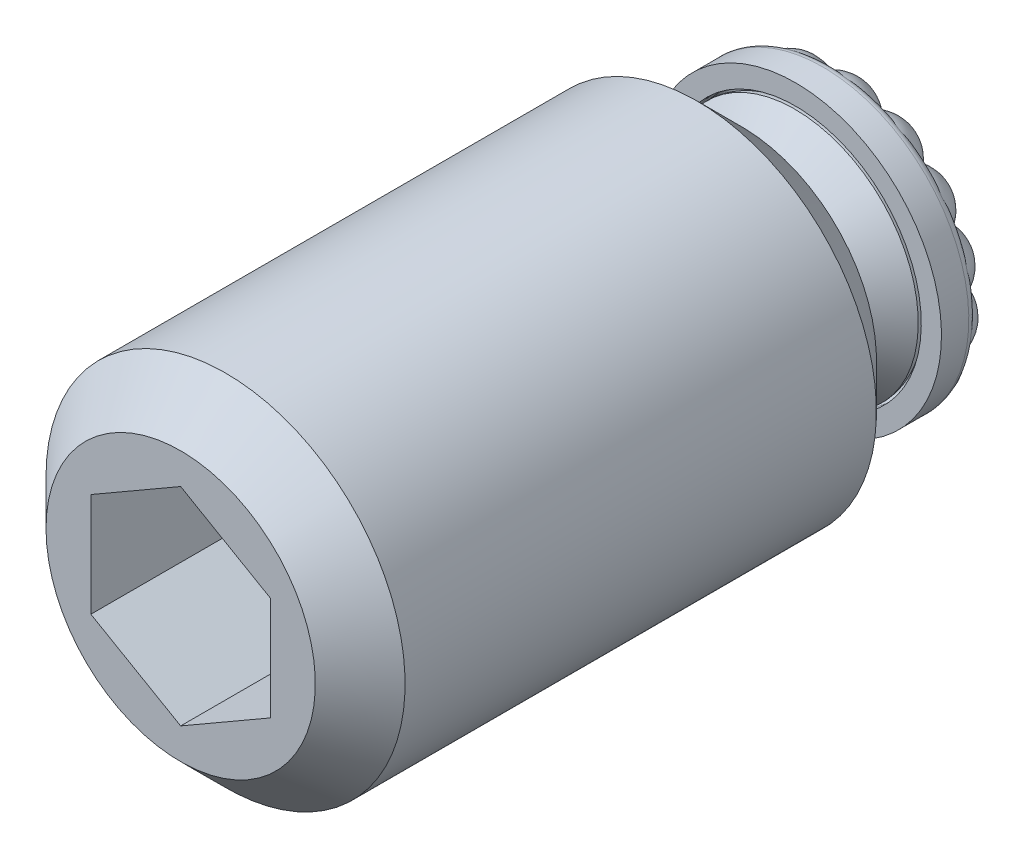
ISO-10303-21;
HEADER;
FILE_DESCRIPTION(('STEP AP214'),'2;1');
FILE_NAME('part.step','',(''),(''),'','','');
FILE_SCHEMA(('AUTOMOTIVE_DESIGN { 1 0 10303 214 1 1 1 1 }'));
ENDSEC;
DATA;
#1=APPLICATION_CONTEXT('core data for automotive mechanical design processes');
#2=APPLICATION_PROTOCOL_DEFINITION('international standard','automotive_design',2000,#1);
#3=PRODUCT_CONTEXT('',#1,'mechanical');
#4=PRODUCT('Part','Part','',(#3));
#5=PRODUCT_RELATED_PRODUCT_CATEGORY('part','',(#4));
#6=PRODUCT_DEFINITION_FORMATION('','',#4);
#7=PRODUCT_DEFINITION_CONTEXT('part definition',#1,'design');
#8=PRODUCT_DEFINITION('design','',#6,#7);
#9=PRODUCT_DEFINITION_SHAPE('','',#8);
#10=(LENGTH_UNIT() NAMED_UNIT(*) SI_UNIT(.MILLI.,.METRE.));
#11=(NAMED_UNIT(*) PLANE_ANGLE_UNIT() SI_UNIT($,.RADIAN.));
#12=(NAMED_UNIT(*) SI_UNIT($,.STERADIAN.) SOLID_ANGLE_UNIT());
#13=UNCERTAINTY_MEASURE_WITH_UNIT(LENGTH_MEASURE(1.E-05),#10,'distance_accuracy_value','');
#14=(GEOMETRIC_REPRESENTATION_CONTEXT(3) GLOBAL_UNCERTAINTY_ASSIGNED_CONTEXT((#13)) GLOBAL_UNIT_ASSIGNED_CONTEXT((#10,
#11,#12)) REPRESENTATION_CONTEXT('',''));
#15=CARTESIAN_POINT('',(0.,0.,0.));
#16=DIRECTION('',(0.,0.,1.));
#17=DIRECTION('',(1.,0.,0.));
#18=AXIS2_PLACEMENT_3D('',#15,#16,#17);
#19=CARTESIAN_POINT('',(0.,0.,5.));
#20=DIRECTION('',(0.,0.,-1.));
#21=DIRECTION('',(-1.,0.,0.));
#22=AXIS2_PLACEMENT_3D('',#19,#20,#21);
#23=PLANE('',#22);
#24=CARTESIAN_POINT('',(0.,0.,5.));
#25=DIRECTION('',(0.,0.,-1.));
#26=DIRECTION('',(-1.,0.,0.));
#27=AXIS2_PLACEMENT_3D('',#24,#25,#26);
#28=CIRCLE('',#27,6.);
#29=CARTESIAN_POINT('',(-6.,0.,5.));
#30=VERTEX_POINT('',#29);
#31=EDGE_CURVE('E85',#30,#30,#28,.T.);
#32=ORIENTED_EDGE('',*,*,#31,.T.);
#33=EDGE_LOOP('',(#32));
#34=FACE_BOUND('',#33,.T.);
#35=CARTESIAN_POINT('',(0.,0.,5.));
#36=DIRECTION('',(0.,0.,-1.));
#37=DIRECTION('',(-1.,0.,0.));
#38=AXIS2_PLACEMENT_3D('',#35,#36,#37);
#39=CIRCLE('',#38,4.);
#40=CARTESIAN_POINT('',(-4.,0.,5.));
#41=VERTEX_POINT('',#40);
#42=EDGE_CURVE('E9',#41,#41,#39,.T.);
#43=ORIENTED_EDGE('',*,*,#42,.F.);
#44=EDGE_LOOP('',(#43));
#45=FACE_BOUND('',#44,.T.);
#46=ADVANCED_FACE('F14',(#34,#45),#23,.T.);
#47=CARTESIAN_POINT('',(0.,0.,30.));
#48=DIRECTION('',(0.,0.,-1.));
#49=DIRECTION('',(-1.,0.,0.));
#50=AXIS2_PLACEMENT_3D('',#47,#48,#49);
#51=CYLINDRICAL_SURFACE('',#50,8.);
#52=CARTESIAN_POINT('',(0.,0.,7.));
#53=DIRECTION('',(0.,0.,-1.));
#54=DIRECTION('',(-1.,0.,0.));
#55=AXIS2_PLACEMENT_3D('',#52,#53,#54);
#56=CIRCLE('',#55,8.);
#57=CARTESIAN_POINT('',(-8.,0.,7.));
#58=VERTEX_POINT('',#57);
#59=EDGE_CURVE('E127',#58,#58,#56,.F.);
#60=ORIENTED_EDGE('',*,*,#59,.T.);
#61=EDGE_LOOP('',(#60));
#62=FACE_BOUND('',#61,.T.);
#63=CARTESIAN_POINT('',(0.,0.,28.));
#64=DIRECTION('',(0.,0.,-1.));
#65=DIRECTION('',(-1.,0.,0.));
#66=AXIS2_PLACEMENT_3D('',#63,#64,#65);
#67=CIRCLE('',#66,8.);
#68=CARTESIAN_POINT('',(-8.,0.,28.));
#69=VERTEX_POINT('',#68);
#70=EDGE_CURVE('E125',#69,#69,#67,.T.);
#71=ORIENTED_EDGE('',*,*,#70,.T.);
#72=EDGE_LOOP('',(#71));
#73=FACE_BOUND('',#72,.T.);
#74=ADVANCED_FACE('F988',(#62,#73),#51,.T.);
#75=CARTESIAN_POINT('',(0.,0.,30.));
#76=DIRECTION('',(0.,0.,-1.));
#77=DIRECTION('',(-1.,0.,0.));
#78=AXIS2_PLACEMENT_3D('',#75,#76,#77);
#79=PLANE('',#78);
#80=CARTESIAN_POINT('',(0.,0.,30.));
#81=DIRECTION('',(0.,0.,-1.));
#82=DIRECTION('',(-1.,0.,0.));
#83=AXIS2_PLACEMENT_3D('',#80,#81,#82);
#84=CIRCLE('',#83,6.);
#85=CARTESIAN_POINT('',(-6.,0.,30.));
#86=VERTEX_POINT('',#85);
#87=EDGE_CURVE('E18',#86,#86,#84,.F.);
#88=ORIENTED_EDGE('',*,*,#87,.T.);
#89=EDGE_LOOP('',(#88));
#90=FACE_BOUND('',#89,.T.);
#91=DIRECTION('',(-0.866025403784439,-0.5,0.));
#92=VECTOR('',#91,1.);
#93=CARTESIAN_POINT('',(0.,4.61880215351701,30.));
#94=LINE('',#93,#92);
#95=CARTESIAN_POINT('',(0.,4.61880215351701,30.));
#96=VERTEX_POINT('',#95);
#97=CARTESIAN_POINT('',(-4.,2.30940107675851,30.));
#98=VERTEX_POINT('',#97);
#99=EDGE_CURVE('E100',#96,#98,#94,.T.);
#100=ORIENTED_EDGE('',*,*,#99,.F.);
#101=DIRECTION('',(-0.866025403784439,0.5,0.));
#102=VECTOR('',#101,1.);
#103=CARTESIAN_POINT('',(4.,2.30940107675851,30.));
#104=LINE('',#103,#102);
#105=CARTESIAN_POINT('',(4.,2.30940107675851,30.));
#106=VERTEX_POINT('',#105);
#107=EDGE_CURVE('E78',#106,#96,#104,.T.);
#108=ORIENTED_EDGE('',*,*,#107,.F.);
#109=DIRECTION('',(0.,1.,0.));
#110=VECTOR('',#109,1.);
#111=CARTESIAN_POINT('',(4.,-2.30940107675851,30.));
#112=LINE('',#111,#110);
#113=CARTESIAN_POINT('',(4.,-2.30940107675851,30.));
#114=VERTEX_POINT('',#113);
#115=EDGE_CURVE('E89',#114,#106,#112,.T.);
#116=ORIENTED_EDGE('',*,*,#115,.F.);
#117=DIRECTION('',(0.866025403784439,0.5,0.));
#118=VECTOR('',#117,1.);
#119=CARTESIAN_POINT('',(0.,-4.61880215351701,30.));
#120=LINE('',#119,#118);
#121=CARTESIAN_POINT('',(0.,-4.61880215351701,30.));
#122=VERTEX_POINT('',#121);
#123=EDGE_CURVE('E94',#122,#114,#120,.T.);
#124=ORIENTED_EDGE('',*,*,#123,.F.);
#125=DIRECTION('',(0.866025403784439,-0.5,0.));
#126=VECTOR('',#125,1.);
#127=CARTESIAN_POINT('',(-4.,-2.30940107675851,30.));
#128=LINE('',#127,#126);
#129=CARTESIAN_POINT('',(-4.,-2.30940107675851,30.));
#130=VERTEX_POINT('',#129);
#131=EDGE_CURVE('E110',#130,#122,#128,.T.);
#132=ORIENTED_EDGE('',*,*,#131,.F.);
#133=DIRECTION('',(0.,-1.,0.));
#134=VECTOR('',#133,1.);
#135=CARTESIAN_POINT('',(-4.,2.30940107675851,30.));
#136=LINE('',#135,#134);
#137=EDGE_CURVE('E102',#98,#130,#136,.T.);
#138=ORIENTED_EDGE('',*,*,#137,.F.);
#139=EDGE_LOOP('',(#100,#108,#116,#124,#132,#138));
#140=FACE_BOUND('',#139,.T.);
#141=ADVANCED_FACE('F97',(#90,#140),#79,.F.);
#142=CARTESIAN_POINT('',(4.,2.30940107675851,20.4));
#143=DIRECTION('',(0.5,0.866025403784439,0.));
#144=DIRECTION('',(0.866025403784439,-0.5,0.));
#145=AXIS2_PLACEMENT_3D('',#142,#143,#144);
#146=PLANE('',#145);
#147=ORIENTED_EDGE('',*,*,#107,.T.);
#148=DIRECTION('',(0.,0.,1.));
#149=VECTOR('',#148,1.);
#150=CARTESIAN_POINT('',(0.,4.61880215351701,20.4));
#151=LINE('',#150,#149);
#152=CARTESIAN_POINT('',(0.,4.61880215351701,20.4));
#153=VERTEX_POINT('',#152);
#154=EDGE_CURVE('E121',#153,#96,#151,.T.);
#155=ORIENTED_EDGE('',*,*,#154,.F.);
#156=DIRECTION('',(-0.866025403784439,0.5,0.));
#157=VECTOR('',#156,1.);
#158=CARTESIAN_POINT('',(4.,2.30940107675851,20.4));
#159=LINE('',#158,#157);
#160=CARTESIAN_POINT('',(4.,2.30940107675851,20.4));
#161=VERTEX_POINT('',#160);
#162=EDGE_CURVE('E81',#161,#153,#159,.T.);
#163=ORIENTED_EDGE('',*,*,#162,.F.);
#164=DIRECTION('',(0.,0.,1.));
#165=VECTOR('',#164,1.);
#166=CARTESIAN_POINT('',(4.,2.30940107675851,20.4));
#167=LINE('',#166,#165);
#168=EDGE_CURVE('E74',#161,#106,#167,.T.);
#169=ORIENTED_EDGE('',*,*,#168,.T.);
#170=EDGE_LOOP('',(#147,#155,#163,#169));
#171=FACE_BOUND('',#170,.T.);
#172=ADVANCED_FACE('F76',(#171),#146,.F.);
#173=CARTESIAN_POINT('',(4.,-2.30940107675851,20.4));
#174=DIRECTION('',(1.,0.,0.));
#175=DIRECTION('',(0.,0.,-1.));
#176=AXIS2_PLACEMENT_3D('',#173,#174,#175);
#177=PLANE('',#176);
#178=ORIENTED_EDGE('',*,*,#115,.T.);
#179=ORIENTED_EDGE('',*,*,#168,.F.);
#180=DIRECTION('',(0.,1.,0.));
#181=VECTOR('',#180,1.);
#182=CARTESIAN_POINT('',(4.,-2.30940107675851,20.4));
#183=LINE('',#182,#181);
#184=CARTESIAN_POINT('',(4.,-2.30940107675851,20.4));
#185=VERTEX_POINT('',#184);
#186=EDGE_CURVE('E105',#185,#161,#183,.T.);
#187=ORIENTED_EDGE('',*,*,#186,.F.);
#188=DIRECTION('',(0.,0.,1.));
#189=VECTOR('',#188,1.);
#190=CARTESIAN_POINT('',(4.,-2.30940107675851,20.4));
#191=LINE('',#190,#189);
#192=EDGE_CURVE('E86',#185,#114,#191,.T.);
#193=ORIENTED_EDGE('',*,*,#192,.T.);
#194=EDGE_LOOP('',(#178,#179,#187,#193));
#195=FACE_BOUND('',#194,.T.);
#196=ADVANCED_FACE('F90',(#195),#177,.F.);
#197=CARTESIAN_POINT('',(0.,-4.61880215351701,20.4));
#198=DIRECTION('',(0.5,-0.866025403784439,0.));
#199=DIRECTION('',(-0.866025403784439,-0.5,0.));
#200=AXIS2_PLACEMENT_3D('',#197,#198,#199);
#201=PLANE('',#200);
#202=ORIENTED_EDGE('',*,*,#123,.T.);
#203=ORIENTED_EDGE('',*,*,#192,.F.);
#204=DIRECTION('',(0.866025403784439,0.5,0.));
#205=VECTOR('',#204,1.);
#206=CARTESIAN_POINT('',(0.,-4.61880215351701,20.4));
#207=LINE('',#206,#205);
#208=CARTESIAN_POINT('',(0.,-4.61880215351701,20.4));
#209=VERTEX_POINT('',#208);
#210=EDGE_CURVE('E954',#209,#185,#207,.T.);
#211=ORIENTED_EDGE('',*,*,#210,.F.);
#212=DIRECTION('',(0.,0.,1.));
#213=VECTOR('',#212,1.);
#214=CARTESIAN_POINT('',(0.,-4.61880215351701,20.4));
#215=LINE('',#214,#213);
#216=EDGE_CURVE('E115',#209,#122,#215,.T.);
#217=ORIENTED_EDGE('',*,*,#216,.T.);
#218=EDGE_LOOP('',(#202,#203,#211,#217));
#219=FACE_BOUND('',#218,.T.);
#220=ADVANCED_FACE('F970',(#219),#201,.F.);
#221=CARTESIAN_POINT('',(-4.,-2.30940107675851,20.4));
#222=DIRECTION('',(-0.5,-0.866025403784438,0.));
#223=DIRECTION('',(-0.866025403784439,0.5,0.));
#224=AXIS2_PLACEMENT_3D('',#221,#222,#223);
#225=PLANE('',#224);
#226=ORIENTED_EDGE('',*,*,#131,.T.);
#227=ORIENTED_EDGE('',*,*,#216,.F.);
#228=DIRECTION('',(0.866025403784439,-0.5,0.));
#229=VECTOR('',#228,1.);
#230=CARTESIAN_POINT('',(-4.,-2.30940107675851,20.4));
#231=LINE('',#230,#229);
#232=CARTESIAN_POINT('',(-4.,-2.30940107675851,20.4));
#233=VERTEX_POINT('',#232);
#234=EDGE_CURVE('E952',#233,#209,#231,.T.);
#235=ORIENTED_EDGE('',*,*,#234,.F.);
#236=DIRECTION('',(0.,0.,1.));
#237=VECTOR('',#236,1.);
#238=CARTESIAN_POINT('',(-4.,-2.30940107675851,20.4));
#239=LINE('',#238,#237);
#240=EDGE_CURVE('E117',#233,#130,#239,.T.);
#241=ORIENTED_EDGE('',*,*,#240,.T.);
#242=EDGE_LOOP('',(#226,#227,#235,#241));
#243=FACE_BOUND('',#242,.T.);
#244=ADVANCED_FACE('F968',(#243),#225,.F.);
#245=CARTESIAN_POINT('',(-4.,2.30940107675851,20.4));
#246=DIRECTION('',(-1.,0.,0.));
#247=DIRECTION('',(0.,1.,0.));
#248=AXIS2_PLACEMENT_3D('',#245,#246,#247);
#249=PLANE('',#248);
#250=ORIENTED_EDGE('',*,*,#137,.T.);
#251=ORIENTED_EDGE('',*,*,#240,.F.);
#252=DIRECTION('',(0.,-1.,0.));
#253=VECTOR('',#252,1.);
#254=CARTESIAN_POINT('',(-4.,2.30940107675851,20.4));
#255=LINE('',#254,#253);
#256=CARTESIAN_POINT('',(-4.,2.30940107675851,20.4));
#257=VERTEX_POINT('',#256);
#258=EDGE_CURVE('E949',#257,#233,#255,.T.);
#259=ORIENTED_EDGE('',*,*,#258,.F.);
#260=DIRECTION('',(0.,0.,1.));
#261=VECTOR('',#260,1.);
#262=CARTESIAN_POINT('',(-4.,2.30940107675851,20.4));
#263=LINE('',#262,#261);
#264=EDGE_CURVE('E119',#257,#98,#263,.T.);
#265=ORIENTED_EDGE('',*,*,#264,.T.);
#266=EDGE_LOOP('',(#250,#251,#259,#265));
#267=FACE_BOUND('',#266,.T.);
#268=ADVANCED_FACE('F964',(#267),#249,.F.);
#269=CARTESIAN_POINT('',(0.,4.61880215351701,20.4));
#270=DIRECTION('',(-0.5,0.866025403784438,0.));
#271=DIRECTION('',(0.866025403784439,0.5,0.));
#272=AXIS2_PLACEMENT_3D('',#269,#270,#271);
#273=PLANE('',#272);
#274=ORIENTED_EDGE('',*,*,#99,.T.);
#275=ORIENTED_EDGE('',*,*,#264,.F.);
#276=DIRECTION('',(-0.866025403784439,-0.5,0.));
#277=VECTOR('',#276,1.);
#278=CARTESIAN_POINT('',(0.,4.61880215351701,20.4));
#279=LINE('',#278,#277);
#280=EDGE_CURVE('E946',#153,#257,#279,.T.);
#281=ORIENTED_EDGE('',*,*,#280,.F.);
#282=ORIENTED_EDGE('',*,*,#154,.T.);
#283=EDGE_LOOP('',(#274,#275,#281,#282));
#284=FACE_BOUND('',#283,.T.);
#285=ADVANCED_FACE('F962',(#284),#273,.F.);
#286=CARTESIAN_POINT('',(0.,4.61880215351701,20.4));
#287=DIRECTION('',(0.,0.,1.));
#288=DIRECTION('',(1.,0.,0.));
#289=AXIS2_PLACEMENT_3D('',#286,#287,#288);
#290=PLANE('',#289);
#291=ORIENTED_EDGE('',*,*,#162,.T.);
#292=ORIENTED_EDGE('',*,*,#280,.T.);
#293=ORIENTED_EDGE('',*,*,#258,.T.);
#294=ORIENTED_EDGE('',*,*,#234,.T.);
#295=ORIENTED_EDGE('',*,*,#210,.T.);
#296=ORIENTED_EDGE('',*,*,#186,.T.);
#297=EDGE_LOOP('',(#291,#292,#293,#294,#295,#296));
#298=FACE_BOUND('',#297,.T.);
#299=ADVANCED_FACE('F958',(#298),#290,.T.);
#300=CARTESIAN_POINT('',(0.,0.,5.));
#301=DIRECTION('',(0.,0.,1.));
#302=DIRECTION('',(1.,0.,0.));
#303=AXIS2_PLACEMENT_3D('',#300,#301,#302);
#304=CONICAL_SURFACE('',#303,6.,0.785398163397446);
#305=ORIENTED_EDGE('',*,*,#59,.F.);
#306=EDGE_LOOP('',(#305));
#307=FACE_BOUND('',#306,.T.);
#308=ORIENTED_EDGE('',*,*,#31,.F.);
#309=EDGE_LOOP('',(#308));
#310=FACE_BOUND('',#309,.T.);
#311=ADVANCED_FACE('F994',(#307,#310),#304,.T.);
#312=CARTESIAN_POINT('',(0.,0.,28.));
#313=DIRECTION('',(0.,0.,-1.));
#314=DIRECTION('',(-1.,0.,0.));
#315=AXIS2_PLACEMENT_3D('',#312,#313,#314);
#316=CONICAL_SURFACE('',#315,8.,0.785398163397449);
#317=ORIENTED_EDGE('',*,*,#87,.F.);
#318=EDGE_LOOP('',(#317));
#319=FACE_BOUND('',#318,.T.);
#320=ORIENTED_EDGE('',*,*,#70,.F.);
#321=EDGE_LOOP('',(#320));
#322=FACE_BOUND('',#321,.T.);
#323=ADVANCED_FACE('F16',(#319,#322),#316,.T.);
#324=CARTESIAN_POINT('',(0.,0.,4.24147025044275));
#325=DIRECTION('',(0.,0.,-1.));
#326=DIRECTION('',(-0.965048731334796,-0.262070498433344,0.));
#327=AXIS2_PLACEMENT_3D('',#324,#325,#326);
#328=TOROIDAL_SURFACE('',#327,4.254,0.254);
#329=CARTESIAN_POINT('',(0.,0.,4.24147025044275));
#330=DIRECTION('',(0.,0.,-1.));
#331=DIRECTION('',(-0.965048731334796,-0.262070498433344,0.));
#332=AXIS2_PLACEMENT_3D('',#329,#330,#331);
#333=CIRCLE('',#332,4.);
#334=CARTESIAN_POINT('',(-3.86019492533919,-1.04828199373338,4.24147025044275));
#335=VERTEX_POINT('',#334);
#336=EDGE_CURVE('E1015',#335,#335,#333,.F.);
#337=ORIENTED_EDGE('',*,*,#336,.F.);
#338=EDGE_LOOP('',(#337));
#339=FACE_BOUND('',#338,.T.);
#340=CARTESIAN_POINT('',(0.,0.,4.06186512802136));
#341=DIRECTION('',(0.,0.,-1.));
#342=DIRECTION('',(-0.965048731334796,-0.262070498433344,0.));
#343=AXIS2_PLACEMENT_3D('',#340,#341,#342);
#344=CIRCLE('',#343,4.07439487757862);
#345=CARTESIAN_POINT('',(-3.93198960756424,-1.06777869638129,4.06186512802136));
#346=VERTEX_POINT('',#345);
#347=EDGE_CURVE('E24',#346,#346,#344,.T.);
#348=ORIENTED_EDGE('',*,*,#347,.F.);
#349=EDGE_LOOP('',(#348));
#350=FACE_BOUND('',#349,.T.);
#351=ADVANCED_FACE('F1001',(#339,#350),#328,.F.);
#352=CARTESIAN_POINT('',(0.,0.,2.0012600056));
#353=DIRECTION('',(0.,0.,-1.));
#354=DIRECTION('',(-0.965048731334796,-0.262070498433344,0.));
#355=AXIS2_PLACEMENT_3D('',#352,#353,#354);
#356=CYLINDRICAL_SURFACE('',#355,4.);
#357=ORIENTED_EDGE('',*,*,#42,.T.);
#358=EDGE_LOOP('',(#357));
#359=FACE_BOUND('',#358,.T.);
#360=ORIENTED_EDGE('',*,*,#336,.T.);
#361=EDGE_LOOP('',(#360));
#362=FACE_BOUND('',#361,.T.);
#363=ADVANCED_FACE('F1008',(#359,#362),#356,.T.);
#364=CARTESIAN_POINT('',(0.,0.,4.1362600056));
#365=DIRECTION('',(0.,0.,-1.));
#366=DIRECTION('',(-0.965048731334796,-0.262070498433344,0.));
#367=AXIS2_PLACEMENT_3D('',#364,#365,#366);
#368=CONICAL_SURFACE('',#367,4.,0.78539816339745);
#369=ORIENTED_EDGE('',*,*,#347,.T.);
#370=EDGE_LOOP('',(#369));
#371=FACE_BOUND('',#370,.T.);
#372=CARTESIAN_POINT('',(0.,0.,2.6362600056));
#373=DIRECTION('',(0.,0.,-1.));
#374=DIRECTION('',(-0.965048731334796,-0.262070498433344,0.));
#375=AXIS2_PLACEMENT_3D('',#372,#373,#374);
#376=CIRCLE('',#375,5.5);
#377=CARTESIAN_POINT('',(-5.30776802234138,-1.44138774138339,2.6362600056));
#378=VERTEX_POINT('',#377);
#379=EDGE_CURVE('E944',#378,#378,#376,.T.);
#380=ORIENTED_EDGE('',*,*,#379,.F.);
#381=EDGE_LOOP('',(#380));
#382=FACE_BOUND('',#381,.T.);
#383=ADVANCED_FACE('F1011',(#371,#382),#368,.T.);
#384=CARTESIAN_POINT('',(0.,0.,2.6362600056));
#385=DIRECTION('',(0.,0.,1.));
#386=DIRECTION('',(0.965048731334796,0.262070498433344,0.));
#387=AXIS2_PLACEMENT_3D('',#384,#385,#386);
#388=TOROIDAL_SURFACE('',#387,4.865,0.635);
#389=ORIENTED_EDGE('',*,*,#379,.T.);
#390=EDGE_LOOP('',(#389));
#391=FACE_BOUND('',#390,.T.);
#392=CARTESIAN_POINT('',(0.,0.,2.0012600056));
#393=DIRECTION('',(0.,0.,1.));
#394=DIRECTION('',(0.965048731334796,0.262070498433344,0.));
#395=AXIS2_PLACEMENT_3D('',#392,#393,#394);
#396=CIRCLE('',#395,4.865);
#397=CARTESIAN_POINT('',(4.69496207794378,1.27497297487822,2.0012600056));
#398=VERTEX_POINT('',#397);
#399=EDGE_CURVE('E1017',#398,#398,#396,.F.);
#400=ORIENTED_EDGE('',*,*,#399,.F.);
#401=EDGE_LOOP('',(#400));
#402=FACE_BOUND('',#401,.T.);
#403=ADVANCED_FACE('F992',(#391,#402),#388,.T.);
#404=CARTESIAN_POINT('',(0.,0.,3.1762600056));
#405=DIRECTION('',(0.,0.,1.));
#406=DIRECTION('',(0.965048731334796,0.262070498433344,0.));
#407=AXIS2_PLACEMENT_3D('',#404,#405,#406);
#408=SPHERICAL_SURFACE('',#407,3.175);
#409=CARTESIAN_POINT('',(-0.665659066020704,2.45122377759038,1.9062600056));
#410=DIRECTION('',(0.234402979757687,-0.863165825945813,0.447213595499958));
#411=DIRECTION('',(0.117201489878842,-0.431582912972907,-0.894427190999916));
#412=AXIS2_PLACEMENT_3D('',#409,#410,#411);
#413=CIRCLE('',#412,1.41990316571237);
#414=CARTESIAN_POINT('',(-1.34217961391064,1.73701894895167,0.882367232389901));
#415=VERTEX_POINT('',#414);
#416=CARTESIAN_POINT('',(0.279193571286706,2.17732218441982,0.882367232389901));
#417=VERTEX_POINT('',#416);
#418=EDGE_CURVE('E154',#415,#417,#413,.T.);
#419=ORIENTED_EDGE('',*,*,#418,.T.);
#420=CARTESIAN_POINT('',(1.26258491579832,2.20396899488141,1.9062600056));
#421=DIRECTION('',(-0.44460247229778,-0.776098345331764,0.447213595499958));
#422=DIRECTION('',(0.867704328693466,-0.497080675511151,0.));
#423=AXIS2_PLACEMENT_3D('',#420,#421,#422);
#424=CIRCLE('',#423,1.41990316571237);
#425=CARTESIAN_POINT('',(1.73701894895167,1.34217961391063,0.882367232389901));
#426=VERTEX_POINT('',#425);
#427=EDGE_CURVE('E158',#417,#426,#424,.T.);
#428=ORIENTED_EDGE('',*,*,#427,.T.);
#429=CARTESIAN_POINT('',(2.45122377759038,0.665659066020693,1.9062600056));
#430=DIRECTION('',(-0.863165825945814,-0.234402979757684,0.447213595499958));
#431=DIRECTION('',(0.431582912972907,0.117201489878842,0.894427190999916));
#432=AXIS2_PLACEMENT_3D('',#429,#430,#431);
#433=CIRCLE('',#432,1.41990316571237);
#434=CARTESIAN_POINT('',(2.1773221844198,-0.279193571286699,0.882367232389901));
#435=VERTEX_POINT('',#434);
#436=EDGE_CURVE('E33',#426,#435,#433,.T.);
#437=ORIENTED_EDGE('',*,*,#436,.T.);
#438=CARTESIAN_POINT('',(2.20396899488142,-1.2625849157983,1.9062600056));
#439=DIRECTION('',(-0.776098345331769,0.444602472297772,0.447213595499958));
#440=DIRECTION('',(-0.497080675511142,-0.867704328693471,0.));
#441=AXIS2_PLACEMENT_3D('',#438,#439,#440);
#442=CIRCLE('',#441,1.41990316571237);
#443=CARTESIAN_POINT('',(1.34217961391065,-1.73701894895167,0.882367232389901));
#444=VERTEX_POINT('',#443);
#445=EDGE_CURVE('E132',#435,#444,#442,.T.);
#446=ORIENTED_EDGE('',*,*,#445,.T.);
#447=CARTESIAN_POINT('',(0.665659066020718,-2.45122377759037,1.9062600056));
#448=DIRECTION('',(-0.234402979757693,0.863165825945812,0.447213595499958));
#449=DIRECTION('',(0.117201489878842,-0.431582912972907,0.894427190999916));
#450=AXIS2_PLACEMENT_3D('',#447,#448,#449);
#451=CIRCLE('',#450,1.41990316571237);
#452=CARTESIAN_POINT('',(-0.279193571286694,-2.17732218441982,0.882367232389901));
#453=VERTEX_POINT('',#452);
#454=EDGE_CURVE('E136',#444,#453,#451,.T.);
#455=ORIENTED_EDGE('',*,*,#454,.T.);
#456=CARTESIAN_POINT('',(-1.26258491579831,-2.20396899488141,1.9062600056));
#457=DIRECTION('',(0.444602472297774,0.776098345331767,0.447213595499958));
#458=DIRECTION('',(-0.867704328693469,0.497080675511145,0.));
#459=AXIS2_PLACEMENT_3D('',#456,#457,#458);
#460=CIRCLE('',#459,1.41990316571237);
#461=CARTESIAN_POINT('',(-1.73701894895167,-1.34217961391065,0.882367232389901));
#462=VERTEX_POINT('',#461);
#463=EDGE_CURVE('E142',#453,#462,#460,.T.);
#464=ORIENTED_EDGE('',*,*,#463,.T.);
#465=CARTESIAN_POINT('',(-2.45122377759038,-0.665659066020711,1.9062600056));
#466=DIRECTION('',(0.863165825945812,0.23440297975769,0.447213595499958));
#467=DIRECTION('',(0.431582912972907,0.117201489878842,-0.894427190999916));
#468=AXIS2_PLACEMENT_3D('',#465,#466,#467);
#469=CIRCLE('',#468,1.41990316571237);
#470=CARTESIAN_POINT('',(-2.17732218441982,0.279193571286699,0.882367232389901));
#471=VERTEX_POINT('',#470);
#472=EDGE_CURVE('E148',#462,#471,#469,.T.);
#473=ORIENTED_EDGE('',*,*,#472,.T.);
#474=CARTESIAN_POINT('',(-2.20396899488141,1.26258491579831,1.9062600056));
#475=DIRECTION('',(0.776098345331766,-0.444602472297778,0.447213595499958));
#476=DIRECTION('',(0.497080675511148,0.867704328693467,0.));
#477=AXIS2_PLACEMENT_3D('',#474,#475,#476);
#478=CIRCLE('',#477,1.41990316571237);
#479=EDGE_CURVE('E151',#471,#415,#478,.T.);
#480=ORIENTED_EDGE('',*,*,#479,.T.);
#481=EDGE_LOOP('',(#419,#428,#437,#446,#455,#464,#473,#480));
#482=FACE_BOUND('',#481,.T.);
#483=ADVANCED_FACE('F193',(#482),#408,.T.);
#484=CARTESIAN_POINT('',(2.75496124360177,-1.57823114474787,1.5887600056));
#485=DIRECTION('',(0.,0.,-1.));
#486=DIRECTION('',(-0.867704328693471,0.497080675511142,0.));
#487=AXIS2_PLACEMENT_3D('',#484,#485,#486);
#488=SPHERICAL_SURFACE('',#487,1.5875);
#489=ORIENTED_EDGE('',*,*,#445,.F.);
#490=CARTESIAN_POINT('',(2.90949548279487,-0.373078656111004,1.5887600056));
#491=DIRECTION('',(-0.127186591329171,-0.991878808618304,0.));
#492=DIRECTION('',(0.991878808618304,-0.127186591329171,0.));
#493=AXIS2_PLACEMENT_3D('',#490,#491,#492);
#494=CIRCLE('',#493,1.02170587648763);
#495=CARTESIAN_POINT('',(3.52112857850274,-0.451507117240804,0.774120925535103));
#496=VERTEX_POINT('',#495);
#497=EDGE_CURVE('E487',#435,#496,#494,.T.);
#498=ORIENTED_EDGE('',*,*,#497,.T.);
#499=CARTESIAN_POINT('',(3.81378294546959,-1.10151763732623,1.5887600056));
#500=DIRECTION('',(0.911842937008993,0.410539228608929,0.));
#501=DIRECTION('',(-0.410539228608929,0.911842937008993,0.));
#502=AXIS2_PLACEMENT_3D('',#499,#500,#501);
#503=CIRCLE('',#502,1.08249576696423);
#504=CARTESIAN_POINT('',(3.9086071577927,-1.31213036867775,0.531193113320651));
#505=VERTEX_POINT('',#504);
#506=EDGE_CURVE('E465',#496,#505,#503,.F.);
#507=ORIENTED_EDGE('',*,*,#506,.T.);
#508=CARTESIAN_POINT('',(3.50877937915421,-2.01006998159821,1.5887600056));
#509=DIRECTION('',(0.867704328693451,-0.497080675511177,0.));
#510=DIRECTION('',(0.497080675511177,0.867704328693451,0.));
#511=AXIS2_PLACEMENT_3D('',#508,#509,#510);
#512=CIRCLE('',#511,1.32869473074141);
#513=CARTESIAN_POINT('',(3.10895160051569,-2.70800959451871,0.531193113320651));
#514=VERTEX_POINT('',#513);
#515=EDGE_CURVE('E430',#505,#514,#512,.F.);
#516=ORIENTED_EDGE('',*,*,#515,.T.);
#517=CARTESIAN_POINT('',(2.87930489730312,-2.73274308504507,1.5887600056));
#518=DIRECTION('',(0.107083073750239,-0.994250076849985,0.));
#519=DIRECTION('',(0.994250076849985,0.107083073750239,0.));
#520=AXIS2_PLACEMENT_3D('',#517,#518,#519);
#521=CIRCLE('',#520,1.08249576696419);
#522=CARTESIAN_POINT('',(2.17055015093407,-2.80907763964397,0.774120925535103));
#523=VERTEX_POINT('',#522);
#524=EDGE_CURVE('E413',#514,#523,#521,.F.);
#525=ORIENTED_EDGE('',*,*,#524,.T.);
#526=CARTESIAN_POINT('',(1.79351753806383,-2.32113043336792,1.5887600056));
#527=DIRECTION('',(0.791298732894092,0.611429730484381,0.));
#528=DIRECTION('',(-0.611429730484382,0.791298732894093,0.));
#529=AXIS2_PLACEMENT_3D('',#526,#527,#528);
#530=CIRCLE('',#529,1.02170587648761);
#531=EDGE_CURVE('E894',#523,#444,#530,.T.);
#532=ORIENTED_EDGE('',*,*,#531,.T.);
#533=EDGE_LOOP('',(#489,#498,#507,#516,#525,#532));
#534=FACE_BOUND('',#533,.T.);
#535=ADVANCED_FACE('F445',(#534),#488,.T.);
#536=CARTESIAN_POINT('',(0.832073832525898,-3.06402972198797,1.5887600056));
#537=DIRECTION('',(0.,0.,-1.));
#538=DIRECTION('',(-0.262070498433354,0.965048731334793,0.));
#539=AXIS2_PLACEMENT_3D('',#536,#537,#538);
#540=SPHERICAL_SURFACE('',#539,1.5875);
#541=ORIENTED_EDGE('',*,*,#454,.F.);
#542=ORIENTED_EDGE('',*,*,#531,.F.);
#543=CARTESIAN_POINT('',(1.91786119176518,-3.47564237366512,1.5887600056));
#544=DIRECTION('',(0.935065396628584,-0.35447525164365,0.));
#545=DIRECTION('',(0.35447525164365,0.935065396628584,0.));
#546=AXIS2_PLACEMENT_3D('',#543,#544,#545);
#547=CIRCLE('',#546,1.08249576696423);
#548=CARTESIAN_POINT('',(1.83598634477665,-3.69161890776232,0.531193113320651));
#549=VERTEX_POINT('',#548);
#550=EDGE_CURVE('E419',#523,#549,#547,.F.);
#551=ORIENTED_EDGE('',*,*,#550,.T.);
#552=CARTESIAN_POINT('',(1.05974757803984,-3.90241580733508,1.5887600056));
#553=DIRECTION('',(0.262070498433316,-0.965048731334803,0.));
#554=DIRECTION('',(0.965048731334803,0.262070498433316,0.));
#555=AXIS2_PLACEMENT_3D('',#552,#553,#554);
#556=CIRCLE('',#555,1.32869473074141);
#557=CARTESIAN_POINT('',(0.283508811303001,-4.11321270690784,0.531193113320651));
#558=VERTEX_POINT('',#557);
#559=EDGE_CURVE('E399',#549,#558,#556,.F.);
#560=ORIENTED_EDGE('',*,*,#559,.T.);
#561=CARTESIAN_POINT('',(0.103634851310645,-3.96831718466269,1.5887600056));
#562=DIRECTION('',(-0.627321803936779,-0.778760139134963,0.));
#563=DIRECTION('',(0.778760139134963,-0.627321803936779,0.));
#564=AXIS2_PLACEMENT_3D('',#561,#562,#563);
#565=CIRCLE('',#564,1.08249576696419);
#566=CARTESIAN_POINT('',(-0.451507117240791,-3.52112857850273,0.774120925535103));
#567=VERTEX_POINT('',#566);
#568=EDGE_CURVE('E369',#558,#567,#565,.F.);
#569=ORIENTED_EDGE('',*,*,#568,.T.);
#570=CARTESIAN_POINT('',(-0.373078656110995,-2.90949548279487,1.5887600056));
#571=DIRECTION('',(0.991878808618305,-0.127186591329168,0.));
#572=DIRECTION('',(0.127186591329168,0.991878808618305,0.));
#573=AXIS2_PLACEMENT_3D('',#570,#571,#572);
#574=CIRCLE('',#573,1.02170587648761);
#575=EDGE_CURVE('E892',#567,#453,#574,.T.);
#576=ORIENTED_EDGE('',*,*,#575,.T.);
#577=EDGE_LOOP('',(#541,#542,#551,#560,#569,#576));
#578=FACE_BOUND('',#577,.T.);
#579=ADVANCED_FACE('F498',(#578),#540,.T.);
#580=CARTESIAN_POINT('',(-1.57823114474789,-2.75496124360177,1.5887600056));
#581=DIRECTION('',(0.,0.,-1.));
#582=DIRECTION('',(0.497080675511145,0.867704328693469,0.));
#583=AXIS2_PLACEMENT_3D('',#580,#581,#582);
#584=SPHERICAL_SURFACE('',#583,1.5875);
#585=ORIENTED_EDGE('',*,*,#463,.F.);
#586=ORIENTED_EDGE('',*,*,#575,.F.);
#587=CARTESIAN_POINT('',(-1.10151763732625,-3.81378294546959,1.5887600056));
#588=DIRECTION('',(0.410539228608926,-0.911842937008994,0.));
#589=DIRECTION('',(0.911842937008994,0.410539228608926,0.));
#590=AXIS2_PLACEMENT_3D('',#587,#588,#589);
#591=CIRCLE('',#590,1.08249576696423);
#592=CARTESIAN_POINT('',(-1.31213036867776,-3.9086071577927,0.531193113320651));
#593=VERTEX_POINT('',#592);
#594=EDGE_CURVE('E398',#567,#593,#591,.F.);
#595=ORIENTED_EDGE('',*,*,#594,.T.);
#596=CARTESIAN_POINT('',(-2.01006998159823,-3.5087793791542,1.5887600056));
#597=DIRECTION('',(-0.497080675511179,-0.86770432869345,0.));
#598=DIRECTION('',(0.86770432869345,-0.497080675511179,0.));
#599=AXIS2_PLACEMENT_3D('',#596,#597,#598);
#600=CIRCLE('',#599,1.32869473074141);
#601=CARTESIAN_POINT('',(-2.70800959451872,-3.10895160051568,0.531193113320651));
#602=VERTEX_POINT('',#601);
#603=EDGE_CURVE('E355',#593,#602,#600,.F.);
#604=ORIENTED_EDGE('',*,*,#603,.T.);
#605=CARTESIAN_POINT('',(-2.73274308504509,-2.87930489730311,1.5887600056));
#606=DIRECTION('',(-0.994250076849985,-0.107083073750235,0.));
#607=DIRECTION('',(0.107083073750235,-0.994250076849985,0.));
#608=AXIS2_PLACEMENT_3D('',#605,#606,#607);
#609=CIRCLE('',#608,1.08249576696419);
#610=CARTESIAN_POINT('',(-2.80907763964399,-2.17055015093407,0.774120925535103));
#611=VERTEX_POINT('',#610);
#612=EDGE_CURVE('E336',#602,#611,#609,.F.);
#613=ORIENTED_EDGE('',*,*,#612,.T.);
#614=CARTESIAN_POINT('',(-2.32113043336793,-1.79351753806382,1.5887600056));
#615=DIRECTION('',(0.611429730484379,-0.791298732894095,0.));
#616=DIRECTION('',(0.791298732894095,0.611429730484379,0.));
#617=AXIS2_PLACEMENT_3D('',#614,#615,#616);
#618=CIRCLE('',#617,1.02170587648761);
#619=EDGE_CURVE('E887',#611,#462,#618,.T.);
#620=ORIENTED_EDGE('',*,*,#619,.T.);
#621=EDGE_LOOP('',(#585,#586,#595,#604,#613,#620));
#622=FACE_BOUND('',#621,.T.);
#623=ADVANCED_FACE('F378',(#622),#584,.T.);
#624=CARTESIAN_POINT('',(-3.06402972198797,-0.832073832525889,1.5887600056));
#625=DIRECTION('',(0.,0.,-1.));
#626=DIRECTION('',(0.965048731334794,0.262070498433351,0.));
#627=AXIS2_PLACEMENT_3D('',#624,#625,#626);
#628=SPHERICAL_SURFACE('',#627,1.5875);
#629=ORIENTED_EDGE('',*,*,#472,.F.);
#630=ORIENTED_EDGE('',*,*,#619,.F.);
#631=CARTESIAN_POINT('',(-3.47564237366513,-1.91786119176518,1.5887600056));
#632=DIRECTION('',(-0.354475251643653,-0.935065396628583,0.));
#633=DIRECTION('',(0.935065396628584,-0.354475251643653,0.));
#634=AXIS2_PLACEMENT_3D('',#631,#632,#633);
#635=CIRCLE('',#634,1.08249576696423);
#636=CARTESIAN_POINT('',(-3.69161890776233,-1.83598634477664,0.531193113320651));
#637=VERTEX_POINT('',#636);
#638=EDGE_CURVE('E344',#611,#637,#635,.F.);
#639=ORIENTED_EDGE('',*,*,#638,.T.);
#640=CARTESIAN_POINT('',(-3.90241580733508,-1.05974757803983,1.5887600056));
#641=DIRECTION('',(-0.965048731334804,-0.262070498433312,0.));
#642=DIRECTION('',(0.262070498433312,-0.965048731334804,0.));
#643=AXIS2_PLACEMENT_3D('',#640,#641,#642);
#644=CIRCLE('',#643,1.32869473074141);
#645=CARTESIAN_POINT('',(-4.11321270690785,-0.28350881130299,0.531193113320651));
#646=VERTEX_POINT('',#645);
#647=EDGE_CURVE('E309',#637,#646,#644,.F.);
#648=ORIENTED_EDGE('',*,*,#647,.T.);
#649=CARTESIAN_POINT('',(-3.96831718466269,-0.103634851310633,1.5887600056));
#650=DIRECTION('',(-0.77876013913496,0.627321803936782,0.));
#651=DIRECTION('',(-0.627321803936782,-0.77876013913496,0.));
#652=AXIS2_PLACEMENT_3D('',#649,#650,#651);
#653=CIRCLE('',#652,1.08249576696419);
#654=CARTESIAN_POINT('',(-3.52112857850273,0.451507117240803,0.774120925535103));
#655=VERTEX_POINT('',#654);
#656=EDGE_CURVE('E292',#646,#655,#653,.F.);
#657=ORIENTED_EDGE('',*,*,#656,.T.);
#658=CARTESIAN_POINT('',(-2.90949548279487,0.373078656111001,1.5887600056));
#659=DIRECTION('',(-0.127186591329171,-0.991878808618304,0.));
#660=DIRECTION('',(0.991878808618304,-0.127186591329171,0.));
#661=AXIS2_PLACEMENT_3D('',#658,#659,#660);
#662=CIRCLE('',#661,1.02170587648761);
#663=EDGE_CURVE('E883',#655,#471,#662,.T.);
#664=ORIENTED_EDGE('',*,*,#663,.T.);
#665=EDGE_LOOP('',(#629,#630,#639,#648,#657,#664));
#666=FACE_BOUND('',#665,.T.);
#667=ADVANCED_FACE('F324',(#666),#628,.T.);
#668=CARTESIAN_POINT('',(-2.75496124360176,1.57823114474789,1.5887600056));
#669=DIRECTION('',(0.,0.,-1.));
#670=DIRECTION('',(0.867704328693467,-0.497080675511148,0.));
#671=AXIS2_PLACEMENT_3D('',#668,#669,#670);
#672=SPHERICAL_SURFACE('',#671,1.5875);
#673=ORIENTED_EDGE('',*,*,#479,.F.);
#674=ORIENTED_EDGE('',*,*,#663,.F.);
#675=CARTESIAN_POINT('',(-3.81378294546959,1.10151763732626,1.5887600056));
#676=DIRECTION('',(-0.911842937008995,-0.410539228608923,0.));
#677=DIRECTION('',(0.410539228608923,-0.911842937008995,0.));
#678=AXIS2_PLACEMENT_3D('',#675,#676,#677);
#679=CIRCLE('',#678,1.08249576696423);
#680=CARTESIAN_POINT('',(-3.9086071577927,1.31213036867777,0.531193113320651));
#681=VERTEX_POINT('',#680);
#682=EDGE_CURVE('E298',#655,#681,#679,.F.);
#683=ORIENTED_EDGE('',*,*,#682,.T.);
#684=CARTESIAN_POINT('',(-3.5087793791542,2.01006998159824,1.5887600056));
#685=DIRECTION('',(-0.867704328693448,0.497080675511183,0.));
#686=DIRECTION('',(-0.497080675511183,-0.867704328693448,0.));
#687=AXIS2_PLACEMENT_3D('',#684,#685,#686);
#688=CIRCLE('',#687,1.32869473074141);
#689=CARTESIAN_POINT('',(-3.10895160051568,2.70800959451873,0.531193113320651));
#690=VERTEX_POINT('',#689);
#691=EDGE_CURVE('E278',#681,#690,#688,.F.);
#692=ORIENTED_EDGE('',*,*,#691,.T.);
#693=CARTESIAN_POINT('',(-2.87930489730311,2.73274308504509,1.5887600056));
#694=DIRECTION('',(-0.107083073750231,0.994250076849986,0.));
#695=DIRECTION('',(-0.994250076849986,-0.107083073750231,0.));
#696=AXIS2_PLACEMENT_3D('',#693,#694,#695);
#697=CIRCLE('',#696,1.08249576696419);
#698=CARTESIAN_POINT('',(-2.17055015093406,2.80907763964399,0.774120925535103));
#699=VERTEX_POINT('',#698);
#700=EDGE_CURVE('E248',#690,#699,#697,.F.);
#701=ORIENTED_EDGE('',*,*,#700,.T.);
#702=CARTESIAN_POINT('',(-1.79351753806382,2.32113043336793,1.5887600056));
#703=DIRECTION('',(-0.791298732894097,-0.611429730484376,0.));
#704=DIRECTION('',(0.611429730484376,-0.791298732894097,0.));
#705=AXIS2_PLACEMENT_3D('',#702,#703,#704);
#706=CIRCLE('',#705,1.02170587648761);
#707=EDGE_CURVE('E876',#699,#415,#706,.T.);
#708=ORIENTED_EDGE('',*,*,#707,.T.);
#709=EDGE_LOOP('',(#673,#674,#683,#692,#701,#708));
#710=FACE_BOUND('',#709,.T.);
#711=ADVANCED_FACE('F508',(#710),#672,.T.);
#712=CARTESIAN_POINT('',(-0.832073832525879,3.06402972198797,1.5887600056));
#713=DIRECTION('',(0.,0.,-1.));
#714=DIRECTION('',(0.262070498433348,-0.965048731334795,0.));
#715=AXIS2_PLACEMENT_3D('',#712,#713,#714);
#716=SPHERICAL_SURFACE('',#715,1.5875);
#717=ORIENTED_EDGE('',*,*,#418,.F.);
#718=ORIENTED_EDGE('',*,*,#707,.F.);
#719=CARTESIAN_POINT('',(-1.91786119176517,3.47564237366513,1.5887600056));
#720=DIRECTION('',(-0.935065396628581,0.354475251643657,0.));
#721=DIRECTION('',(-0.354475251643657,-0.935065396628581,0.));
#722=AXIS2_PLACEMENT_3D('',#719,#720,#721);
#723=CIRCLE('',#722,1.08249576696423);
#724=CARTESIAN_POINT('',(-1.83598634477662,3.69161890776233,0.531193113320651));
#725=VERTEX_POINT('',#724);
#726=EDGE_CURVE('E277',#699,#725,#723,.F.);
#727=ORIENTED_EDGE('',*,*,#726,.T.);
#728=CARTESIAN_POINT('',(-1.05974757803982,3.90241580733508,1.5887600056));
#729=DIRECTION('',(-0.262070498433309,0.965048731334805,0.));
#730=DIRECTION('',(-0.965048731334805,-0.262070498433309,0.));
#731=AXIS2_PLACEMENT_3D('',#728,#729,#730);
#732=CIRCLE('',#731,1.32869473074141);
#733=CARTESIAN_POINT('',(-0.283508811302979,4.11321270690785,0.531193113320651));
#734=VERTEX_POINT('',#733);
#735=EDGE_CURVE('E234',#725,#734,#732,.F.);
#736=ORIENTED_EDGE('',*,*,#735,.T.);
#737=CARTESIAN_POINT('',(-0.103634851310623,3.96831718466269,1.5887600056));
#738=DIRECTION('',(0.627321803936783,0.778760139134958,0.));
#739=DIRECTION('',(-0.778760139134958,0.627321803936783,0.));
#740=AXIS2_PLACEMENT_3D('',#737,#738,#739);
#741=CIRCLE('',#740,1.08249576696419);
#742=CARTESIAN_POINT('',(0.451507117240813,3.52112857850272,0.774120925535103));
#743=VERTEX_POINT('',#742);
#744=EDGE_CURVE('E215',#734,#743,#741,.F.);
#745=ORIENTED_EDGE('',*,*,#744,.T.);
#746=CARTESIAN_POINT('',(0.373078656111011,2.90949548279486,1.5887600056));
#747=DIRECTION('',(-0.991878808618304,0.127186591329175,0.));
#748=DIRECTION('',(-0.127186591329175,-0.991878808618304,0.));
#749=AXIS2_PLACEMENT_3D('',#746,#747,#748);
#750=CIRCLE('',#749,1.02170587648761);
#751=EDGE_CURVE('E879',#743,#417,#750,.T.);
#752=ORIENTED_EDGE('',*,*,#751,.T.);
#753=EDGE_LOOP('',(#717,#718,#727,#736,#745,#752));
#754=FACE_BOUND('',#753,.T.);
#755=ADVANCED_FACE('F257',(#754),#716,.T.);
#756=CARTESIAN_POINT('',(1.5782311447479,2.75496124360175,1.5887600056));
#757=DIRECTION('',(0.,0.,-1.));
#758=DIRECTION('',(-0.497080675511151,-0.867704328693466,0.));
#759=AXIS2_PLACEMENT_3D('',#756,#757,#758);
#760=SPHERICAL_SURFACE('',#759,1.5875);
#761=ORIENTED_EDGE('',*,*,#427,.F.);
#762=ORIENTED_EDGE('',*,*,#751,.F.);
#763=CARTESIAN_POINT('',(1.10151763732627,3.81378294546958,1.5887600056));
#764=DIRECTION('',(-0.410539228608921,0.911842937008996,0.));
#765=DIRECTION('',(-0.911842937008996,-0.410539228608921,0.));
#766=AXIS2_PLACEMENT_3D('',#763,#764,#765);
#767=CIRCLE('',#766,1.08249576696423);
#768=CARTESIAN_POINT('',(1.31213036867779,3.9086071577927,0.531193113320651));
#769=VERTEX_POINT('',#768);
#770=EDGE_CURVE('E223',#743,#769,#767,.F.);
#771=ORIENTED_EDGE('',*,*,#770,.T.);
#772=CARTESIAN_POINT('',(2.01006998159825,3.50877937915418,1.5887600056));
#773=DIRECTION('',(0.497080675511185,0.867704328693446,0.));
#774=DIRECTION('',(-0.867704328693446,0.497080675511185,0.));
#775=AXIS2_PLACEMENT_3D('',#772,#773,#774);
#776=CIRCLE('',#775,1.32869473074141);
#777=CARTESIAN_POINT('',(2.70800959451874,3.10895160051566,0.531193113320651));
#778=VERTEX_POINT('',#777);
#779=EDGE_CURVE('E1394',#769,#778,#776,.F.);
#780=ORIENTED_EDGE('',*,*,#779,.T.);
#781=CARTESIAN_POINT('',(2.7327430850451,2.87930489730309,1.5887600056));
#782=DIRECTION('',(0.994250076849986,0.107083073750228,0.));
#783=DIRECTION('',(-0.107083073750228,0.994250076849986,0.));
#784=AXIS2_PLACEMENT_3D('',#781,#782,#783);
#785=CIRCLE('',#784,1.08249576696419);
#786=CARTESIAN_POINT('',(2.80907763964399,2.17055015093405,0.774120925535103));
#787=VERTEX_POINT('',#786);
#788=EDGE_CURVE('E161',#778,#787,#785,.F.);
#789=ORIENTED_EDGE('',*,*,#788,.T.);
#790=CARTESIAN_POINT('',(2.32113043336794,1.79351753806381,1.5887600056));
#791=DIRECTION('',(-0.611429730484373,0.791298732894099,0.));
#792=DIRECTION('',(-0.791298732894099,-0.611429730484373,0.));
#793=AXIS2_PLACEMENT_3D('',#790,#791,#792);
#794=CIRCLE('',#793,1.02170587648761);
#795=EDGE_CURVE('E1397',#787,#426,#794,.T.);
#796=ORIENTED_EDGE('',*,*,#795,.T.);
#797=EDGE_LOOP('',(#761,#762,#771,#780,#789,#796));
#798=FACE_BOUND('',#797,.T.);
#799=ADVANCED_FACE('F515',(#798),#760,.T.);
#800=CARTESIAN_POINT('',(3.06402972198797,0.832073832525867,1.5887600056));
#801=DIRECTION('',(0.,0.,-1.));
#802=DIRECTION('',(-0.965048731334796,-0.262070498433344,0.));
#803=AXIS2_PLACEMENT_3D('',#800,#801,#802);
#804=SPHERICAL_SURFACE('',#803,1.5875);
#805=ORIENTED_EDGE('',*,*,#436,.F.);
#806=ORIENTED_EDGE('',*,*,#795,.F.);
#807=CARTESIAN_POINT('',(3.47564237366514,1.91786119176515,1.5887600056));
#808=DIRECTION('',(0.35447525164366,0.93506539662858,0.));
#809=DIRECTION('',(-0.93506539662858,0.35447525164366,0.));
#810=AXIS2_PLACEMENT_3D('',#807,#808,#809);
#811=CIRCLE('',#810,1.08249576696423);
#812=CARTESIAN_POINT('',(3.69161890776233,1.83598634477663,0.531193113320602));
#813=VERTEX_POINT('',#812);
#814=EDGE_CURVE('E167',#787,#813,#811,.F.);
#815=ORIENTED_EDGE('',*,*,#814,.T.);
#816=CARTESIAN_POINT('',(3.90241580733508,1.05974757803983,1.5887600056));
#817=DIRECTION('',(0.965048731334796,0.262070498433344,0.));
#818=DIRECTION('',(0.,0.,-1.));
#819=AXIS2_PLACEMENT_3D('',#816,#817,#818);
#820=CIRCLE('',#819,1.32869473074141);
#821=CARTESIAN_POINT('',(4.11321270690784,0.283508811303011,0.531193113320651));
#822=VERTEX_POINT('',#821);
#823=EDGE_CURVE('E899',#813,#822,#820,.F.);
#824=ORIENTED_EDGE('',*,*,#823,.T.);
#825=CARTESIAN_POINT('',(3.96831718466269,0.103634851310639,1.5887600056));
#826=DIRECTION('',(0.778760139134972,-0.627321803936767,0.));
#827=DIRECTION('',(0.627321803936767,0.778760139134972,0.));
#828=AXIS2_PLACEMENT_3D('',#825,#826,#827);
#829=CIRCLE('',#828,1.08249576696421);
#830=EDGE_CURVE('E457',#822,#496,#829,.F.);
#831=ORIENTED_EDGE('',*,*,#830,.T.);
#832=ORIENTED_EDGE('',*,*,#497,.F.);
#833=EDGE_LOOP('',(#805,#806,#815,#824,#831,#832));
#834=FACE_BOUND('',#833,.T.);
#835=ADVANCED_FACE('F495',(#834),#804,.T.);
#836=CARTESIAN_POINT('',(5.90513318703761,1.60360937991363,1.0012600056));
#837=DIRECTION('',(0.,0.,1.));
#838=DIRECTION('',(0.262070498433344,-0.965048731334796,0.));
#839=AXIS2_PLACEMENT_3D('',#836,#837,#838);
#840=PLANE('',#839);
#841=CARTESIAN_POINT('',(3.8872550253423,3.00364855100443,1.0012600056));
#842=DIRECTION('',(0.,0.,1.));
#843=DIRECTION('',(0.262070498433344,-0.965048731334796,0.));
#844=AXIS2_PLACEMENT_3D('',#841,#842,#843);
#845=CIRCLE('',#844,1.47478812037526);
#846=CARTESIAN_POINT('',(5.36105903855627,2.94978083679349,1.0012600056));
#847=VERTEX_POINT('',#846);
#848=CARTESIAN_POINT('',(5.31769325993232,2.64469666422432,1.0012600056));
#849=VERTEX_POINT('',#848);
#850=EDGE_CURVE('E168',#847,#849,#845,.F.);
#851=ORIENTED_EDGE('',*,*,#850,.F.);
#852=CARTESIAN_POINT('',(0.,0.,1.0012600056));
#853=DIRECTION('',(0.,0.,-1.));
#854=DIRECTION('',(-0.262070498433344,0.965048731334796,0.));
#855=AXIS2_PLACEMENT_3D('',#852,#853,#854);
#856=CIRCLE('',#855,6.119);
#857=CARTESIAN_POINT('',(5.58714531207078,2.49518902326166,1.0012600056));
#858=VERTEX_POINT('',#857);
#859=EDGE_CURVE('E640',#847,#858,#856,.T.);
#860=ORIENTED_EDGE('',*,*,#859,.T.);
#861=CARTESIAN_POINT('',(4.74080189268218,1.2874213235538,1.0012600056));
#862=DIRECTION('',(0.,0.,1.));
#863=DIRECTION('',(0.262070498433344,-0.965048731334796,0.));
#864=AXIS2_PLACEMENT_3D('',#861,#862,#863);
#865=CIRCLE('',#864,1.47478812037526);
#866=EDGE_CURVE('E479',#849,#858,#865,.F.);
#867=ORIENTED_EDGE('',*,*,#866,.F.);
#868=EDGE_LOOP('',(#851,#860,#867));
#869=FACE_BOUND('',#868,.T.);
#870=ADVANCED_FACE('F493',(#869),#840,.F.);
#871=CARTESIAN_POINT('',(4.74080189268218,1.2874213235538,1.5887600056));
#872=DIRECTION('',(0.,0.,-1.));
#873=DIRECTION('',(0.965048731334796,0.262070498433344,0.));
#874=AXIS2_PLACEMENT_3D('',#871,#872,#873);
#875=SPHERICAL_SURFACE('',#874,1.5875);
#876=CARTESIAN_POINT('',(4.31402845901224,2.14553493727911,1.5887600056));
#877=DIRECTION('',(-0.445306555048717,0.895378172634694,0.));
#878=DIRECTION('',(-0.895378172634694,-0.445306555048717,0.));
#879=AXIS2_PLACEMENT_3D('',#876,#877,#878);
#880=CIRCLE('',#879,1.26556774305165);
#881=EDGE_CURVE('E180',#849,#813,#880,.T.);
#882=ORIENTED_EDGE('',*,*,#881,.F.);
#883=ORIENTED_EDGE('',*,*,#866,.T.);
#884=CARTESIAN_POINT('',(4.98446819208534,2.84248508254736,1.3824600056));
#885=CARTESIAN_POINT('',(4.98593920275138,2.83984310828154,1.36426338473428));
#886=CARTESIAN_POINT('',(4.98928602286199,2.8366199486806,1.34640413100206));
#887=CARTESIAN_POINT('',(4.99907228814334,2.82922819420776,1.31197236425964));
#888=CARTESIAN_POINT('',(5.00547646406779,2.82507066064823,1.29538762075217));
#889=CARTESIAN_POINT('',(5.02073262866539,2.81598720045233,1.26378433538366));
#890=CARTESIAN_POINT('',(5.02956955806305,2.81106607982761,1.24875691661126));
#891=CARTESIAN_POINT('',(5.04916541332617,2.80055509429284,1.22021843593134));
#892=CARTESIAN_POINT('',(5.05993049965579,2.79496310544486,1.20671246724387));
#893=CARTESIAN_POINT('',(5.09013414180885,2.77951404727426,1.17324442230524));
#894=CARTESIAN_POINT('',(5.11076483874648,2.76918914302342,1.15457439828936));
#895=CARTESIAN_POINT('',(5.15433071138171,2.74731658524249,1.12106757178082));
#896=CARTESIAN_POINT('',(5.1772703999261,2.73576653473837,1.10623848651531));
#897=CARTESIAN_POINT('',(5.23703346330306,2.70514740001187,1.07299554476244));
#898=CARTESIAN_POINT('',(5.27475158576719,2.68534662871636,1.05687029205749));
#899=CARTESIAN_POINT('',(5.35112285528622,2.64346985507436,1.03120131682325));
#900=CARTESIAN_POINT('',(5.38977782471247,2.62138909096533,1.02167170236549));
#901=CARTESIAN_POINT('',(5.48516775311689,2.56398208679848,1.00483633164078));
#902=CARTESIAN_POINT('',(5.54170593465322,2.52737251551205,1.00077512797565));
#903=CARTESIAN_POINT('',(5.6513879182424,2.44976401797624,1.00183602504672));
#904=CARTESIAN_POINT('',(5.70453240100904,2.40876597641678,1.00695627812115));
#905=CARTESIAN_POINT('',(5.82055926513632,2.31006137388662,1.02667882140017));
#906=CARTESIAN_POINT('',(5.88186156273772,2.25093558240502,1.04357988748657));
#907=CARTESIAN_POINT('',(5.96612670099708,2.15679449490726,1.07413670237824));
#908=CARTESIAN_POINT('',(5.99303545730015,2.12434953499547,1.08525075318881));
#909=CARTESIAN_POINT('',(6.04394819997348,2.05756306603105,1.10840703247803));
#910=CARTESIAN_POINT('',(6.06795362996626,2.02322251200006,1.1204487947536));
#911=CARTESIAN_POINT('',(6.10443372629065,1.96549981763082,1.13973160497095));
#912=CARTESIAN_POINT('',(6.1178848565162,1.94277256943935,1.14709804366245));
#913=CARTESIAN_POINT('',(6.14339899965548,1.89629514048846,1.1610896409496));
#914=CARTESIAN_POINT('',(6.15546104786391,1.87254426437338,1.16771428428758));
#915=CARTESIAN_POINT('',(6.17776263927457,1.82434561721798,1.17920400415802));
#916=CARTESIAN_POINT('',(6.18803287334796,1.7999201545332,1.18410058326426));
#917=CARTESIAN_POINT('',(6.20667307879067,1.74999513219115,1.19111392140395));
#918=CARTESIAN_POINT('',(6.21504810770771,1.7244986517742,1.19323815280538));
#919=CARTESIAN_POINT('',(6.22835154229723,1.67722439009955,1.19391504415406));
#920=CARTESIAN_POINT('',(6.23362376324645,1.65555068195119,1.19301313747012));
#921=CARTESIAN_POINT('',(6.24262801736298,1.61206732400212,1.18903802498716));
#922=CARTESIAN_POINT('',(6.24635770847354,1.5902575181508,1.18596153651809));
#923=CARTESIAN_POINT('',(6.25551892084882,1.52430921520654,1.17436770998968));
#924=CARTESIAN_POINT('',(6.25874787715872,1.48030497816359,1.16350993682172));
#925=CARTESIAN_POINT('',(6.26055483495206,1.39552802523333,1.14084216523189));
#926=CARTESIAN_POINT('',(6.25941115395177,1.35472536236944,1.12913422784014));
#927=CARTESIAN_POINT('',(6.25362809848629,1.27326682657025,1.10594261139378));
#928=CARTESIAN_POINT('',(6.2489866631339,1.23261105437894,1.09445906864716));
#929=CARTESIAN_POINT('',(6.23654740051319,1.15167036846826,1.07275685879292));
#930=CARTESIAN_POINT('',(6.22876550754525,1.11138461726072,1.06253214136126));
#931=CARTESIAN_POINT('',(6.21028674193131,1.03105277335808,1.0439373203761));
#932=CARTESIAN_POINT('',(6.19958953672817,0.991006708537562,1.03556742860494));
#933=CARTESIAN_POINT('',(6.16738115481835,0.884393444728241,1.01639903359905));
#934=CARTESIAN_POINT('',(6.14344003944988,0.818136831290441,1.007763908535));
#935=CARTESIAN_POINT('',(6.08927698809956,0.687561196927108,0.999742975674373));
#936=CARTESIAN_POINT('',(6.05905666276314,0.623241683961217,1.00035479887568));
#937=CARTESIAN_POINT('',(6.0057235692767,0.520001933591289,1.01142308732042));
#938=CARTESIAN_POINT('',(5.98382539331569,0.48007143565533,1.01835879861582));
#939=CARTESIAN_POINT('',(5.93913070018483,0.402316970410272,1.03843707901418));
#940=CARTESIAN_POINT('',(5.91633587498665,0.364489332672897,1.05156842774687));
#941=CARTESIAN_POINT('',(5.87838008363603,0.303435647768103,1.08000267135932));
#942=CARTESIAN_POINT('',(5.86308065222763,0.279369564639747,1.0933117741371));
#943=CARTESIAN_POINT('',(5.83344121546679,0.233268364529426,1.12396107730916));
#944=CARTESIAN_POINT('',(5.81909983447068,0.211230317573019,1.14129533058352));
#945=CARTESIAN_POINT('',(5.79647943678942,0.1762817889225,1.1745712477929));
#946=CARTESIAN_POINT('',(5.78767479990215,0.162620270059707,1.18936225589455));
#947=CARTESIAN_POINT('',(5.77160440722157,0.137193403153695,1.22125944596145));
#948=CARTESIAN_POINT('',(5.76433701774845,0.125426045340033,1.238363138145));
#949=CARTESIAN_POINT('',(5.75342378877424,0.106809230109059,1.27064760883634));
#950=CARTESIAN_POINT('',(5.74933020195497,0.0994499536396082,1.28538104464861));
#951=CARTESIAN_POINT('',(5.74283801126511,0.086608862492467,1.31597274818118));
#952=CARTESIAN_POINT('',(5.7404343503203,0.081121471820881,1.33182750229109));
#953=CARTESIAN_POINT('',(5.7380436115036,0.0736736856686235,1.35936597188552));
#954=CARTESIAN_POINT('',(5.73754490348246,0.071148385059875,1.37085743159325));
#955=CARTESIAN_POINT('',(5.73758257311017,0.0692157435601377,1.38246000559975));
#956=B_SPLINE_CURVE_WITH_KNOTS('',3,(#884,#885,#886,#887,#888,#889,#890,#891,#892,#893,#894,
#895,#896,#897,#898,#899,#900,#901,#902,#903,#904,#905,#906,#907,#908,#909,#910,#911,#912,#913,
#914,#915,#916,#917,#918,#919,#920,#921,#922,#923,#924,#925,#926,#927,#928,#929,#930,#931,#932,
#933,#934,#935,#936,#937,#938,#939,#940,#941,#942,#943,#944,#945,#946,#947,#948,#949,#950,#951,
#952,#953,#954,#955),.UNSPECIFIED.,.F.,.F.,(4,2,2,2,2,2,2,2,2,2,2,2,2,2,2,2,2,2,2,2,2,2,2,2,2,2,
2,2,2,2,2,2,2,2,2,4),(0.,0.055090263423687,0.109559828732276,0.163699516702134,
0.218015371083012,0.306544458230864,0.395250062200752,0.531137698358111,0.667315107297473,
0.868635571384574,1.06991552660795,1.32893764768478,1.45961049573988,1.59021809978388,
1.67242614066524,1.7546909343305,1.83536744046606,1.9158260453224,1.98261638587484,
2.04950776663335,2.18528184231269,2.31256217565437,2.43991756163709,2.56663472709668,
2.69336635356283,2.90548676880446,3.11755284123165,3.25539205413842,3.39298259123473,
3.48714264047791,3.58116444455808,3.64689270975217,3.71255076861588,3.76327629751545,
3.81384937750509,3.84909443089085),.UNSPECIFIED.);
#957=CARTESIAN_POINT('',(6.08180497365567,0.673653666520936,1.0012600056));
#958=VERTEX_POINT('',#957);
#959=EDGE_CURVE('E480',#858,#958,#956,.T.);
#960=ORIENTED_EDGE('',*,*,#959,.T.);
#961=CARTESIAN_POINT('',(5.92498956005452,0.408388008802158,1.0012600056));
#962=VERTEX_POINT('',#961);
#963=EDGE_CURVE('E476',#958,#962,#865,.F.);
#964=ORIENTED_EDGE('',*,*,#963,.T.);
#965=CARTESIAN_POINT('',(4.8067032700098,0.331308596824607,1.5887600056));
#966=DIRECTION('',(0.0687632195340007,-0.997633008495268,0.));
#967=DIRECTION('',(0.997633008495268,0.0687632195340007,0.));
#968=AXIS2_PLACEMENT_3D('',#965,#966,#967);
#969=CIRCLE('',#968,1.26556774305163);
#970=EDGE_CURVE('E901',#822,#962,#969,.T.);
#971=ORIENTED_EDGE('',*,*,#970,.F.);
#972=ORIENTED_EDGE('',*,*,#823,.F.);
#973=EDGE_LOOP('',(#882,#883,#960,#964,#971,#972));
#974=FACE_BOUND('',#973,.T.);
#975=ADVANCED_FACE('F202',(#974),#875,.T.);
#976=CARTESIAN_POINT('',(4.87260464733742,-0.624804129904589,1.0012600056));
#977=DIRECTION('',(0.,0.,1.));
#978=DIRECTION('',(0.262070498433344,-0.965048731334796,0.));
#979=AXIS2_PLACEMENT_3D('',#976,#977,#978);
#980=CIRCLE('',#979,1.47478812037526);
#981=CARTESIAN_POINT('',(6.11671669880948,0.167146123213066,1.0012600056));
#982=VERTEX_POINT('',#981);
#983=EDGE_CURVE('E462',#962,#982,#980,.F.);
#984=ORIENTED_EDGE('',*,*,#983,.F.);
#985=ORIENTED_EDGE('',*,*,#963,.F.);
#986=EDGE_CURVE('E656',#958,#982,#856,.T.);
#987=ORIENTED_EDGE('',*,*,#986,.T.);
#988=EDGE_LOOP('',(#984,#985,#987));
#989=FACE_BOUND('',#988,.T.);
#990=ADVANCED_FACE('F492',(#989),#840,.F.);
#991=CARTESIAN_POINT('',(4.87260464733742,-0.624804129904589,1.5887600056));
#992=DIRECTION('',(0.,0.,-1.));
#993=DIRECTION('',(0.991878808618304,-0.127186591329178,0.));
#994=AXIS2_PLACEMENT_3D('',#991,#992,#993);
#995=SPHERICAL_SURFACE('',#994,1.5875);
#996=CARTESIAN_POINT('',(4.56760108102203,-1.53335647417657,1.5887600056));
#997=DIRECTION('',(-0.318248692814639,-0.948007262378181,0.));
#998=DIRECTION('',(0.948007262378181,-0.318248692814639,0.));
#999=AXIS2_PLACEMENT_3D('',#996,#997,#998);
#1000=CIRCLE('',#999,1.26556774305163);
#1001=CARTESIAN_POINT('',(5.63025990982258,-1.89009401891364,1.0012600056));
#1002=VERTEX_POINT('',#1001);
#1003=EDGE_CURVE('E904',#505,#1002,#1000,.T.);
#1004=ORIENTED_EDGE('',*,*,#1003,.F.);
#1005=ORIENTED_EDGE('',*,*,#506,.F.);
#1006=ORIENTED_EDGE('',*,*,#830,.F.);
#1007=ORIENTED_EDGE('',*,*,#970,.T.);
#1008=ORIENTED_EDGE('',*,*,#983,.T.);
#1009=CARTESIAN_POINT('',(5.69282009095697,0.718640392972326,1.3824600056));
#1010=CARTESIAN_POINT('',(5.69316808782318,0.715636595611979,1.36426338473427));
#1011=CARTESIAN_POINT('',(5.69502669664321,0.711378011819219,1.34640413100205));
#1012=CARTESIAN_POINT('',(5.70123932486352,0.700803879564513,1.3119723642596));
#1013=CARTESIAN_POINT('',(5.70556499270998,0.694512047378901,1.29538762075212));
#1014=CARTESIAN_POINT('',(5.71618376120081,0.680281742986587,1.26378433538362));
#1015=CARTESIAN_POINT('',(5.72246478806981,0.67235347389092,1.24875691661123));
#1016=CARTESIAN_POINT('',(5.73654661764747,0.655143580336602,1.22021843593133));
#1017=CARTESIAN_POINT('',(5.74435229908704,0.645857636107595,1.20671246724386));
#1018=CARTESIAN_POINT('',(5.766344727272,0.620026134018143,1.17324442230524));
#1019=CARTESIAN_POINT('',(5.78145383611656,0.602592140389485,1.15457439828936));
#1020=CARTESIAN_POINT('',(5.81333318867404,0.565712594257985,1.12106757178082));
#1021=CARTESIAN_POINT('',(5.83010668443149,0.5462631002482,1.10623848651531));
#1022=CARTESIAN_POINT('',(5.87360311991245,0.495104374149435,1.07299554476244));
#1023=CARTESIAN_POINT('',(5.90087269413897,0.462376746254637,1.05687029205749));
#1024=CARTESIAN_POINT('',(5.9554049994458,0.394461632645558,1.03120131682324));
#1025=CARTESIAN_POINT('',(5.98266759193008,0.359269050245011,1.02167170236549));
#1026=CARTESIAN_POINT('',(6.04882768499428,0.269727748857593,1.00483633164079));
#1027=CARTESIAN_POINT('',(6.0870522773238,0.214268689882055,1.00077512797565));
#1028=CARTESIAN_POINT('',(6.15868573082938,0.10059430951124,1.00183602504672));
#1029=CARTESIAN_POINT('',(6.19209555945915,0.0423795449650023,1.00695627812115));
#1030=CARTESIAN_POINT('',(6.26151778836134,-0.0932131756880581,1.02667882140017));
#1031=CARTESIAN_POINT('',(6.29552726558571,-0.171297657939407,1.04357988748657));
#1032=CARTESIAN_POINT('',(6.33735186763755,-0.29051955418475,1.07413670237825));
#1033=CARTESIAN_POINT('',(6.3497961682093,-0.330792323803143,1.08525075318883));
#1034=CARTESIAN_POINT('',(6.37127533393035,-0.411978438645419,1.10840703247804));
#1035=CARTESIAN_POINT('',(6.3803118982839,-0.452891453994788,1.12044879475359));
#1036=CARTESIAN_POINT('',(6.39192559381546,-0.520180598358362,1.13973160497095));
#1037=CARTESIAN_POINT('',(6.39565547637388,-0.546325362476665,1.14709804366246));
#1038=CARTESIAN_POINT('',(6.40144132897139,-0.599028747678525,1.16108964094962));
#1039=CARTESIAN_POINT('',(6.40349614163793,-0.625587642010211,1.1677142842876));
#1040=CARTESIAN_POINT('',(6.40565530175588,-0.678651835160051,1.17920400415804));
#1041=CARTESIAN_POINT('',(6.40579654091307,-0.705148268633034,1.18410058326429));
#1042=CARTESIAN_POINT('',(6.40391236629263,-0.758406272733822,1.19111392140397));
#1043=CARTESIAN_POINT('',(6.40189280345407,-0.785166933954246,1.19323815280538));
#1044=CARTESIAN_POINT('',(6.39609249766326,-0.833933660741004,1.19391504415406));
#1045=CARTESIAN_POINT('',(6.39266922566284,-0.855975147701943,1.19301313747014));
#1046=CARTESIAN_POINT('',(6.38434771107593,-0.899594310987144,1.18903802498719));
#1047=CARTESIAN_POINT('',(6.37944724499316,-0.921171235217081,1.18596153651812));
#1048=CARTESIAN_POINT('',(6.3626737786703,-0.985605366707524,1.17436770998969));
#1049=CARTESIAN_POINT('',(6.34881725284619,-1.02749564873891,1.16350993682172));
#1050=CARTESIAN_POINT('',(6.31804392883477,-1.10651083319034,1.14084216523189));
#1051=CARTESIAN_POINT('',(6.30137280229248,-1.14376991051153,1.12913422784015));
#1052=CARTESIAN_POINT('',(6.26485712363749,-1.21681470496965,1.1059426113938));
#1053=CARTESIAN_POINT('',(6.24501070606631,-1.25259954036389,1.09445906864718));
#1054=CARTESIAN_POINT('',(6.20254366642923,-1.32261868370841,1.07275685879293));
#1055=CARTESIAN_POINT('',(6.17993744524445,-1.35685986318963,1.06253214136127));
#1056=CARTESIAN_POINT('',(6.13212362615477,-1.42400529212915,1.04393732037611));
#1057=CARTESIAN_POINT('',(6.10691573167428,-1.45690938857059,1.03556742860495));
#1058=CARTESIAN_POINT('',(6.0363599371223,-1.54308158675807,1.01639903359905));
#1059=CARTESIAN_POINT('',(5.98888592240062,-1.59513284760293,1.007763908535));
#1060=CARTESIAN_POINT('',(5.88887665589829,-1.69504170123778,0.999742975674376));
#1061=CARTESIAN_POINT('',(5.83634270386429,-1.74290036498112,1.00035479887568));
#1062=CARTESIAN_POINT('',(5.74756120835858,-1.81787176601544,1.01142308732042));
#1063=CARTESIAN_POINT('',(5.71204919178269,-1.84638266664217,1.01835879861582));
#1064=CARTESIAN_POINT('',(5.64100133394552,-1.90111450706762,1.03843707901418));
#1065=CARTESIAN_POINT('',(5.60546565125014,-1.92733948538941,1.05156842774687));
#1066=CARTESIAN_POINT('',(5.54703483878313,-1.96922068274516,1.08000267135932));
#1067=CARTESIAN_POINT('',(5.52369031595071,-1.98560000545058,1.09331177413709));
#1068=CARTESIAN_POINT('',(5.47866488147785,-2.0168494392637,1.12396107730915));
#1069=CARTESIAN_POINT('',(5.4569815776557,-2.03172173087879,1.14129533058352));
#1070=CARTESIAN_POINT('',(5.42270883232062,-2.05535350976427,1.1745712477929));
#1071=CARTESIAN_POINT('',(5.40934637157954,-2.06460571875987,1.18936225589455));
#1072=CARTESIAN_POINT('',(5.38476882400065,-2.08194720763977,1.22125944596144));
#1073=CARTESIAN_POINT('',(5.37355145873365,-2.09003771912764,1.238363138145));
#1074=CARTESIAN_POINT('',(5.35634460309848,-2.10306110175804,1.27064760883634));
#1075=CARTESIAN_POINT('',(5.34974634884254,-2.10829363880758,1.2853810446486));
#1076=CARTESIAN_POINT('',(5.33883427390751,-2.11767280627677,1.31597274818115));
#1077=CARTESIAN_POINT('',(5.33451364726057,-2.12182265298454,1.33182750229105));
#1078=CARTESIAN_POINT('',(5.32945474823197,-2.12778861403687,1.35936597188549));
#1079=CARTESIAN_POINT('',(5.32802761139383,-2.12993084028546,1.37085743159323));
#1080=CARTESIAN_POINT('',(5.32732282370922,-2.13173078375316,1.38246000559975));
#1081=B_SPLINE_CURVE_WITH_KNOTS('',3,(#1009,#1010,#1011,#1012,#1013,#1014,#1015,#1016,#1017,
#1018,#1019,#1020,#1021,#1022,#1023,#1024,#1025,#1026,#1027,#1028,#1029,#1030,#1031,#1032,#1033,
#1034,#1035,#1036,#1037,#1038,#1039,#1040,#1041,#1042,#1043,#1044,#1045,#1046,#1047,#1048,#1049,
#1050,#1051,#1052,#1053,#1054,#1055,#1056,#1057,#1058,#1059,#1060,#1061,#1062,#1063,#1064,#1065,
#1066,#1067,#1068,#1069,#1070,#1071,#1072,#1073,#1074,#1075,#1076,#1077,#1078,#1079,#1080),
.UNSPECIFIED.,.F.,.F.,(4,2,2,2,2,2,2,2,2,2,2,2,2,2,2,2,2,2,2,2,2,2,2,2,2,2,2,2,2,2,2,2,2,2,2,4),
(0.,0.0550902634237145,0.109559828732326,0.163699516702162,0.218015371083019,0.306544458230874,
0.395250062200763,0.531137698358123,0.667315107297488,0.868635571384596,1.06991552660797,
1.3289376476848,1.4596104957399,1.5902180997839,1.67242614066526,1.75469093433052,
1.83536744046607,1.91582604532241,1.98261638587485,2.04950776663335,2.1852818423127,
2.31256217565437,2.43991756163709,2.56663472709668,2.69336635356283,2.90548676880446,
3.11755284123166,3.25539205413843,3.39298259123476,3.48714264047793,3.5811644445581,
3.64689270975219,3.7125507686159,3.76327629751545,3.81384937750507,3.84909443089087),.UNSPECIFIED.);
#1082=CARTESIAN_POINT('',(5.87665123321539,-1.7050311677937,1.0012600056));
#1083=VERTEX_POINT('',#1082);
#1084=EDGE_CURVE('E469',#982,#1083,#1081,.T.);
#1085=ORIENTED_EDGE('',*,*,#1084,.T.);
#1086=EDGE_CURVE('E466',#1083,#1002,#980,.F.);
#1087=ORIENTED_EDGE('',*,*,#1086,.T.);
#1088=EDGE_LOOP('',(#1004,#1005,#1006,#1007,#1008,#1085,#1087));
#1089=FACE_BOUND('',#1088,.T.);
#1090=ADVANCED_FACE('F446',(#1089),#995,.T.);
#1091=CARTESIAN_POINT('',(4.26259751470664,-2.44190881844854,1.0012600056));
#1092=DIRECTION('',(0.,0.,1.));
#1093=DIRECTION('',(0.262070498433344,-0.965048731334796,0.));
#1094=AXIS2_PLACEMENT_3D('',#1091,#1092,#1093);
#1095=CIRCLE('',#1094,1.47478812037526);
#1096=CARTESIAN_POINT('',(5.71507341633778,-2.18634325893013,1.0012600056));
#1097=VERTEX_POINT('',#1096);
#1098=EDGE_CURVE('E458',#1002,#1097,#1095,.F.);
#1099=ORIENTED_EDGE('',*,*,#1098,.F.);
#1100=ORIENTED_EDGE('',*,*,#1086,.F.);
#1101=EDGE_CURVE('E1402',#1083,#1097,#856,.T.);
#1102=ORIENTED_EDGE('',*,*,#1101,.T.);
#1103=EDGE_LOOP('',(#1099,#1100,#1102));
#1104=FACE_BOUND('',#1103,.T.);
#1105=ADVANCED_FACE('F443',(#1104),#840,.F.);
#1106=CARTESIAN_POINT('',(4.26259751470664,-2.44190881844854,1.5887600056));
#1107=DIRECTION('',(0.,0.,-1.));
#1108=DIRECTION('',(0.867704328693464,-0.497080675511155,0.));
#1109=AXIS2_PLACEMENT_3D('',#1106,#1107,#1108);
#1110=SPHERICAL_SURFACE('',#1109,1.5875);
#1111=CARTESIAN_POINT('',(3.63312303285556,-3.16458192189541,1.5887600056));
#1112=DIRECTION('',(-0.656810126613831,-0.754056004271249,0.));
#1113=DIRECTION('',(0.75405600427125,-0.656810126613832,0.));
#1114=AXIS2_PLACEMENT_3D('',#1111,#1112,#1113);
#1115=CIRCLE('',#1114,1.26556774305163);
#1116=CARTESIAN_POINT('',(4.47837422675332,-3.90082636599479,1.0012600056));
#1117=VERTEX_POINT('',#1116);
#1118=EDGE_CURVE('E907',#514,#1117,#1115,.T.);
#1119=ORIENTED_EDGE('',*,*,#1118,.F.);
#1120=ORIENTED_EDGE('',*,*,#515,.F.);
#1121=ORIENTED_EDGE('',*,*,#1003,.T.);
#1122=ORIENTED_EDGE('',*,*,#1098,.T.);
#1123=CARTESIAN_POINT('',(5.53449173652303,-1.51461078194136,1.3824600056));
#1124=CARTESIAN_POINT('',(5.53366374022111,-1.51751910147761,1.36426338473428));
#1125=CARTESIAN_POINT('',(5.53375118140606,-1.5221647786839,1.34640413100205));
#1126=CARTESIAN_POINT('',(5.53544435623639,-1.53431147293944,1.3119723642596));
#1127=CARTESIAN_POINT('',(5.53703297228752,-1.54177972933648,1.29538762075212));
#1128=CARTESIAN_POINT('',(5.54139773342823,-1.55899044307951,1.26378433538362));
#1129=CARTESIAN_POINT('',(5.54416662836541,-1.56871885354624,1.24875691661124));
#1130=CARTESIAN_POINT('',(5.55059060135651,-1.59000760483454,1.22021843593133));
#1131=CARTESIAN_POINT('',(5.55424853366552,-1.601573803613,1.20671246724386));
#1132=CARTESIAN_POINT('',(5.5646816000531,-1.63385513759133,1.17324442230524));
#1133=CARTESIAN_POINT('',(5.57196889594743,-1.6557440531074,1.15457439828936));
#1134=CARTESIAN_POINT('',(5.58730838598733,-1.70201601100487,1.12106757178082));
#1135=CARTESIAN_POINT('',(5.59536207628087,-1.72640393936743,1.10623848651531));
#1136=CARTESIAN_POINT('',(5.61596994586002,-1.79031380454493,1.07299554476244));
#1137=CARTESIAN_POINT('',(5.62863942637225,-1.83098580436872,1.05687029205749));
#1138=CARTESIAN_POINT('',(5.6530307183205,-1.91459979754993,1.03120131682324));
#1139=CARTESIAN_POINT('',(5.66475045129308,-1.95754644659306,1.02167170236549));
#1140=CARTESIAN_POINT('',(5.69160843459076,-2.06559019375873,1.00483633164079));
#1141=CARTESIAN_POINT('',(5.7057000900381,-2.13145560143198,1.00077512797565));
#1142=CARTESIAN_POINT('',(5.72837946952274,-2.26388997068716,1.00183602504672));
#1143=CARTESIAN_POINT('',(5.73696830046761,-2.33045878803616,1.00695627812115));
#1144=CARTESIAN_POINT('',(5.74921698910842,-2.48229686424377,1.02667882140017));
#1145=CARTESIAN_POINT('',(5.75075601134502,-2.5674523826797,1.04357988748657));
#1146=CARTESIAN_POINT('',(5.7437726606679,-2.69360463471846,1.07413670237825));
#1147=CARTESIAN_POINT('',(5.73985797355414,-2.73557404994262,1.08525075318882));
#1148=CARTESIAN_POINT('',(5.72863355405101,-2.81879996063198,1.10840703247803));
#1149=CARTESIAN_POINT('',(5.72132551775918,-2.86005680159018,1.12044879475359));
#1150=CARTESIAN_POINT('',(5.70630473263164,-2.92666823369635,1.13973160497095));
#1151=CARTESIAN_POINT('',(5.69974552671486,-2.95225021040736,1.14709804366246));
#1152=CARTESIAN_POINT('',(5.68492224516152,-3.00315593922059,1.16108964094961));
#1153=CARTESIAN_POINT('',(5.67665699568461,-3.02847950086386,1.16771428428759));
#1154=CARTESIAN_POINT('',(5.65834501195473,-3.07833069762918,1.17920400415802));
#1155=CARTESIAN_POINT('',(5.64833575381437,-3.10286426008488,1.18410058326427));
#1156=CARTESIAN_POINT('',(5.62621404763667,-3.15134719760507,1.19111392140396));
#1157=CARTESIAN_POINT('',(5.61410735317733,-3.17529797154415,1.19323815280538));
#1158=CARTESIAN_POINT('',(5.59008635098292,-3.21813287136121,1.19391504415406));
#1159=CARTESIAN_POINT('',(5.57848874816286,-3.23718652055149,1.19301313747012));
#1160=CARTESIAN_POINT('',(5.55410834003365,-3.27430086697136,1.18903802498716));
#1161=CARTESIAN_POINT('',(5.54132376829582,-3.2923600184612,1.18596153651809));
#1162=CARTESIAN_POINT('',(5.50116923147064,-3.34547046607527,1.17436770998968));
#1163=CARTESIAN_POINT('',(5.47233675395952,-3.37886937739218,1.16350993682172));
#1164=CARTESIAN_POINT('',(5.41366810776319,-3.44009344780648,1.14084216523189));
#1165=CARTESIAN_POINT('',(5.38400756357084,-3.46813658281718,1.12913422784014));
#1166=CARTESIAN_POINT('',(5.32231844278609,-3.5216472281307,1.10594261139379));
#1167=CARTESIAN_POINT('',(5.29028848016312,-3.54711320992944,1.09445906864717));
#1168=CARTESIAN_POINT('',(5.22425888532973,-3.59555103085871,1.07275685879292));
#1169=CARTESIAN_POINT('',(5.19026992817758,-3.61853472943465,1.06253214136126));
#1170=CARTESIAN_POINT('',(5.12040027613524,-3.66227146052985,1.04393732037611));
#1171=CARTESIAN_POINT('',(5.08451936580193,-3.68302423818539,1.03556742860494));
#1172=CARTESIAN_POINT('',(4.98635763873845,-3.73563643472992,1.01639903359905));
#1173=CARTESIAN_POINT('',(4.92257821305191,-3.76555801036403,1.007763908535));
#1174=CARTESIAN_POINT('',(4.79194823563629,-3.81958986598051,0.999742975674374));
#1175=CARTESIAN_POINT('',(4.72509847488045,-3.84370163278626,1.00035479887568));
#1176=CARTESIAN_POINT('',(4.61438475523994,-3.87899096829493,1.01142308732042));
#1177=CARTESIAN_POINT('',(4.57066528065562,-3.89174174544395,1.01835879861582));
#1178=CARTESIAN_POINT('',(4.48408065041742,-3.91511853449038,1.03843707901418));
#1179=CARTESIAN_POINT('',(4.44121409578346,-3.92574833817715,1.05156842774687));
#1180=CARTESIAN_POINT('',(4.37120382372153,-3.94208101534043,1.08000267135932));
#1181=CARTESIAN_POINT('',(4.34336820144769,-3.94827997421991,1.0933117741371));
#1182=CARTESIAN_POINT('',(4.28981148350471,-3.95992019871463,1.12396107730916));
#1183=CARTESIAN_POINT('',(4.2640873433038,-3.96536256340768,1.14129533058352));
#1184=CARTESIAN_POINT('',(4.22337996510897,-3.97407986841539,1.1745712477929));
#1185=CARTESIAN_POINT('',(4.20749399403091,-3.97751420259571,1.18936225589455));
#1186=CARTESIAN_POINT('',(4.17815100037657,-3.9841302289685,1.22125944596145));
#1187=CARTESIAN_POINT('',(4.16469140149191,-3.98731218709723,1.238363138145));
#1188=CARTESIAN_POINT('',(4.14381050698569,-3.99275944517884,1.27064760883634));
#1189=CARTESIAN_POINT('',(4.13571210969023,-3.99506863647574,1.28538104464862));
#1190=CARTESIAN_POINT('',(4.12204141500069,-3.99955798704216,1.31597274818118));
#1191=CARTESIAN_POINT('',(4.11646159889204,-4.00173851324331,1.33182750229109));
#1192=CARTESIAN_POINT('',(4.10950471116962,-4.00531438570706,1.35936597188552));
#1193=CARTESIAN_POINT('',(4.10736641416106,-4.00674740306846,1.37085743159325));
#1194=CARTESIAN_POINT('',(4.10602646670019,-4.00814062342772,1.38246000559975));
#1195=B_SPLINE_CURVE_WITH_KNOTS('',3,(#1123,#1124,#1125,#1126,#1127,#1128,#1129,#1130,#1131,
#1132,#1133,#1134,#1135,#1136,#1137,#1138,#1139,#1140,#1141,#1142,#1143,#1144,#1145,#1146,#1147,
#1148,#1149,#1150,#1151,#1152,#1153,#1154,#1155,#1156,#1157,#1158,#1159,#1160,#1161,#1162,#1163,
#1164,#1165,#1166,#1167,#1168,#1169,#1170,#1171,#1172,#1173,#1174,#1175,#1176,#1177,#1178,#1179,
#1180,#1181,#1182,#1183,#1184,#1185,#1186,#1187,#1188,#1189,#1190,#1191,#1192,#1193,#1194),
.UNSPECIFIED.,.F.,.F.,(4,2,2,2,2,2,2,2,2,2,2,2,2,2,2,2,2,2,2,2,2,2,2,2,2,2,2,2,2,2,2,2,2,2,2,4),
(0.,0.0550902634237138,0.109559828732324,0.163699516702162,0.21801537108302,0.306544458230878,
0.395250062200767,0.531137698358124,0.667315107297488,0.868635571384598,1.06991552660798,
1.32893764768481,1.45961049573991,1.59021809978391,1.67242614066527,1.75469093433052,
1.83536744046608,1.91582604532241,1.98261638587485,2.04950776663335,2.18528184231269,
2.31256217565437,2.43991756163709,2.56663472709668,2.69336635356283,2.90548676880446,
3.11755284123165,3.25539205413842,3.39298259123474,3.48714264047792,3.58116444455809,
3.64689270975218,3.71255076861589,3.76327629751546,3.8138493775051,3.84909443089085),.UNSPECIFIED.);
#1196=CARTESIAN_POINT('',(4.77683061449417,-3.82414046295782,1.0012600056));
#1197=VERTEX_POINT('',#1196);
#1198=EDGE_CURVE('E450',#1097,#1197,#1195,.T.);
#1199=ORIENTED_EDGE('',*,*,#1198,.T.);
#1200=EDGE_CURVE('E459',#1197,#1117,#1095,.F.);
#1201=ORIENTED_EDGE('',*,*,#1200,.T.);
#1202=EDGE_LOOP('',(#1119,#1120,#1121,#1122,#1199,#1201));
#1203=FACE_BOUND('',#1202,.T.);
#1204=ADVANCED_FACE('F439',(#1203),#1110,.T.);
#1205=CARTESIAN_POINT('',(3.00364855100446,-3.88725502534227,1.0012600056));
#1206=DIRECTION('',(0.,0.,1.));
#1207=DIRECTION('',(0.262070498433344,-0.965048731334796,0.));
#1208=AXIS2_PLACEMENT_3D('',#1205,#1206,#1207);
#1209=CIRCLE('',#1208,1.47478812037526);
#1210=CARTESIAN_POINT('',(4.44336201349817,-4.20698169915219,1.0012600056));
#1211=VERTEX_POINT('',#1210);
#1212=EDGE_CURVE('E416',#1117,#1211,#1209,.F.);
#1213=ORIENTED_EDGE('',*,*,#1212,.F.);
#1214=ORIENTED_EDGE('',*,*,#1200,.F.);
#1215=EDGE_CURVE('E1470',#1197,#1211,#856,.T.);
#1216=ORIENTED_EDGE('',*,*,#1215,.T.);
#1217=EDGE_LOOP('',(#1213,#1214,#1216));
#1218=FACE_BOUND('',#1217,.T.);
#1219=ADVANCED_FACE('F437',(#1218),#840,.F.);
#1220=CARTESIAN_POINT('',(3.00364855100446,-3.88725502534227,1.5887600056));
#1221=DIRECTION('',(0.,0.,-1.));
#1222=DIRECTION('',(0.611429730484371,-0.791298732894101,0.));
#1223=AXIS2_PLACEMENT_3D('',#1220,#1221,#1222);
#1224=SPHERICAL_SURFACE('',#1223,1.5875);
#1225=CARTESIAN_POINT('',(2.14553493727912,-4.31402845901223,1.5887600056));
#1226=DIRECTION('',(-0.895378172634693,-0.44530655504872,0.));
#1227=DIRECTION('',(0.445306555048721,-0.895378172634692,0.));
#1228=AXIS2_PLACEMENT_3D('',#1225,#1226,#1227);
#1229=CIRCLE('',#1228,1.26556774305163);
#1230=CARTESIAN_POINT('',(2.64469666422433,-5.31769325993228,1.0012600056));
#1231=VERTEX_POINT('',#1230);
#1232=EDGE_CURVE('E910',#549,#1231,#1229,.T.);
#1233=ORIENTED_EDGE('',*,*,#1232,.F.);
#1234=ORIENTED_EDGE('',*,*,#550,.F.);
#1235=ORIENTED_EDGE('',*,*,#524,.F.);
#1236=ORIENTED_EDGE('',*,*,#1118,.T.);
#1237=ORIENTED_EDGE('',*,*,#1212,.T.);
#1238=CARTESIAN_POINT('',(4.53358718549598,-3.5172761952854,1.3824600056));
#1239=CARTESIAN_POINT('',(4.53170925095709,-3.51964627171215,1.36426338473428));
#1240=CARTESIAN_POINT('',(4.5300122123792,-3.52397178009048,1.34640413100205));
#1241=CARTESIAN_POINT('',(4.5269281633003,-3.53584181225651,1.3119723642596));
#1242=CARTESIAN_POINT('',(4.52553787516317,-3.54334951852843,1.29538762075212));
#1243=CARTESIAN_POINT('',(4.52298413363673,-3.5609204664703,1.26378433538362));
#1244=CARTESIAN_POINT('',(4.52181935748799,-3.57096795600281,1.24875691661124));
#1245=CARTESIAN_POINT('',(4.51960748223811,-3.59309454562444,1.22021843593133));
#1246=CARTESIAN_POINT('',(4.51856077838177,-3.60518015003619,1.20671246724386));
#1247=CARTESIAN_POINT('',(4.51584614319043,-3.63899677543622,1.17324442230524));
#1248=CARTESIAN_POINT('',(4.51420220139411,-3.66200822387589,1.15457439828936));
#1249=CARTESIAN_POINT('',(4.51066653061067,-3.71062810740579,1.12106757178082));
#1250=CARTESIAN_POINT('',(4.50877431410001,-3.73624162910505,1.10623848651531));
#1251=CARTESIAN_POINT('',(4.50335625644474,-3.80317293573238,1.07299554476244));
#1252=CARTESIAN_POINT('',(4.49949682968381,-3.84559736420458,1.05687029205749));
#1253=CARTESIAN_POINT('',(4.49003375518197,-3.93218076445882,1.03120131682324));
#1254=CARTESIAN_POINT('',(4.48442640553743,-3.97634324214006,1.02167170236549));
#1255=CARTESIAN_POINT('',(4.46789339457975,-4.086440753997,1.00483633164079));
#1256=CARTESIAN_POINT('',(4.45570678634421,-4.15268509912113,1.00077512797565));
#1257=CARTESIAN_POINT('',(4.42597936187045,-4.28371752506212,1.00183602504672));
#1258=CARTESIAN_POINT('',(4.40843962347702,-4.34850589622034,1.00695627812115));
#1259=CARTESIAN_POINT('',(4.36165002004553,-4.49347335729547,1.02667882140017));
#1260=CARTESIAN_POINT('',(4.33048428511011,-4.5727357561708,1.04357988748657));
#1261=CARTESIAN_POINT('',(4.27575613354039,-4.68661282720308,1.07413670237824));
#1262=CARTESIAN_POINT('',(4.25607843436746,-4.72388942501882,1.08525075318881));
#1263=CARTESIAN_POINT('',(4.21385924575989,-4.79648474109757,1.10840703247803));
#1264=CARTESIAN_POINT('',(4.19131919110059,-4.83180442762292,1.1204487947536));
#1265=CARTESIAN_POINT('',(4.15195070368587,-4.88759716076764,1.13973160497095));
#1266=CARTESIAN_POINT('',(4.13610098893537,-4.9087217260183,1.14709804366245));
#1267=CARTESIAN_POINT('',(4.10292528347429,-4.95007986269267,1.1610896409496));
#1268=CARTESIAN_POINT('',(4.08559828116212,-4.970312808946,1.16771428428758));
#1269=CARTESIAN_POINT('',(4.04960298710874,-5.00936161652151,1.17920400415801));
#1270=CARTESIAN_POINT('',(4.03096705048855,-5.02819729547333,1.18410058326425));
#1271=CARTESIAN_POINT('',(3.99197564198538,-5.06452407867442,1.19111392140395));
#1272=CARTESIAN_POINT('',(3.97162495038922,-5.08201867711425,1.19323815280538));
#1273=CARTESIAN_POINT('',(3.9330402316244,-5.11240052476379,1.19391504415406));
#1274=CARTESIAN_POINT('',(3.91503392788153,-5.12556559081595,1.19301313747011));
#1275=CARTESIAN_POINT('',(3.87830632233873,-5.15052479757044,1.18903802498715));
#1276=CARTESIAN_POINT('',(3.8595839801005,-5.16231683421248,1.18596153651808));
#1277=CARTESIAN_POINT('',(3.80216153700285,-5.19601801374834,1.17436770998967));
#1278=CARTESIAN_POINT('',(3.76274259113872,-5.21584087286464,1.16350993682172));
#1279=CARTESIAN_POINT('',(3.68511039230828,-5.24995301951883,1.14084216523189));
#1280=CARTESIAN_POINT('',(3.64697597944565,-5.26451089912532,1.12913422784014));
#1281=CARTESIAN_POINT('',(3.56950502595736,-5.29034088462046,1.10594261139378));
#1282=CARTESIAN_POINT('',(3.53016778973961,-5.30161104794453,1.09445906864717));
#1283=CARTESIAN_POINT('',(3.45062804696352,-5.32109332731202,1.07275685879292));
#1284=CARTESIAN_POINT('',(3.41043086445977,-5.32932048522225,1.06253214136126));
#1285=CARTESIAN_POINT('',(3.32914240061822,-5.34298999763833,1.04393732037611));
#1286=CARTESIAN_POINT('',(3.28805101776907,-5.3484320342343,1.03556742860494));
#1287=CARTESIAN_POINT('',(3.17722759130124,-5.35947449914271,1.01639903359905));
#1288=CARTESIAN_POINT('',(3.10685259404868,-5.36271110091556,1.007763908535));
#1289=CARTESIAN_POINT('',(2.96548913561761,-5.36264009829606,0.999742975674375));
#1290=CARTESIAN_POINT('',(2.8945008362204,-5.35933417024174,1.00035479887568));
#1291=CARTESIAN_POINT('',(2.77871005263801,-5.34956895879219,1.01142308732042));
#1292=CARTESIAN_POINT('',(2.73343901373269,-5.34461842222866,1.01835879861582));
#1293=CARTESIAN_POINT('',(2.6444993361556,-5.33308125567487,1.03843707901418));
#1294=CARTESIAN_POINT('',(2.60082795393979,-5.32649759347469,1.05156842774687));
#1295=CARTESIAN_POINT('',(2.52989665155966,-5.31479524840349,1.08000267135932));
#1296=CARTESIAN_POINT('',(2.50180765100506,-5.30987010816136,1.0933117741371));
#1297=CARTESIAN_POINT('',(2.44787317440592,-5.30012900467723,1.12396107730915));
#1298=CARTESIAN_POINT('',(2.42202446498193,-5.29531289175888,1.14129533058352));
#1299=CARTESIAN_POINT('',(2.3810797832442,-5.28778859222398,1.1745712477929));
#1300=CARTESIAN_POINT('',(2.3650887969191,-5.28488220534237,1.18936225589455));
#1301=CARTESIAN_POINT('',(2.33544756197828,-5.27976553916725,1.22125944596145));
#1302=CARTESIAN_POINT('',(2.3217948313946,-5.27755451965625,1.238363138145));
#1303=CARTESIAN_POINT('',(2.30041882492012,-5.27459635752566,1.27064760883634));
#1304=CARTESIAN_POINT('',(2.29205319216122,-5.27363064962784,1.28538104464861));
#1305=CARTESIAN_POINT('',(2.2777051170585,-5.27254672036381,1.31597274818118));
#1306=CARTESIAN_POINT('',(2.27171558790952,-5.27242596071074,1.33182750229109));
#1307=CARTESIAN_POINT('',(2.26391983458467,-5.27306735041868,1.35936597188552));
#1308=CARTESIAN_POINT('',(2.26139591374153,-5.27357299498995,1.37085743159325));
#1309=CARTESIAN_POINT('',(2.25962480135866,-5.27434738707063,1.38246000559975));
#1310=B_SPLINE_CURVE_WITH_KNOTS('',3,(#1238,#1239,#1240,#1241,#1242,#1243,#1244,#1245,#1246,
#1247,#1248,#1249,#1250,#1251,#1252,#1253,#1254,#1255,#1256,#1257,#1258,#1259,#1260,#1261,#1262,
#1263,#1264,#1265,#1266,#1267,#1268,#1269,#1270,#1271,#1272,#1273,#1274,#1275,#1276,#1277,#1278,
#1279,#1280,#1281,#1282,#1283,#1284,#1285,#1286,#1287,#1288,#1289,#1290,#1291,#1292,#1293,#1294,
#1295,#1296,#1297,#1298,#1299,#1300,#1301,#1302,#1303,#1304,#1305,#1306,#1307,#1308,#1309),
.UNSPECIFIED.,.F.,.F.,(4,2,2,2,2,2,2,2,2,2,2,2,2,2,2,2,2,2,2,2,2,2,2,2,2,2,2,2,2,2,2,2,2,2,2,4),
(0.,0.0550902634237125,0.109559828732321,0.163699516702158,0.218015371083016,0.306544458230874,
0.395250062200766,0.531137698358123,0.667315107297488,0.868635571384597,1.06991552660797,
1.3289376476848,1.45961049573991,1.5902180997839,1.67242614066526,1.75469093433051,
1.83536744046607,1.9158260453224,1.98261638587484,2.04950776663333,2.18528184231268,
2.31256217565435,2.43991756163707,2.56663472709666,2.69336635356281,2.90548676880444,
3.11755284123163,3.2553920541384,3.39298259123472,3.4871426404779,3.58116444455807,
3.64689270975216,3.71255076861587,3.76327629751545,3.81384937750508,3.84909443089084),.UNSPECIFIED.);
#1311=CARTESIAN_POINT('',(2.94978083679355,-5.36105903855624,1.0012600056));
#1312=VERTEX_POINT('',#1311);
#1313=EDGE_CURVE('E423',#1211,#1312,#1310,.T.);
#1314=ORIENTED_EDGE('',*,*,#1313,.T.);
#1315=EDGE_CURVE('E420',#1312,#1231,#1209,.F.);
#1316=ORIENTED_EDGE('',*,*,#1315,.T.);
#1317=EDGE_LOOP('',(#1233,#1234,#1235,#1236,#1237,#1314,#1316));
#1318=FACE_BOUND('',#1317,.T.);
#1319=ADVANCED_FACE('F432',(#1318),#1224,.T.);
#1320=CARTESIAN_POINT('',(1.28742132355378,-4.74080189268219,1.0012600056));
#1321=DIRECTION('',(0.,0.,1.));
#1322=DIRECTION('',(0.262070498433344,-0.965048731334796,0.));
#1323=AXIS2_PLACEMENT_3D('',#1320,#1321,#1322);
#1324=CIRCLE('',#1323,1.47478812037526);
#1325=CARTESIAN_POINT('',(2.49518902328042,-5.5871453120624,1.0012600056));
#1326=VERTEX_POINT('',#1325);
#1327=EDGE_CURVE('E402',#1231,#1326,#1324,.F.);
#1328=ORIENTED_EDGE('',*,*,#1327,.F.);
#1329=ORIENTED_EDGE('',*,*,#1315,.F.);
#1330=EDGE_CURVE('E1428',#1312,#1326,#856,.T.);
#1331=ORIENTED_EDGE('',*,*,#1330,.T.);
#1332=EDGE_LOOP('',(#1328,#1329,#1331));
#1333=FACE_BOUND('',#1332,.T.);
#1334=ADVANCED_FACE('F436',(#1333),#840,.F.);
#1335=CARTESIAN_POINT('',(1.28742132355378,-4.74080189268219,1.5887600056));
#1336=DIRECTION('',(0.,0.,-1.));
#1337=DIRECTION('',(0.26207049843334,-0.965048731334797,0.));
#1338=AXIS2_PLACEMENT_3D('',#1335,#1336,#1337);
#1339=SPHERICAL_SURFACE('',#1338,1.5875);
#1340=CARTESIAN_POINT('',(0.331308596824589,-4.80670327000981,1.5887600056));
#1341=DIRECTION('',(-0.997633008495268,-0.068763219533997,0.));
#1342=DIRECTION('',(0.068763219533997,-0.997633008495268,0.));
#1343=AXIS2_PLACEMENT_3D('',#1340,#1341,#1342);
#1344=CIRCLE('',#1343,1.26556774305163);
#1345=CARTESIAN_POINT('',(0.408388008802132,-5.92498956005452,1.0012600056));
#1346=VERTEX_POINT('',#1345);
#1347=EDGE_CURVE('E913',#558,#1346,#1344,.T.);
#1348=ORIENTED_EDGE('',*,*,#1347,.F.);
#1349=ORIENTED_EDGE('',*,*,#559,.F.);
#1350=ORIENTED_EDGE('',*,*,#1232,.T.);
#1351=ORIENTED_EDGE('',*,*,#1327,.T.);
#1352=CARTESIAN_POINT('',(2.84248508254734,-4.98446819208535,1.3824600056));
#1353=CARTESIAN_POINT('',(2.83984310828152,-4.98593920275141,1.36426338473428));
#1354=CARTESIAN_POINT('',(2.83661994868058,-4.98928602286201,1.34640413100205));
#1355=CARTESIAN_POINT('',(2.82922819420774,-4.99907228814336,1.3119723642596));
#1356=CARTESIAN_POINT('',(2.82507066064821,-5.00547646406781,1.29538762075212));
#1357=CARTESIAN_POINT('',(2.81598720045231,-5.02073262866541,1.26378433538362));
#1358=CARTESIAN_POINT('',(2.81106607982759,-5.02956955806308,1.24875691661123));
#1359=CARTESIAN_POINT('',(2.80055509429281,-5.04916541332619,1.22021843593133));
#1360=CARTESIAN_POINT('',(2.79496310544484,-5.05993049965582,1.20671246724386));
#1361=CARTESIAN_POINT('',(2.77951404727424,-5.09013414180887,1.17324442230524));
#1362=CARTESIAN_POINT('',(2.7691891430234,-5.11076483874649,1.15457439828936));
#1363=CARTESIAN_POINT('',(2.74731658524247,-5.15433071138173,1.12106757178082));
#1364=CARTESIAN_POINT('',(2.73576653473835,-5.17727039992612,1.10623848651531));
#1365=CARTESIAN_POINT('',(2.70514740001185,-5.23703346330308,1.07299554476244));
#1366=CARTESIAN_POINT('',(2.68534662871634,-5.27475158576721,1.05687029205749));
#1367=CARTESIAN_POINT('',(2.64346985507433,-5.35112285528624,1.03120131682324));
#1368=CARTESIAN_POINT('',(2.6213890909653,-5.38977782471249,1.02167170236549));
#1369=CARTESIAN_POINT('',(2.56398208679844,-5.48516775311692,1.00483633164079));
#1370=CARTESIAN_POINT('',(2.52737251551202,-5.54170593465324,1.00077512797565));
#1371=CARTESIAN_POINT('',(2.44976401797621,-5.65138791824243,1.00183602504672));
#1372=CARTESIAN_POINT('',(2.40876597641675,-5.70453240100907,1.00695627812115));
#1373=CARTESIAN_POINT('',(2.31006137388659,-5.82055926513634,1.02667882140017));
#1374=CARTESIAN_POINT('',(2.25093558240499,-5.88186156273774,1.04357988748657));
#1375=CARTESIAN_POINT('',(2.15679449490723,-5.96612670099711,1.07413670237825));
#1376=CARTESIAN_POINT('',(2.12434953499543,-5.99303545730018,1.08525075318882));
#1377=CARTESIAN_POINT('',(2.05756306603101,-6.04394819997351,1.10840703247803));
#1378=CARTESIAN_POINT('',(2.02322251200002,-6.06795362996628,1.12044879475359));
#1379=CARTESIAN_POINT('',(1.96549981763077,-6.10443372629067,1.13973160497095));
#1380=CARTESIAN_POINT('',(1.94277256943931,-6.11788485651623,1.14709804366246));
#1381=CARTESIAN_POINT('',(1.89629514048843,-6.1433989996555,1.16108964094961));
#1382=CARTESIAN_POINT('',(1.87254426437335,-6.15546104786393,1.16771428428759));
#1383=CARTESIAN_POINT('',(1.82434561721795,-6.17776263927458,1.17920400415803));
#1384=CARTESIAN_POINT('',(1.79992015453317,-6.18803287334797,1.18410058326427));
#1385=CARTESIAN_POINT('',(1.74999513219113,-6.20667307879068,1.19111392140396));
#1386=CARTESIAN_POINT('',(1.72449865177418,-6.21504810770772,1.19323815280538));
#1387=CARTESIAN_POINT('',(1.67722439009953,-6.22835154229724,1.19391504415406));
#1388=CARTESIAN_POINT('',(1.65555068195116,-6.23362376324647,1.19301313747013));
#1389=CARTESIAN_POINT('',(1.6120673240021,-6.242628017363,1.18903802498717));
#1390=CARTESIAN_POINT('',(1.59025751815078,-6.24635770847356,1.1859615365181));
#1391=CARTESIAN_POINT('',(1.52430921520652,-6.25551892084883,1.17436770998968));
#1392=CARTESIAN_POINT('',(1.48030497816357,-6.25874787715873,1.16350993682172));
#1393=CARTESIAN_POINT('',(1.39552802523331,-6.26055483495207,1.14084216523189));
#1394=CARTESIAN_POINT('',(1.35472536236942,-6.25941115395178,1.12913422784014));
#1395=CARTESIAN_POINT('',(1.27326682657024,-6.2536280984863,1.10594261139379));
#1396=CARTESIAN_POINT('',(1.23261105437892,-6.24898666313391,1.09445906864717));
#1397=CARTESIAN_POINT('',(1.15167036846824,-6.23654740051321,1.07275685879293));
#1398=CARTESIAN_POINT('',(1.1113846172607,-6.22876550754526,1.06253214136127));
#1399=CARTESIAN_POINT('',(1.03105277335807,-6.21028674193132,1.04393732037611));
#1400=CARTESIAN_POINT('',(0.99100670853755,-6.19958953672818,1.03556742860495));
#1401=CARTESIAN_POINT('',(0.884393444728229,-6.16738115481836,1.01639903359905));
#1402=CARTESIAN_POINT('',(0.818136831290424,-6.1434400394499,1.007763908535));
#1403=CARTESIAN_POINT('',(0.687561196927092,-6.08927698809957,0.999742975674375));
#1404=CARTESIAN_POINT('',(0.623241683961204,-6.05905666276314,1.00035479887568));
#1405=CARTESIAN_POINT('',(0.520001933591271,-6.00572356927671,1.01142308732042));
#1406=CARTESIAN_POINT('',(0.480071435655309,-5.9838253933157,1.01835879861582));
#1407=CARTESIAN_POINT('',(0.402316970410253,-5.93913070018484,1.03843707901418));
#1408=CARTESIAN_POINT('',(0.364489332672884,-5.91633587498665,1.05156842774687));
#1409=CARTESIAN_POINT('',(0.303435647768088,-5.87838008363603,1.08000267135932));
#1410=CARTESIAN_POINT('',(0.279369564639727,-5.86308065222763,1.0933117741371));
#1411=CARTESIAN_POINT('',(0.233268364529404,-5.8334412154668,1.12396107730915));
#1412=CARTESIAN_POINT('',(0.211230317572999,-5.81909983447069,1.14129533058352));
#1413=CARTESIAN_POINT('',(0.176281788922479,-5.79647943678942,1.1745712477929));
#1414=CARTESIAN_POINT('',(0.162620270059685,-5.78767479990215,1.18936225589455));
#1415=CARTESIAN_POINT('',(0.137193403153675,-5.77160440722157,1.22125944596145));
#1416=CARTESIAN_POINT('',(0.125426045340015,-5.76433701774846,1.238363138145));
#1417=CARTESIAN_POINT('',(0.10680923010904,-5.75342378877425,1.27064760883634));
#1418=CARTESIAN_POINT('',(0.0994499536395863,-5.74933020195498,1.28538104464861));
#1419=CARTESIAN_POINT('',(0.0866088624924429,-5.74283801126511,1.31597274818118));
#1420=CARTESIAN_POINT('',(0.0811214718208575,-5.7404343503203,1.33182750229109));
#1421=CARTESIAN_POINT('',(0.0736736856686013,-5.7380436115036,1.35936597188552));
#1422=CARTESIAN_POINT('',(0.0711483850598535,-5.73754490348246,1.37085743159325));
#1423=CARTESIAN_POINT('',(0.0692157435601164,-5.73758257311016,1.38246000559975));
#1424=B_SPLINE_CURVE_WITH_KNOTS('',3,(#1352,#1353,#1354,#1355,#1356,#1357,#1358,#1359,#1360,
#1361,#1362,#1363,#1364,#1365,#1366,#1367,#1368,#1369,#1370,#1371,#1372,#1373,#1374,#1375,#1376,
#1377,#1378,#1379,#1380,#1381,#1382,#1383,#1384,#1385,#1386,#1387,#1388,#1389,#1390,#1391,#1392,
#1393,#1394,#1395,#1396,#1397,#1398,#1399,#1400,#1401,#1402,#1403,#1404,#1405,#1406,#1407,#1408,
#1409,#1410,#1411,#1412,#1413,#1414,#1415,#1416,#1417,#1418,#1419,#1420,#1421,#1422,#1423),
.UNSPECIFIED.,.F.,.F.,(4,2,2,2,2,2,2,2,2,2,2,2,2,2,2,2,2,2,2,2,2,2,2,2,2,2,2,2,2,2,2,2,2,2,2,4),
(0.,0.0550902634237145,0.109559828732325,0.163699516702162,0.21801537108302,0.306544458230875,
0.395250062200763,0.531137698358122,0.667315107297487,0.868635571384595,1.06991552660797,
1.3289376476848,1.4596104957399,1.5902180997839,1.67242614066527,1.75469093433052,
1.83536744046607,1.91582604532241,1.98261638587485,2.04950776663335,2.18528184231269,
2.31256217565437,2.43991756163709,2.56663472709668,2.69336635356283,2.90548676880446,
3.11755284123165,3.25539205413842,3.39298259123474,3.48714264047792,3.58116444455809,
3.64689270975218,3.71255076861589,3.76327629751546,3.8138493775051,3.84909443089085),.UNSPECIFIED.);
#1425=CARTESIAN_POINT('',(0.673653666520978,-6.08180497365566,1.0012600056));
#1426=VERTEX_POINT('',#1425);
#1427=EDGE_CURVE('E406',#1326,#1426,#1424,.T.);
#1428=ORIENTED_EDGE('',*,*,#1427,.T.);
#1429=EDGE_CURVE('E405',#1426,#1346,#1324,.F.);
#1430=ORIENTED_EDGE('',*,*,#1429,.T.);
#1431=EDGE_LOOP('',(#1348,#1349,#1350,#1351,#1428,#1430));
#1432=FACE_BOUND('',#1431,.T.);
#1433=ADVANCED_FACE('F385',(#1432),#1339,.T.);
#1434=CARTESIAN_POINT('',(-0.624804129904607,-4.87260464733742,1.0012600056));
#1435=DIRECTION('',(0.,0.,1.));
#1436=DIRECTION('',(0.262070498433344,-0.965048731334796,0.));
#1437=AXIS2_PLACEMENT_3D('',#1434,#1435,#1436);
#1438=CIRCLE('',#1437,1.47478812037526);
#1439=CARTESIAN_POINT('',(0.167146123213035,-6.11671669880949,1.0012600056));
#1440=VERTEX_POINT('',#1439);
#1441=EDGE_CURVE('E1436',#1346,#1440,#1438,.F.);
#1442=ORIENTED_EDGE('',*,*,#1441,.F.);
#1443=ORIENTED_EDGE('',*,*,#1429,.F.);
#1444=EDGE_CURVE('E1472',#1426,#1440,#856,.T.);
#1445=ORIENTED_EDGE('',*,*,#1444,.T.);
#1446=EDGE_LOOP('',(#1442,#1443,#1445));
#1447=FACE_BOUND('',#1446,.T.);
#1448=ADVANCED_FACE('F383',(#1447),#840,.F.);
#1449=CARTESIAN_POINT('',(-0.624804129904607,-4.87260464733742,1.5887600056));
#1450=DIRECTION('',(0.,0.,-1.));
#1451=DIRECTION('',(-0.127186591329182,-0.991878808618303,0.));
#1452=AXIS2_PLACEMENT_3D('',#1449,#1450,#1451);
#1453=SPHERICAL_SURFACE('',#1452,1.5875);
#1454=CARTESIAN_POINT('',(-1.53335647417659,-4.56760108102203,1.5887600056));
#1455=DIRECTION('',(-0.94800726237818,0.318248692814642,0.));
#1456=DIRECTION('',(-0.318248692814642,-0.94800726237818,0.));
#1457=AXIS2_PLACEMENT_3D('',#1454,#1455,#1456);
#1458=CIRCLE('',#1457,1.26556774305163);
#1459=CARTESIAN_POINT('',(-1.89009401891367,-5.63025990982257,1.0012600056));
#1460=VERTEX_POINT('',#1459);
#1461=EDGE_CURVE('E916',#593,#1460,#1458,.T.);
#1462=ORIENTED_EDGE('',*,*,#1461,.F.);
#1463=ORIENTED_EDGE('',*,*,#594,.F.);
#1464=ORIENTED_EDGE('',*,*,#568,.F.);
#1465=ORIENTED_EDGE('',*,*,#1347,.T.);
#1466=ORIENTED_EDGE('',*,*,#1441,.T.);
#1467=CARTESIAN_POINT('',(0.718640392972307,-5.69282009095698,1.3824600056));
#1468=CARTESIAN_POINT('',(0.715636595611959,-5.69316808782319,1.36426338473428));
#1469=CARTESIAN_POINT('',(0.711378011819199,-5.69502669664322,1.34640413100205));
#1470=CARTESIAN_POINT('',(0.700803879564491,-5.70123932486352,1.3119723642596));
#1471=CARTESIAN_POINT('',(0.694512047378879,-5.70556499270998,1.29538762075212));
#1472=CARTESIAN_POINT('',(0.680281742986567,-5.71618376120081,1.26378433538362));
#1473=CARTESIAN_POINT('',(0.6723534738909,-5.72246478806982,1.24875691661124));
#1474=CARTESIAN_POINT('',(0.655143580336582,-5.73654661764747,1.22021843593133));
#1475=CARTESIAN_POINT('',(0.645857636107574,-5.74435229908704,1.20671246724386));
#1476=CARTESIAN_POINT('',(0.620026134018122,-5.766344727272,1.17324442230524));
#1477=CARTESIAN_POINT('',(0.602592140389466,-5.78145383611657,1.15457439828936));
#1478=CARTESIAN_POINT('',(0.565712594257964,-5.81333318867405,1.12106757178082));
#1479=CARTESIAN_POINT('',(0.546263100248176,-5.83010668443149,1.10623848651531));
#1480=CARTESIAN_POINT('',(0.495104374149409,-5.87360311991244,1.07299554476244));
#1481=CARTESIAN_POINT('',(0.462376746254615,-5.90087269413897,1.05687029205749));
#1482=CARTESIAN_POINT('',(0.394461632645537,-5.95540499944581,1.03120131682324));
#1483=CARTESIAN_POINT('',(0.359269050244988,-5.98266759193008,1.02167170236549));
#1484=CARTESIAN_POINT('',(0.269727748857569,-6.04882768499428,1.00483633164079));
#1485=CARTESIAN_POINT('',(0.214268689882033,-6.0870522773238,1.00077512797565));
#1486=CARTESIAN_POINT('',(0.100594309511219,-6.15868573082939,1.00183602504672));
#1487=CARTESIAN_POINT('',(0.0423795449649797,-6.19209555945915,1.00695627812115));
#1488=CARTESIAN_POINT('',(-0.0932131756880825,-6.26151778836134,1.02667882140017));
#1489=CARTESIAN_POINT('',(-0.171297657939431,-6.29552726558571,1.04357988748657));
#1490=CARTESIAN_POINT('',(-0.290519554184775,-6.33735186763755,1.07413670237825));
#1491=CARTESIAN_POINT('',(-0.330792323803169,-6.3497961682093,1.08525075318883));
#1492=CARTESIAN_POINT('',(-0.411978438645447,-6.37127533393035,1.10840703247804));
#1493=CARTESIAN_POINT('',(-0.452891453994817,-6.3803118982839,1.12044879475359));
#1494=CARTESIAN_POINT('',(-0.520180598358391,-6.39192559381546,1.13973160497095));
#1495=CARTESIAN_POINT('',(-0.546325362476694,-6.39565547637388,1.14709804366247));
#1496=CARTESIAN_POINT('',(-0.599028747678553,-6.40144132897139,1.16108964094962));
#1497=CARTESIAN_POINT('',(-0.62558764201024,-6.40349614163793,1.1677142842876));
#1498=CARTESIAN_POINT('',(-0.67865183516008,-6.40565530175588,1.17920400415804));
#1499=CARTESIAN_POINT('',(-0.705148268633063,-6.40579654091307,1.18410058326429));
#1500=CARTESIAN_POINT('',(-0.758406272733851,-6.40391236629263,1.19111392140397));
#1501=CARTESIAN_POINT('',(-0.785166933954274,-6.40189280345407,1.19323815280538));
#1502=CARTESIAN_POINT('',(-0.833933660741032,-6.39609249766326,1.19391504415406));
#1503=CARTESIAN_POINT('',(-0.855975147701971,-6.39266922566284,1.19301313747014));
#1504=CARTESIAN_POINT('',(-0.899594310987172,-6.38434771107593,1.18903802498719));
#1505=CARTESIAN_POINT('',(-0.921171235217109,-6.37944724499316,1.18596153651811));
#1506=CARTESIAN_POINT('',(-0.985605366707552,-6.3626737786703,1.17436770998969));
#1507=CARTESIAN_POINT('',(-1.02749564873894,-6.34881725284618,1.16350993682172));
#1508=CARTESIAN_POINT('',(-1.10651083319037,-6.31804392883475,1.14084216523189));
#1509=CARTESIAN_POINT('',(-1.14376991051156,-6.30137280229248,1.12913422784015));
#1510=CARTESIAN_POINT('',(-1.21681470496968,-6.26485712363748,1.1059426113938));
#1511=CARTESIAN_POINT('',(-1.25259954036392,-6.24501070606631,1.09445906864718));
#1512=CARTESIAN_POINT('',(-1.32261868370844,-6.20254366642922,1.07275685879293));
#1513=CARTESIAN_POINT('',(-1.35685986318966,-6.17993744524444,1.06253214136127));
#1514=CARTESIAN_POINT('',(-1.42400529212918,-6.13212362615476,1.04393732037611));
#1515=CARTESIAN_POINT('',(-1.45690938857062,-6.10691573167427,1.03556742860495));
#1516=CARTESIAN_POINT('',(-1.5430815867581,-6.03635993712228,1.01639903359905));
#1517=CARTESIAN_POINT('',(-1.59513284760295,-5.98888592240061,1.007763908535));
#1518=CARTESIAN_POINT('',(-1.6950417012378,-5.88887665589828,0.999742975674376));
#1519=CARTESIAN_POINT('',(-1.74290036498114,-5.83634270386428,1.00035479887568));
#1520=CARTESIAN_POINT('',(-1.81787176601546,-5.74756120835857,1.01142308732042));
#1521=CARTESIAN_POINT('',(-1.84638266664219,-5.71204919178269,1.01835879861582));
#1522=CARTESIAN_POINT('',(-1.90111450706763,-5.64100133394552,1.03843707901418));
#1523=CARTESIAN_POINT('',(-1.92733948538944,-5.60546565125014,1.05156842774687));
#1524=CARTESIAN_POINT('',(-1.96922068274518,-5.54703483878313,1.08000267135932));
#1525=CARTESIAN_POINT('',(-1.98560000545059,-5.52369031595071,1.0933117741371));
#1526=CARTESIAN_POINT('',(-2.01684943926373,-5.47866488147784,1.12396107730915));
#1527=CARTESIAN_POINT('',(-2.03172173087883,-5.45698157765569,1.14129533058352));
#1528=CARTESIAN_POINT('',(-2.0553535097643,-5.42270883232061,1.1745712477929));
#1529=CARTESIAN_POINT('',(-2.0646057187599,-5.40934637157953,1.18936225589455));
#1530=CARTESIAN_POINT('',(-2.08194720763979,-5.38476882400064,1.22125944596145));
#1531=CARTESIAN_POINT('',(-2.09003771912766,-5.37355145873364,1.238363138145));
#1532=CARTESIAN_POINT('',(-2.10306110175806,-5.35634460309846,1.27064760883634));
#1533=CARTESIAN_POINT('',(-2.1082936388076,-5.34974634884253,1.28538104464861));
#1534=CARTESIAN_POINT('',(-2.11767280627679,-5.3388342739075,1.31597274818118));
#1535=CARTESIAN_POINT('',(-2.12182265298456,-5.33451364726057,1.33182750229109));
#1536=CARTESIAN_POINT('',(-2.12778861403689,-5.32945474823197,1.35936597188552));
#1537=CARTESIAN_POINT('',(-2.12993084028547,-5.32802761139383,1.37085743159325));
#1538=CARTESIAN_POINT('',(-2.13173078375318,-5.32732282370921,1.38246000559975));
#1539=B_SPLINE_CURVE_WITH_KNOTS('',3,(#1467,#1468,#1469,#1470,#1471,#1472,#1473,#1474,#1475,
#1476,#1477,#1478,#1479,#1480,#1481,#1482,#1483,#1484,#1485,#1486,#1487,#1488,#1489,#1490,#1491,
#1492,#1493,#1494,#1495,#1496,#1497,#1498,#1499,#1500,#1501,#1502,#1503,#1504,#1505,#1506,#1507,
#1508,#1509,#1510,#1511,#1512,#1513,#1514,#1515,#1516,#1517,#1518,#1519,#1520,#1521,#1522,#1523,
#1524,#1525,#1526,#1527,#1528,#1529,#1530,#1531,#1532,#1533,#1534,#1535,#1536,#1537,#1538),
.UNSPECIFIED.,.F.,.F.,(4,2,2,2,2,2,2,2,2,2,2,2,2,2,2,2,2,2,2,2,2,2,2,2,2,2,2,2,2,2,2,2,2,2,2,4),
(0.,0.0550902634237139,0.109559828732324,0.16369951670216,0.218015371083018,0.306544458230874,
0.395250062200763,0.531137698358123,0.667315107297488,0.868635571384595,1.06991552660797,
1.3289376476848,1.45961049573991,1.5902180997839,1.67242614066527,1.75469093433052,
1.83536744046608,1.91582604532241,1.98261638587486,2.04950776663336,2.18528184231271,
2.31256217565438,2.4399175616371,2.56663472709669,2.69336635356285,2.90548676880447,
3.11755284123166,3.25539205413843,3.39298259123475,3.48714264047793,3.58116444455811,
3.6468927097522,3.7125507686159,3.76327629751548,3.81384937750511,3.84909443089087),.UNSPECIFIED.);
#1540=CARTESIAN_POINT('',(-1.70503116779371,-5.87665123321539,1.0012600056));
#1541=VERTEX_POINT('',#1540);
#1542=EDGE_CURVE('E389',#1440,#1541,#1539,.T.);
#1543=ORIENTED_EDGE('',*,*,#1542,.T.);
#1544=EDGE_CURVE('E397',#1541,#1460,#1438,.F.);
#1545=ORIENTED_EDGE('',*,*,#1544,.T.);
#1546=EDGE_LOOP('',(#1462,#1463,#1464,#1465,#1466,#1543,#1545));
#1547=FACE_BOUND('',#1546,.T.);
#1548=ADVANCED_FACE('F379',(#1547),#1453,.T.);
#1549=CARTESIAN_POINT('',(-2.44190881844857,-4.26259751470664,1.0012600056));
#1550=DIRECTION('',(0.,0.,1.));
#1551=DIRECTION('',(0.262070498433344,-0.965048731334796,0.));
#1552=AXIS2_PLACEMENT_3D('',#1549,#1550,#1551);
#1553=CIRCLE('',#1552,1.47478812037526);
#1554=CARTESIAN_POINT('',(-2.18634325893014,-5.71507341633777,1.0012600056));
#1555=VERTEX_POINT('',#1554);
#1556=EDGE_CURVE('E358',#1460,#1555,#1553,.F.);
#1557=ORIENTED_EDGE('',*,*,#1556,.F.);
#1558=ORIENTED_EDGE('',*,*,#1544,.F.);
#1559=EDGE_CURVE('E1439',#1541,#1555,#856,.T.);
#1560=ORIENTED_EDGE('',*,*,#1559,.T.);
#1561=EDGE_LOOP('',(#1557,#1558,#1560));
#1562=FACE_BOUND('',#1561,.T.);
#1563=ADVANCED_FACE('F376',(#1562),#840,.F.);
#1564=CARTESIAN_POINT('',(-2.44190881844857,-4.26259751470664,1.5887600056));
#1565=DIRECTION('',(0.,0.,-1.));
#1566=DIRECTION('',(-0.497080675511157,-0.867704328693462,0.));
#1567=AXIS2_PLACEMENT_3D('',#1564,#1565,#1566);
#1568=SPHERICAL_SURFACE('',#1567,1.5875);
#1569=CARTESIAN_POINT('',(-3.16458192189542,-3.63312303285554,1.5887600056));
#1570=DIRECTION('',(-0.754056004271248,0.656810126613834,0.));
#1571=DIRECTION('',(-0.656810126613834,-0.754056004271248,0.));
#1572=AXIS2_PLACEMENT_3D('',#1569,#1570,#1571);
#1573=CIRCLE('',#1572,1.26556774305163);
#1574=CARTESIAN_POINT('',(-3.9008263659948,-4.47837422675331,1.0012600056));
#1575=VERTEX_POINT('',#1574);
#1576=EDGE_CURVE('E919',#602,#1575,#1573,.T.);
#1577=ORIENTED_EDGE('',*,*,#1576,.F.);
#1578=ORIENTED_EDGE('',*,*,#603,.F.);
#1579=ORIENTED_EDGE('',*,*,#1461,.T.);
#1580=ORIENTED_EDGE('',*,*,#1556,.T.);
#1581=CARTESIAN_POINT('',(-1.51461078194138,-5.53449173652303,1.3824600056));
#1582=CARTESIAN_POINT('',(-1.51751910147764,-5.53366374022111,1.36426338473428));
#1583=CARTESIAN_POINT('',(-1.52216477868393,-5.53375118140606,1.34640413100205));
#1584=CARTESIAN_POINT('',(-1.53431147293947,-5.53544435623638,1.3119723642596));
#1585=CARTESIAN_POINT('',(-1.5417797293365,-5.53703297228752,1.29538762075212));
#1586=CARTESIAN_POINT('',(-1.55899044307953,-5.54139773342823,1.26378433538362));
#1587=CARTESIAN_POINT('',(-1.56871885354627,-5.5441666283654,1.24875691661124));
#1588=CARTESIAN_POINT('',(-1.59000760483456,-5.5505906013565,1.22021843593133));
#1589=CARTESIAN_POINT('',(-1.60157380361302,-5.55424853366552,1.20671246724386));
#1590=CARTESIAN_POINT('',(-1.63385513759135,-5.5646816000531,1.17324442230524));
#1591=CARTESIAN_POINT('',(-1.65574405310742,-5.57196889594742,1.15457439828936));
#1592=CARTESIAN_POINT('',(-1.70201601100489,-5.58730838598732,1.12106757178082));
#1593=CARTESIAN_POINT('',(-1.72640393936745,-5.59536207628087,1.10623848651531));
#1594=CARTESIAN_POINT('',(-1.79031380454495,-5.61596994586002,1.07299554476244));
#1595=CARTESIAN_POINT('',(-1.83098580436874,-5.62863942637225,1.05687029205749));
#1596=CARTESIAN_POINT('',(-1.91459979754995,-5.6530307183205,1.03120131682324));
#1597=CARTESIAN_POINT('',(-1.95754644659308,-5.66475045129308,1.02167170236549));
#1598=CARTESIAN_POINT('',(-2.06559019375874,-5.69160843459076,1.00483633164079));
#1599=CARTESIAN_POINT('',(-2.131455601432,-5.7057000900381,1.00077512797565));
#1600=CARTESIAN_POINT('',(-2.26388997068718,-5.72837946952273,1.00183602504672));
#1601=CARTESIAN_POINT('',(-2.33045878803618,-5.73696830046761,1.00695627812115));
#1602=CARTESIAN_POINT('',(-2.48229686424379,-5.74921698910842,1.02667882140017));
#1603=CARTESIAN_POINT('',(-2.56745238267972,-5.75075601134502,1.04357988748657));
#1604=CARTESIAN_POINT('',(-2.69360463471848,-5.7437726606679,1.07413670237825));
#1605=CARTESIAN_POINT('',(-2.73557404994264,-5.73985797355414,1.08525075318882));
#1606=CARTESIAN_POINT('',(-2.818799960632,-5.728633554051,1.10840703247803));
#1607=CARTESIAN_POINT('',(-2.8600568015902,-5.72132551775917,1.12044879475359));
#1608=CARTESIAN_POINT('',(-2.92666823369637,-5.70630473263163,1.13973160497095));
#1609=CARTESIAN_POINT('',(-2.95225021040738,-5.69974552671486,1.14709804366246));
#1610=CARTESIAN_POINT('',(-3.00315593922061,-5.68492224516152,1.16108964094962));
#1611=CARTESIAN_POINT('',(-3.02847950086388,-5.67665699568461,1.1677142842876));
#1612=CARTESIAN_POINT('',(-3.0783306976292,-5.65834501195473,1.17920400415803));
#1613=CARTESIAN_POINT('',(-3.1028642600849,-5.64833575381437,1.18410058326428));
#1614=CARTESIAN_POINT('',(-3.15134719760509,-5.62621404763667,1.19111392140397));
#1615=CARTESIAN_POINT('',(-3.17529797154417,-5.61410735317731,1.19323815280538));
#1616=CARTESIAN_POINT('',(-3.21813287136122,-5.59008635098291,1.19391504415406));
#1617=CARTESIAN_POINT('',(-3.23718652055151,-5.57848874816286,1.19301313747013));
#1618=CARTESIAN_POINT('',(-3.27430086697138,-5.55410834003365,1.18903802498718));
#1619=CARTESIAN_POINT('',(-3.29236001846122,-5.54132376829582,1.18596153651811));
#1620=CARTESIAN_POINT('',(-3.34547046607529,-5.50116923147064,1.17436770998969));
#1621=CARTESIAN_POINT('',(-3.37886937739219,-5.47233675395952,1.16350993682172));
#1622=CARTESIAN_POINT('',(-3.4400934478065,-5.41366810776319,1.14084216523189));
#1623=CARTESIAN_POINT('',(-3.4681365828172,-5.38400756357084,1.12913422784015));
#1624=CARTESIAN_POINT('',(-3.52164722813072,-5.32231844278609,1.1059426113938));
#1625=CARTESIAN_POINT('',(-3.54711320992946,-5.29028848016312,1.09445906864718));
#1626=CARTESIAN_POINT('',(-3.59555103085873,-5.22425888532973,1.07275685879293));
#1627=CARTESIAN_POINT('',(-3.61853472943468,-5.19026992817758,1.06253214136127));
#1628=CARTESIAN_POINT('',(-3.66227146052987,-5.12040027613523,1.04393732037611));
#1629=CARTESIAN_POINT('',(-3.68302423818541,-5.08451936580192,1.03556742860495));
#1630=CARTESIAN_POINT('',(-3.73563643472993,-4.98635763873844,1.01639903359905));
#1631=CARTESIAN_POINT('',(-3.76555801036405,-4.9225782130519,1.007763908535));
#1632=CARTESIAN_POINT('',(-3.81958986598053,-4.79194823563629,0.999742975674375));
#1633=CARTESIAN_POINT('',(-3.84370163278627,-4.72509847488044,1.00035479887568));
#1634=CARTESIAN_POINT('',(-3.87899096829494,-4.61438475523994,1.01142308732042));
#1635=CARTESIAN_POINT('',(-3.89174174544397,-4.57066528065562,1.01835879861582));
#1636=CARTESIAN_POINT('',(-3.9151185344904,-4.48408065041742,1.03843707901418));
#1637=CARTESIAN_POINT('',(-3.92574833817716,-4.44121409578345,1.05156842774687));
#1638=CARTESIAN_POINT('',(-3.94208101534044,-4.37120382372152,1.08000267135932));
#1639=CARTESIAN_POINT('',(-3.94827997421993,-4.34336820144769,1.0933117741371));
#1640=CARTESIAN_POINT('',(-3.95992019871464,-4.2898114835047,1.12396107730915));
#1641=CARTESIAN_POINT('',(-3.96536256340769,-4.26408734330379,1.14129533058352));
#1642=CARTESIAN_POINT('',(-3.97407986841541,-4.22337996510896,1.1745712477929));
#1643=CARTESIAN_POINT('',(-3.97751420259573,-4.20749399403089,1.18936225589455));
#1644=CARTESIAN_POINT('',(-3.98413022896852,-4.17815100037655,1.22125944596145));
#1645=CARTESIAN_POINT('',(-3.98731218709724,-4.1646914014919,1.238363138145));
#1646=CARTESIAN_POINT('',(-3.99275944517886,-4.14381050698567,1.27064760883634));
#1647=CARTESIAN_POINT('',(-3.99506863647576,-4.13571210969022,1.28538104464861));
#1648=CARTESIAN_POINT('',(-3.99955798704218,-4.12204141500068,1.31597274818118));
#1649=CARTESIAN_POINT('',(-4.00173851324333,-4.11646159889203,1.33182750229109));
#1650=CARTESIAN_POINT('',(-4.00531438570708,-4.10950471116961,1.35936597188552));
#1651=CARTESIAN_POINT('',(-4.00674740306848,-4.10736641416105,1.37085743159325));
#1652=CARTESIAN_POINT('',(-4.00814062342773,-4.10602646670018,1.38246000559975));
#1653=B_SPLINE_CURVE_WITH_KNOTS('',3,(#1581,#1582,#1583,#1584,#1585,#1586,#1587,#1588,#1589,
#1590,#1591,#1592,#1593,#1594,#1595,#1596,#1597,#1598,#1599,#1600,#1601,#1602,#1603,#1604,#1605,
#1606,#1607,#1608,#1609,#1610,#1611,#1612,#1613,#1614,#1615,#1616,#1617,#1618,#1619,#1620,#1621,
#1622,#1623,#1624,#1625,#1626,#1627,#1628,#1629,#1630,#1631,#1632,#1633,#1634,#1635,#1636,#1637,
#1638,#1639,#1640,#1641,#1642,#1643,#1644,#1645,#1646,#1647,#1648,#1649,#1650,#1651,#1652),
.UNSPECIFIED.,.F.,.F.,(4,2,2,2,2,2,2,2,2,2,2,2,2,2,2,2,2,2,2,2,2,2,2,2,2,2,2,2,2,2,2,2,2,2,2,4),
(0.,0.0550902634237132,0.109559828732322,0.16369951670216,0.218015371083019,0.306544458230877,
0.395250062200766,0.531137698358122,0.667315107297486,0.868635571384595,1.06991552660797,
1.32893764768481,1.45961049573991,1.59021809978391,1.67242614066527,1.75469093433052,
1.83536744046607,1.91582604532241,1.98261638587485,2.04950776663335,2.18528184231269,
2.31256217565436,2.43991756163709,2.56663472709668,2.69336635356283,2.90548676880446,
3.11755284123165,3.25539205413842,3.39298259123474,3.48714264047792,3.58116444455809,
3.64689270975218,3.71255076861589,3.76327629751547,3.8138493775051,3.84909443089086),.UNSPECIFIED.);
#1654=CARTESIAN_POINT('',(-3.82414046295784,-4.77683061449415,1.0012600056));
#1655=VERTEX_POINT('',#1654);
#1656=EDGE_CURVE('E362',#1555,#1655,#1653,.T.);
#1657=ORIENTED_EDGE('',*,*,#1656,.T.);
#1658=EDGE_CURVE('E361',#1655,#1575,#1553,.F.);
#1659=ORIENTED_EDGE('',*,*,#1658,.T.);
#1660=EDGE_LOOP('',(#1577,#1578,#1579,#1580,#1657,#1659));
#1661=FACE_BOUND('',#1660,.T.);
#1662=ADVANCED_FACE('F371',(#1661),#1568,.T.);
#1663=CARTESIAN_POINT('',(-3.88725502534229,-3.00364855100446,1.0012600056));
#1664=DIRECTION('',(0.,0.,1.));
#1665=DIRECTION('',(0.262070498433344,-0.965048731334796,0.));
#1666=AXIS2_PLACEMENT_3D('',#1663,#1664,#1665);
#1667=CIRCLE('',#1666,1.47478812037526);
#1668=CARTESIAN_POINT('',(-4.20698169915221,-4.44336201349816,1.0012600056));
#1669=VERTEX_POINT('',#1668);
#1670=EDGE_CURVE('E341',#1575,#1669,#1667,.F.);
#1671=ORIENTED_EDGE('',*,*,#1670,.F.);
#1672=ORIENTED_EDGE('',*,*,#1658,.F.);
#1673=EDGE_CURVE('E1475',#1655,#1669,#856,.T.);
#1674=ORIENTED_EDGE('',*,*,#1673,.T.);
#1675=EDGE_LOOP('',(#1671,#1672,#1674));
#1676=FACE_BOUND('',#1675,.T.);
#1677=ADVANCED_FACE('F375',(#1676),#840,.F.);
#1678=CARTESIAN_POINT('',(-3.88725502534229,-3.00364855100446,1.5887600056));
#1679=DIRECTION('',(0.,0.,-1.));
#1680=DIRECTION('',(-0.791298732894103,-0.611429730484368,0.));
#1681=AXIS2_PLACEMENT_3D('',#1678,#1679,#1680);
#1682=SPHERICAL_SURFACE('',#1681,1.5875);
#1683=CARTESIAN_POINT('',(-4.31402845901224,-2.14553493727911,1.5887600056));
#1684=DIRECTION('',(-0.445306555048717,0.895378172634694,0.));
#1685=DIRECTION('',(-0.895378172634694,-0.445306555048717,0.));
#1686=AXIS2_PLACEMENT_3D('',#1683,#1684,#1685);
#1687=CIRCLE('',#1686,1.26556774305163);
#1688=CARTESIAN_POINT('',(-5.31769325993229,-2.64469666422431,1.0012600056));
#1689=VERTEX_POINT('',#1688);
#1690=EDGE_CURVE('E922',#637,#1689,#1687,.T.);
#1691=ORIENTED_EDGE('',*,*,#1690,.F.);
#1692=ORIENTED_EDGE('',*,*,#638,.F.);
#1693=ORIENTED_EDGE('',*,*,#612,.F.);
#1694=ORIENTED_EDGE('',*,*,#1576,.T.);
#1695=ORIENTED_EDGE('',*,*,#1670,.T.);
#1696=CARTESIAN_POINT('',(-3.51727619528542,-4.53358718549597,1.3824600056));
#1697=CARTESIAN_POINT('',(-3.51964627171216,-4.53170925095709,1.36426338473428));
#1698=CARTESIAN_POINT('',(-3.52397178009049,-4.5300122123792,1.34640413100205));
#1699=CARTESIAN_POINT('',(-3.53584181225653,-4.5269281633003,1.3119723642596));
#1700=CARTESIAN_POINT('',(-3.54334951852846,-4.52553787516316,1.29538762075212));
#1701=CARTESIAN_POINT('',(-3.56092046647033,-4.52298413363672,1.26378433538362));
#1702=CARTESIAN_POINT('',(-3.57096795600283,-4.52181935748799,1.24875691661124));
#1703=CARTESIAN_POINT('',(-3.59309454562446,-4.51960748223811,1.22021843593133));
#1704=CARTESIAN_POINT('',(-3.60518015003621,-4.51856077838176,1.20671246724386));
#1705=CARTESIAN_POINT('',(-3.63899677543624,-4.51584614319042,1.17324442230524));
#1706=CARTESIAN_POINT('',(-3.6620082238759,-4.51420220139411,1.15457439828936));
#1707=CARTESIAN_POINT('',(-3.7106281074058,-4.51066653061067,1.12106757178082));
#1708=CARTESIAN_POINT('',(-3.73624162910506,-4.5087743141,1.10623848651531));
#1709=CARTESIAN_POINT('',(-3.80317293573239,-4.50335625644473,1.07299554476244));
#1710=CARTESIAN_POINT('',(-3.8455973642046,-4.4994968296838,1.05687029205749));
#1711=CARTESIAN_POINT('',(-3.93218076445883,-4.49003375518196,1.03120131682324));
#1712=CARTESIAN_POINT('',(-3.97634324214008,-4.48442640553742,1.02167170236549));
#1713=CARTESIAN_POINT('',(-4.08644075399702,-4.46789339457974,1.00483633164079));
#1714=CARTESIAN_POINT('',(-4.15268509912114,-4.45570678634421,1.00077512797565));
#1715=CARTESIAN_POINT('',(-4.28371752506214,-4.42597936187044,1.00183602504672));
#1716=CARTESIAN_POINT('',(-4.34850589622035,-4.40843962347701,1.00695627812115));
#1717=CARTESIAN_POINT('',(-4.49347335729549,-4.36165002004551,1.02667882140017));
#1718=CARTESIAN_POINT('',(-4.57273575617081,-4.3304842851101,1.04357988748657));
#1719=CARTESIAN_POINT('',(-4.6866128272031,-4.27575613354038,1.07413670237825));
#1720=CARTESIAN_POINT('',(-4.72388942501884,-4.25607843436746,1.08525075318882));
#1721=CARTESIAN_POINT('',(-4.79648474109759,-4.21385924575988,1.10840703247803));
#1722=CARTESIAN_POINT('',(-4.83180442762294,-4.19131919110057,1.12044879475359));
#1723=CARTESIAN_POINT('',(-4.88759716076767,-4.15195070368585,1.13973160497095));
#1724=CARTESIAN_POINT('',(-4.90872172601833,-4.13610098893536,1.14709804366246));
#1725=CARTESIAN_POINT('',(-4.95007986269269,-4.10292528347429,1.16108964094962));
#1726=CARTESIAN_POINT('',(-4.97031280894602,-4.08559828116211,1.1677142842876));
#1727=CARTESIAN_POINT('',(-5.00936161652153,-4.04960298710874,1.17920400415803));
#1728=CARTESIAN_POINT('',(-5.02819729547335,-4.03096705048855,1.18410058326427));
#1729=CARTESIAN_POINT('',(-5.06452407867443,-3.99197564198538,1.19111392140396));
#1730=CARTESIAN_POINT('',(-5.08201867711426,-3.97162495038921,1.19323815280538));
#1731=CARTESIAN_POINT('',(-5.1124005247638,-3.93304023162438,1.19391504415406));
#1732=CARTESIAN_POINT('',(-5.12556559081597,-3.91503392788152,1.19301313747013));
#1733=CARTESIAN_POINT('',(-5.15052479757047,-3.87830632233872,1.18903802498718));
#1734=CARTESIAN_POINT('',(-5.16231683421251,-3.85958398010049,1.1859615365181));
#1735=CARTESIAN_POINT('',(-5.19601801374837,-3.80216153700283,1.17436770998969));
#1736=CARTESIAN_POINT('',(-5.21584087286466,-3.7627425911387,1.16350993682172));
#1737=CARTESIAN_POINT('',(-5.24995301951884,-3.68511039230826,1.14084216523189));
#1738=CARTESIAN_POINT('',(-5.26451089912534,-3.64697597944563,1.12913422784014));
#1739=CARTESIAN_POINT('',(-5.29034088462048,-3.56950502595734,1.10594261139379));
#1740=CARTESIAN_POINT('',(-5.30161104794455,-3.53016778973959,1.09445906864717));
#1741=CARTESIAN_POINT('',(-5.32109332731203,-3.45062804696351,1.07275685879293));
#1742=CARTESIAN_POINT('',(-5.32932048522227,-3.41043086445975,1.06253214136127));
#1743=CARTESIAN_POINT('',(-5.34298999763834,-3.32914240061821,1.04393732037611));
#1744=CARTESIAN_POINT('',(-5.34843203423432,-3.28805101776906,1.03556742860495));
#1745=CARTESIAN_POINT('',(-5.35947449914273,-3.17722759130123,1.01639903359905));
#1746=CARTESIAN_POINT('',(-5.36271110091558,-3.10685259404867,1.007763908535));
#1747=CARTESIAN_POINT('',(-5.36264009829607,-2.9654891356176,0.999742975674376));
#1748=CARTESIAN_POINT('',(-5.35933417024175,-2.89450083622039,1.00035479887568));
#1749=CARTESIAN_POINT('',(-5.3495689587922,-2.77871005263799,1.01142308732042));
#1750=CARTESIAN_POINT('',(-5.34461842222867,-2.73343901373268,1.01835879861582));
#1751=CARTESIAN_POINT('',(-5.33308125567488,-2.64449933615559,1.03843707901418));
#1752=CARTESIAN_POINT('',(-5.3264975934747,-2.60082795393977,1.05156842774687));
#1753=CARTESIAN_POINT('',(-5.3147952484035,-2.52989665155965,1.08000267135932));
#1754=CARTESIAN_POINT('',(-5.30987010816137,-2.50180765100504,1.0933117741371));
#1755=CARTESIAN_POINT('',(-5.30012900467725,-2.44787317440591,1.12396107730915));
#1756=CARTESIAN_POINT('',(-5.29531289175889,-2.42202446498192,1.14129533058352));
#1757=CARTESIAN_POINT('',(-5.28778859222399,-2.38107978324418,1.1745712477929));
#1758=CARTESIAN_POINT('',(-5.28488220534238,-2.36508879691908,1.18936225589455));
#1759=CARTESIAN_POINT('',(-5.27976553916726,-2.33544756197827,1.22125944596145));
#1760=CARTESIAN_POINT('',(-5.27755451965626,-2.32179483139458,1.238363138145));
#1761=CARTESIAN_POINT('',(-5.27459635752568,-2.30041882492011,1.27064760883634));
#1762=CARTESIAN_POINT('',(-5.27363064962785,-2.29205319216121,1.2853810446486));
#1763=CARTESIAN_POINT('',(-5.27254672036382,-2.27770511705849,1.31597274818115));
#1764=CARTESIAN_POINT('',(-5.27242596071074,-2.27171558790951,1.33182750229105));
#1765=CARTESIAN_POINT('',(-5.27306735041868,-2.26391983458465,1.35936597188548));
#1766=CARTESIAN_POINT('',(-5.27357299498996,-2.26139591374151,1.37085743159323));
#1767=CARTESIAN_POINT('',(-5.27434738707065,-2.25962480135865,1.38246000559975));
#1768=B_SPLINE_CURVE_WITH_KNOTS('',3,(#1696,#1697,#1698,#1699,#1700,#1701,#1702,#1703,#1704,
#1705,#1706,#1707,#1708,#1709,#1710,#1711,#1712,#1713,#1714,#1715,#1716,#1717,#1718,#1719,#1720,
#1721,#1722,#1723,#1724,#1725,#1726,#1727,#1728,#1729,#1730,#1731,#1732,#1733,#1734,#1735,#1736,
#1737,#1738,#1739,#1740,#1741,#1742,#1743,#1744,#1745,#1746,#1747,#1748,#1749,#1750,#1751,#1752,
#1753,#1754,#1755,#1756,#1757,#1758,#1759,#1760,#1761,#1762,#1763,#1764,#1765,#1766,#1767),
.UNSPECIFIED.,.F.,.F.,(4,2,2,2,2,2,2,2,2,2,2,2,2,2,2,2,2,2,2,2,2,2,2,2,2,2,2,2,2,2,2,2,2,2,2,4),
(0.,0.0550902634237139,0.109559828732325,0.16369951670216,0.218015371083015,0.306544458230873,
0.395250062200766,0.531137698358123,0.667315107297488,0.868635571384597,1.06991552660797,
1.32893764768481,1.45961049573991,1.59021809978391,1.67242614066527,1.75469093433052,
1.83536744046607,1.9158260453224,1.98261638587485,2.04950776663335,2.18528184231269,
2.31256217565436,2.43991756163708,2.56663472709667,2.69336635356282,2.90548676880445,
3.11755284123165,3.25539205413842,3.39298259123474,3.48714264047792,3.58116444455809,
3.64689270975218,3.71255076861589,3.76327629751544,3.81384937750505,3.84909443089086),.UNSPECIFIED.);
#1769=CARTESIAN_POINT('',(-5.36105903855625,-2.94978083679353,1.0012600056));
#1770=VERTEX_POINT('',#1769);
#1771=EDGE_CURVE('E348',#1669,#1770,#1768,.T.);
#1772=ORIENTED_EDGE('',*,*,#1771,.T.);
#1773=EDGE_CURVE('E345',#1770,#1689,#1667,.F.);
#1774=ORIENTED_EDGE('',*,*,#1773,.T.);
#1775=EDGE_LOOP('',(#1691,#1692,#1693,#1694,#1695,#1772,#1774));
#1776=FACE_BOUND('',#1775,.T.);
#1777=ADVANCED_FACE('F325',(#1776),#1682,.T.);
#1778=CARTESIAN_POINT('',(-4.7408018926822,-1.28742132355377,1.0012600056));
#1779=DIRECTION('',(0.,0.,1.));
#1780=DIRECTION('',(0.262070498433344,-0.965048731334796,0.));
#1781=AXIS2_PLACEMENT_3D('',#1778,#1779,#1780);
#1782=CIRCLE('',#1781,1.47478812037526);
#1783=CARTESIAN_POINT('',(-5.58714531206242,-2.49518902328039,1.0012600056));
#1784=VERTEX_POINT('',#1783);
#1785=EDGE_CURVE('E337',#1689,#1784,#1782,.F.);
#1786=ORIENTED_EDGE('',*,*,#1785,.F.);
#1787=ORIENTED_EDGE('',*,*,#1773,.F.);
#1788=EDGE_CURVE('E1477',#1770,#1784,#856,.T.);
#1789=ORIENTED_EDGE('',*,*,#1788,.T.);
#1790=EDGE_LOOP('',(#1786,#1787,#1789));
#1791=FACE_BOUND('',#1790,.T.);
#1792=ADVANCED_FACE('F322',(#1791),#840,.F.);
#1793=CARTESIAN_POINT('',(-4.7408018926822,-1.28742132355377,1.5887600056));
#1794=DIRECTION('',(0.,0.,-1.));
#1795=DIRECTION('',(-0.965048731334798,-0.262070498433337,0.));
#1796=AXIS2_PLACEMENT_3D('',#1793,#1794,#1795);
#1797=SPHERICAL_SURFACE('',#1796,1.5875);
#1798=CARTESIAN_POINT('',(-4.8067032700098,-0.331308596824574,1.5887600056));
#1799=DIRECTION('',(-0.0687632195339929,0.997633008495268,0.));
#1800=DIRECTION('',(-0.997633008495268,-0.0687632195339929,0.));
#1801=AXIS2_PLACEMENT_3D('',#1798,#1799,#1800);
#1802=CIRCLE('',#1801,1.26556774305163);
#1803=CARTESIAN_POINT('',(-5.92498956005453,-0.408388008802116,1.0012600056));
#1804=VERTEX_POINT('',#1803);
#1805=EDGE_CURVE('E925',#646,#1804,#1802,.T.);
#1806=ORIENTED_EDGE('',*,*,#1805,.F.);
#1807=ORIENTED_EDGE('',*,*,#647,.F.);
#1808=ORIENTED_EDGE('',*,*,#1690,.T.);
#1809=ORIENTED_EDGE('',*,*,#1785,.T.);
#1810=CARTESIAN_POINT('',(-4.98446819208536,-2.84248508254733,1.3824600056));
#1811=CARTESIAN_POINT('',(-4.98593920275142,-2.83984310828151,1.36426338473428));
#1812=CARTESIAN_POINT('',(-4.98928602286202,-2.83661994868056,1.34640413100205));
#1813=CARTESIAN_POINT('',(-4.99907228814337,-2.82922819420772,1.3119723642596));
#1814=CARTESIAN_POINT('',(-5.00547646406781,-2.82507066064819,1.29538762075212));
#1815=CARTESIAN_POINT('',(-5.02073262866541,-2.81598720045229,1.26378433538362));
#1816=CARTESIAN_POINT('',(-5.02956955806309,-2.81106607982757,1.24875691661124));
#1817=CARTESIAN_POINT('',(-5.0491654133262,-2.8005550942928,1.22021843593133));
#1818=CARTESIAN_POINT('',(-5.05993049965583,-2.79496310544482,1.20671246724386));
#1819=CARTESIAN_POINT('',(-5.09013414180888,-2.77951404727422,1.17324442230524));
#1820=CARTESIAN_POINT('',(-5.1107648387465,-2.76918914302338,1.15457439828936));
#1821=CARTESIAN_POINT('',(-5.15433071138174,-2.74731658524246,1.12106757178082));
#1822=CARTESIAN_POINT('',(-5.17727039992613,-2.73576653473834,1.10623848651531));
#1823=CARTESIAN_POINT('',(-5.23703346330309,-2.70514740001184,1.07299554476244));
#1824=CARTESIAN_POINT('',(-5.27475158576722,-2.68534662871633,1.05687029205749));
#1825=CARTESIAN_POINT('',(-5.35112285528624,-2.64346985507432,1.03120131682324));
#1826=CARTESIAN_POINT('',(-5.38977782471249,-2.62138909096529,1.02167170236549));
#1827=CARTESIAN_POINT('',(-5.48516775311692,-2.56398208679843,1.00483633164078));
#1828=CARTESIAN_POINT('',(-5.54170593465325,-2.52737251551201,1.00077512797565));
#1829=CARTESIAN_POINT('',(-5.65138791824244,-2.4497640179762,1.00183602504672));
#1830=CARTESIAN_POINT('',(-5.70453240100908,-2.40876597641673,1.00695627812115));
#1831=CARTESIAN_POINT('',(-5.82055926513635,-2.31006137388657,1.02667882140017));
#1832=CARTESIAN_POINT('',(-5.88186156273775,-2.25093558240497,1.04357988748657));
#1833=CARTESIAN_POINT('',(-5.96612670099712,-2.15679449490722,1.07413670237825));
#1834=CARTESIAN_POINT('',(-5.99303545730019,-2.12434953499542,1.08525075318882));
#1835=CARTESIAN_POINT('',(-6.04394819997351,-2.057563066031,1.10840703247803));
#1836=CARTESIAN_POINT('',(-6.06795362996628,-2.023222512,1.12044879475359));
#1837=CARTESIAN_POINT('',(-6.10443372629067,-1.96549981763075,1.13973160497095));
#1838=CARTESIAN_POINT('',(-6.11788485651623,-1.9427725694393,1.14709804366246));
#1839=CARTESIAN_POINT('',(-6.14339899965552,-1.89629514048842,1.16108964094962));
#1840=CARTESIAN_POINT('',(-6.15546104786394,-1.87254426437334,1.1677142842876));
#1841=CARTESIAN_POINT('',(-6.17776263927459,-1.82434561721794,1.17920400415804));
#1842=CARTESIAN_POINT('',(-6.18803287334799,-1.79992015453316,1.18410058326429));
#1843=CARTESIAN_POINT('',(-6.20667307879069,-1.74999513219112,1.19111392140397));
#1844=CARTESIAN_POINT('',(-6.21504810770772,-1.72449865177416,1.19323815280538));
#1845=CARTESIAN_POINT('',(-6.22835154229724,-1.67722439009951,1.19391504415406));
#1846=CARTESIAN_POINT('',(-6.23362376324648,-1.65555068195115,1.19301313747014));
#1847=CARTESIAN_POINT('',(-6.24262801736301,-1.61206732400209,1.18903802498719));
#1848=CARTESIAN_POINT('',(-6.24635770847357,-1.59025751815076,1.18596153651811));
#1849=CARTESIAN_POINT('',(-6.25551892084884,-1.5243092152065,1.17436770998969));
#1850=CARTESIAN_POINT('',(-6.25874787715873,-1.48030497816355,1.16350993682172));
#1851=CARTESIAN_POINT('',(-6.26055483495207,-1.3955280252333,1.14084216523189));
#1852=CARTESIAN_POINT('',(-6.25941115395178,-1.35472536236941,1.12913422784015));
#1853=CARTESIAN_POINT('',(-6.25362809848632,-1.27326682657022,1.1059426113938));
#1854=CARTESIAN_POINT('',(-6.24898666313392,-1.2326110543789,1.09445906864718));
#1855=CARTESIAN_POINT('',(-6.23654740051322,-1.15167036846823,1.07275685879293));
#1856=CARTESIAN_POINT('',(-6.22876550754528,-1.11138461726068,1.06253214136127));
#1857=CARTESIAN_POINT('',(-6.21028674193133,-1.03105277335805,1.04393732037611));
#1858=CARTESIAN_POINT('',(-6.19958953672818,-0.991006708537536,1.03556742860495));
#1859=CARTESIAN_POINT('',(-6.16738115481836,-0.884393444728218,1.01639903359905));
#1860=CARTESIAN_POINT('',(-6.1434400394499,-0.81813683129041,1.007763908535));
#1861=CARTESIAN_POINT('',(-6.08927698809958,-0.687561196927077,0.999742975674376));
#1862=CARTESIAN_POINT('',(-6.05905666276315,-0.623241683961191,1.00035479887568));
#1863=CARTESIAN_POINT('',(-6.00572356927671,-0.520001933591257,1.01142308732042));
#1864=CARTESIAN_POINT('',(-5.9838253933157,-0.480071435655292,1.01835879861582));
#1865=CARTESIAN_POINT('',(-5.93913070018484,-0.402316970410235,1.03843707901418));
#1866=CARTESIAN_POINT('',(-5.91633587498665,-0.364489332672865,1.05156842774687));
#1867=CARTESIAN_POINT('',(-5.87838008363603,-0.303435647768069,1.08000267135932));
#1868=CARTESIAN_POINT('',(-5.86308065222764,-0.279369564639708,1.09331177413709));
#1869=CARTESIAN_POINT('',(-5.83344121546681,-0.233268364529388,1.12396107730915));
#1870=CARTESIAN_POINT('',(-5.8190998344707,-0.211230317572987,1.14129533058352));
#1871=CARTESIAN_POINT('',(-5.79647943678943,-0.176281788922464,1.1745712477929));
#1872=CARTESIAN_POINT('',(-5.78767479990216,-0.162620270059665,1.18936225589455));
#1873=CARTESIAN_POINT('',(-5.77160440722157,-0.137193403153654,1.22125944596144));
#1874=CARTESIAN_POINT('',(-5.76433701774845,-0.125426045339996,1.238363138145));
#1875=CARTESIAN_POINT('',(-5.75342378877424,-0.106809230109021,1.27064760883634));
#1876=CARTESIAN_POINT('',(-5.74933020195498,-0.0994499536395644,1.28538104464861));
#1877=CARTESIAN_POINT('',(-5.74283801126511,-0.0866088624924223,1.31597274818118));
#1878=CARTESIAN_POINT('',(-5.7404343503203,-0.0811214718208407,1.33182750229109));
#1879=CARTESIAN_POINT('',(-5.7380436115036,-0.073673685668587,1.35936597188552));
#1880=CARTESIAN_POINT('',(-5.73754490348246,-0.0711483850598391,1.37085743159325));
#1881=CARTESIAN_POINT('',(-5.73758257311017,-0.0692157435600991,1.38246000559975));
#1882=B_SPLINE_CURVE_WITH_KNOTS('',3,(#1810,#1811,#1812,#1813,#1814,#1815,#1816,#1817,#1818,
#1819,#1820,#1821,#1822,#1823,#1824,#1825,#1826,#1827,#1828,#1829,#1830,#1831,#1832,#1833,#1834,
#1835,#1836,#1837,#1838,#1839,#1840,#1841,#1842,#1843,#1844,#1845,#1846,#1847,#1848,#1849,#1850,
#1851,#1852,#1853,#1854,#1855,#1856,#1857,#1858,#1859,#1860,#1861,#1862,#1863,#1864,#1865,#1866,
#1867,#1868,#1869,#1870,#1871,#1872,#1873,#1874,#1875,#1876,#1877,#1878,#1879,#1880,#1881),
.UNSPECIFIED.,.F.,.F.,(4,2,2,2,2,2,2,2,2,2,2,2,2,2,2,2,2,2,2,2,2,2,2,2,2,2,2,2,2,2,2,2,2,2,2,4),
(0.,0.055090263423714,0.109559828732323,0.163699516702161,0.218015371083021,0.306544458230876,
0.395250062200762,0.531137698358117,0.66731510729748,0.868635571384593,1.06991552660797,
1.3289376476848,1.4596104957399,1.5902180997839,1.67242614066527,1.75469093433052,
1.83536744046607,1.91582604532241,1.98261638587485,2.04950776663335,2.1852818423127,
2.31256217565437,2.4399175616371,2.56663472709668,2.69336635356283,2.90548676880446,
3.11755284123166,3.25539205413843,3.39298259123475,3.48714264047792,3.58116444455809,
3.64689270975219,3.7125507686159,3.76327629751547,3.81384937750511,3.84909443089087),.UNSPECIFIED.);
#1883=CARTESIAN_POINT('',(-6.08180497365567,-0.67365366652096,1.0012600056));
#1884=VERTEX_POINT('',#1883);
#1885=EDGE_CURVE('E329',#1784,#1884,#1882,.T.);
#1886=ORIENTED_EDGE('',*,*,#1885,.T.);
#1887=EDGE_CURVE('E338',#1884,#1804,#1782,.F.);
#1888=ORIENTED_EDGE('',*,*,#1887,.T.);
#1889=EDGE_LOOP('',(#1806,#1807,#1808,#1809,#1886,#1888));
#1890=FACE_BOUND('',#1889,.T.);
#1891=ADVANCED_FACE('F318',(#1890),#1797,.T.);
#1892=CARTESIAN_POINT('',(-4.87260464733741,0.624804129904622,1.0012600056));
#1893=DIRECTION('',(0.,0.,1.));
#1894=DIRECTION('',(0.262070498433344,-0.965048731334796,0.));
#1895=AXIS2_PLACEMENT_3D('',#1892,#1893,#1894);
#1896=CIRCLE('',#1895,1.47478812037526);
#1897=CARTESIAN_POINT('',(-6.11671669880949,-0.167146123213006,1.0012600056));
#1898=VERTEX_POINT('',#1897);
#1899=EDGE_CURVE('E295',#1804,#1898,#1896,.F.);
#1900=ORIENTED_EDGE('',*,*,#1899,.F.);
#1901=ORIENTED_EDGE('',*,*,#1887,.F.);
#1902=EDGE_CURVE('E1480',#1884,#1898,#856,.T.);
#1903=ORIENTED_EDGE('',*,*,#1902,.T.);
#1904=EDGE_LOOP('',(#1900,#1901,#1903));
#1905=FACE_BOUND('',#1904,.T.);
#1906=ADVANCED_FACE('F316',(#1905),#840,.F.);
#1907=CARTESIAN_POINT('',(-4.87260464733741,0.624804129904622,1.5887600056));
#1908=DIRECTION('',(0.,0.,-1.));
#1909=DIRECTION('',(-0.991878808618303,0.127186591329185,0.));
#1910=AXIS2_PLACEMENT_3D('',#1907,#1908,#1909);
#1911=SPHERICAL_SURFACE('',#1910,1.5875);
#1912=CARTESIAN_POINT('',(-4.56760108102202,1.5333564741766,1.5887600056));
#1913=DIRECTION('',(0.318248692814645,0.94800726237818,0.));
#1914=DIRECTION('',(-0.94800726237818,0.318248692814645,0.));
#1915=AXIS2_PLACEMENT_3D('',#1912,#1913,#1914);
#1916=CIRCLE('',#1915,1.26556774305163);
#1917=CARTESIAN_POINT('',(-5.63025990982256,1.89009401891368,1.0012600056));
#1918=VERTEX_POINT('',#1917);
#1919=EDGE_CURVE('E928',#681,#1918,#1916,.T.);
#1920=ORIENTED_EDGE('',*,*,#1919,.F.);
#1921=ORIENTED_EDGE('',*,*,#682,.F.);
#1922=ORIENTED_EDGE('',*,*,#656,.F.);
#1923=ORIENTED_EDGE('',*,*,#1805,.T.);
#1924=ORIENTED_EDGE('',*,*,#1899,.T.);
#1925=CARTESIAN_POINT('',(-5.69282009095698,-0.718640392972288,1.3824600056));
#1926=CARTESIAN_POINT('',(-5.69316808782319,-0.715636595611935,1.36426338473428));
#1927=CARTESIAN_POINT('',(-5.69502669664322,-0.711378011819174,1.34640413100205));
#1928=CARTESIAN_POINT('',(-5.70123932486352,-0.70080387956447,1.3119723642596));
#1929=CARTESIAN_POINT('',(-5.70556499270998,-0.694512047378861,1.29538762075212));
#1930=CARTESIAN_POINT('',(-5.71618376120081,-0.680281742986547,1.26378433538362));
#1931=CARTESIAN_POINT('',(-5.72246478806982,-0.672353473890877,1.24875691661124));
#1932=CARTESIAN_POINT('',(-5.73654661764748,-0.655143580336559,1.22021843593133));
#1933=CARTESIAN_POINT('',(-5.74435229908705,-0.645857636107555,1.20671246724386));
#1934=CARTESIAN_POINT('',(-5.76634472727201,-0.620026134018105,1.17324442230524));
#1935=CARTESIAN_POINT('',(-5.78145383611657,-0.602592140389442,1.15457439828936));
#1936=CARTESIAN_POINT('',(-5.81333318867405,-0.565712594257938,1.12106757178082));
#1937=CARTESIAN_POINT('',(-5.8301066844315,-0.546263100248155,1.10623848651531));
#1938=CARTESIAN_POINT('',(-5.87360311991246,-0.495104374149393,1.07299554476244));
#1939=CARTESIAN_POINT('',(-5.90087269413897,-0.462376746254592,1.05687029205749));
#1940=CARTESIAN_POINT('',(-5.95540499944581,-0.394461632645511,1.03120131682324));
#1941=CARTESIAN_POINT('',(-5.98266759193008,-0.359269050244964,1.02167170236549));
#1942=CARTESIAN_POINT('',(-6.04882768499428,-0.269727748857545,1.00483633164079));
#1943=CARTESIAN_POINT('',(-6.0870522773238,-0.214268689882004,1.00077512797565));
#1944=CARTESIAN_POINT('',(-6.15868573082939,-0.100594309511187,1.00183602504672));
#1945=CARTESIAN_POINT('',(-6.19209555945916,-0.0423795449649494,1.00695627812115));
#1946=CARTESIAN_POINT('',(-6.26151778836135,0.093213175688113,1.02667882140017));
#1947=CARTESIAN_POINT('',(-6.29552726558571,0.171297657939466,1.04357988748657));
#1948=CARTESIAN_POINT('',(-6.33735186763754,0.290519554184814,1.07413670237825));
#1949=CARTESIAN_POINT('',(-6.34979616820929,0.330792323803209,1.08525075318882));
#1950=CARTESIAN_POINT('',(-6.37127533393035,0.411978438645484,1.10840703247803));
#1951=CARTESIAN_POINT('',(-6.3803118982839,0.45289145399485,1.12044879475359));
#1952=CARTESIAN_POINT('',(-6.39192559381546,0.520180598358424,1.13973160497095));
#1953=CARTESIAN_POINT('',(-6.39565547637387,0.546325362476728,1.14709804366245));
#1954=CARTESIAN_POINT('',(-6.40144132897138,0.599028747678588,1.16108964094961));
#1955=CARTESIAN_POINT('',(-6.40349614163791,0.625587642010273,1.16771428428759));
#1956=CARTESIAN_POINT('',(-6.40565530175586,0.678651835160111,1.17920400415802));
#1957=CARTESIAN_POINT('',(-6.40579654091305,0.705148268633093,1.18410058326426));
#1958=CARTESIAN_POINT('',(-6.40391236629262,0.758406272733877,1.19111392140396));
#1959=CARTESIAN_POINT('',(-6.40189280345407,0.785166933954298,1.19323815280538));
#1960=CARTESIAN_POINT('',(-6.39609249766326,0.833933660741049,1.19391504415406));
#1961=CARTESIAN_POINT('',(-6.39266922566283,0.855975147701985,1.19301313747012));
#1962=CARTESIAN_POINT('',(-6.38434771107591,0.899594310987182,1.18903802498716));
#1963=CARTESIAN_POINT('',(-6.37944724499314,0.92117123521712,1.18596153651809));
#1964=CARTESIAN_POINT('',(-6.36267377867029,0.985605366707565,1.17436770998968));
#1965=CARTESIAN_POINT('',(-6.34881725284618,1.02749564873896,1.16350993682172));
#1966=CARTESIAN_POINT('',(-6.31804392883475,1.10651083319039,1.14084216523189));
#1967=CARTESIAN_POINT('',(-6.30137280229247,1.14376991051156,1.12913422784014));
#1968=CARTESIAN_POINT('',(-6.26485712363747,1.21681470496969,1.10594261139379));
#1969=CARTESIAN_POINT('',(-6.2450107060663,1.25259954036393,1.09445906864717));
#1970=CARTESIAN_POINT('',(-6.20254366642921,1.32261868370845,1.07275685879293));
#1971=CARTESIAN_POINT('',(-6.17993744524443,1.35685986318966,1.06253214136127));
#1972=CARTESIAN_POINT('',(-6.13212362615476,1.42400529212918,1.04393732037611));
#1973=CARTESIAN_POINT('',(-6.10691573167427,1.45690938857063,1.03556742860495));
#1974=CARTESIAN_POINT('',(-6.03635993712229,1.54308158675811,1.01639903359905));
#1975=CARTESIAN_POINT('',(-5.98888592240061,1.59513284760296,1.007763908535));
#1976=CARTESIAN_POINT('',(-5.88887665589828,1.69504170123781,0.999742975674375));
#1977=CARTESIAN_POINT('',(-5.83634270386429,1.74290036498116,1.00035479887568));
#1978=CARTESIAN_POINT('',(-5.74756120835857,1.81787176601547,1.01142308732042));
#1979=CARTESIAN_POINT('',(-5.71204919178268,1.8463826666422,1.01835879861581));
#1980=CARTESIAN_POINT('',(-5.64100133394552,1.90111450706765,1.03843707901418));
#1981=CARTESIAN_POINT('',(-5.60546565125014,1.92733948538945,1.05156842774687));
#1982=CARTESIAN_POINT('',(-5.54703483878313,1.9692206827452,1.08000267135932));
#1983=CARTESIAN_POINT('',(-5.5236903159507,1.98560000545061,1.0933117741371));
#1984=CARTESIAN_POINT('',(-5.47866488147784,2.01684943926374,1.12396107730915));
#1985=CARTESIAN_POINT('',(-5.45698157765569,2.03172173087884,1.14129533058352));
#1986=CARTESIAN_POINT('',(-5.42270883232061,2.05535350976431,1.1745712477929));
#1987=CARTESIAN_POINT('',(-5.40934637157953,2.06460571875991,1.18936225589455));
#1988=CARTESIAN_POINT('',(-5.38476882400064,2.0819472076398,1.22125944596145));
#1989=CARTESIAN_POINT('',(-5.37355145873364,2.09003771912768,1.238363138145));
#1990=CARTESIAN_POINT('',(-5.35634460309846,2.10306110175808,1.27064760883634));
#1991=CARTESIAN_POINT('',(-5.34974634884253,2.10829363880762,1.28538104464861));
#1992=CARTESIAN_POINT('',(-5.33883427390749,2.11767280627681,1.31597274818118));
#1993=CARTESIAN_POINT('',(-5.33451364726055,2.12182265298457,1.33182750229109));
#1994=CARTESIAN_POINT('',(-5.32945474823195,2.1277886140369,1.35936597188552));
#1995=CARTESIAN_POINT('',(-5.32802761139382,2.12993084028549,1.37085743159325));
#1996=CARTESIAN_POINT('',(-5.3273228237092,2.1317307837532,1.38246000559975));
#1997=B_SPLINE_CURVE_WITH_KNOTS('',3,(#1925,#1926,#1927,#1928,#1929,#1930,#1931,#1932,#1933,
#1934,#1935,#1936,#1937,#1938,#1939,#1940,#1941,#1942,#1943,#1944,#1945,#1946,#1947,#1948,#1949,
#1950,#1951,#1952,#1953,#1954,#1955,#1956,#1957,#1958,#1959,#1960,#1961,#1962,#1963,#1964,#1965,
#1966,#1967,#1968,#1969,#1970,#1971,#1972,#1973,#1974,#1975,#1976,#1977,#1978,#1979,#1980,#1981,
#1982,#1983,#1984,#1985,#1986,#1987,#1988,#1989,#1990,#1991,#1992,#1993,#1994,#1995,#1996),
.UNSPECIFIED.,.F.,.F.,(4,2,2,2,2,2,2,2,2,2,2,2,2,2,2,2,2,2,2,2,2,2,2,2,2,2,2,2,2,2,2,2,2,2,2,4),
(0.,0.0550902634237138,0.109559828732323,0.163699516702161,0.218015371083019,0.306544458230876,
0.395250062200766,0.531137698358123,0.667315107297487,0.868635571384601,1.06991552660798,
1.32893764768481,1.45961049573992,1.59021809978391,1.67242614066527,1.75469093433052,
1.83536744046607,1.9158260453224,1.98261638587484,2.04950776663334,2.18528184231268,
2.31256217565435,2.43991756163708,2.56663472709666,2.69336635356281,2.90548676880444,
3.11755284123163,3.2553920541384,3.39298259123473,3.48714264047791,3.58116444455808,
3.64689270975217,3.71255076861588,3.76327629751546,3.81384937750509,3.84909443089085),.UNSPECIFIED.);
#1998=CARTESIAN_POINT('',(-5.87665123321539,1.70503116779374,1.0012600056));
#1999=VERTEX_POINT('',#1998);
#2000=EDGE_CURVE('E302',#1898,#1999,#1997,.T.);
#2001=ORIENTED_EDGE('',*,*,#2000,.T.);
#2002=EDGE_CURVE('E299',#1999,#1918,#1896,.F.);
#2003=ORIENTED_EDGE('',*,*,#2002,.T.);
#2004=EDGE_LOOP('',(#1920,#1921,#1922,#1923,#1924,#2001,#2003));
#2005=FACE_BOUND('',#2004,.T.);
#2006=ADVANCED_FACE('F311',(#2005),#1911,.T.);
#2007=CARTESIAN_POINT('',(-4.26259751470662,2.44190881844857,1.0012600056));
#2008=DIRECTION('',(0.,0.,1.));
#2009=DIRECTION('',(0.262070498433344,-0.965048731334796,0.));
#2010=AXIS2_PLACEMENT_3D('',#2007,#2008,#2009);
#2011=CIRCLE('',#2010,1.47478812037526);
#2012=CARTESIAN_POINT('',(-5.71507341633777,2.18634325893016,1.0012600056));
#2013=VERTEX_POINT('',#2012);
#2014=EDGE_CURVE('E284',#1918,#2013,#2011,.F.);
#2015=ORIENTED_EDGE('',*,*,#2014,.F.);
#2016=ORIENTED_EDGE('',*,*,#2002,.F.);
#2017=EDGE_CURVE('E1449',#1999,#2013,#856,.T.);
#2018=ORIENTED_EDGE('',*,*,#2017,.T.);
#2019=EDGE_LOOP('',(#2015,#2016,#2018));
#2020=FACE_BOUND('',#2019,.T.);
#2021=ADVANCED_FACE('F315',(#2020),#840,.F.);
#2022=CARTESIAN_POINT('',(-4.26259751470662,2.44190881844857,1.5887600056));
#2023=DIRECTION('',(0.,0.,-1.));
#2024=DIRECTION('',(-0.86770432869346,0.497080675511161,0.));
#2025=AXIS2_PLACEMENT_3D('',#2022,#2023,#2024);
#2026=SPHERICAL_SURFACE('',#2025,1.5875);
#2027=CARTESIAN_POINT('',(-3.63312303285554,3.16458192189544,1.5887600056));
#2028=DIRECTION('',(0.656810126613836,0.754056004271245,0.));
#2029=DIRECTION('',(-0.754056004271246,0.656810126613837,0.));
#2030=AXIS2_PLACEMENT_3D('',#2027,#2028,#2029);
#2031=CIRCLE('',#2030,1.26556774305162);
#2032=CARTESIAN_POINT('',(-4.47837422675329,3.90082636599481,1.0012600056));
#2033=VERTEX_POINT('',#2032);
#2034=EDGE_CURVE('E931',#690,#2033,#2031,.T.);
#2035=ORIENTED_EDGE('',*,*,#2034,.F.);
#2036=ORIENTED_EDGE('',*,*,#691,.F.);
#2037=ORIENTED_EDGE('',*,*,#1919,.T.);
#2038=ORIENTED_EDGE('',*,*,#2014,.T.);
#2039=CARTESIAN_POINT('',(-5.53449173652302,1.5146107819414,1.3824600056));
#2040=CARTESIAN_POINT('',(-5.53366374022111,1.51751910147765,1.36426338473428));
#2041=CARTESIAN_POINT('',(-5.53375118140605,1.52216477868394,1.34640413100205));
#2042=CARTESIAN_POINT('',(-5.53544435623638,1.53431147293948,1.3119723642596));
#2043=CARTESIAN_POINT('',(-5.53703297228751,1.54177972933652,1.29538762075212));
#2044=CARTESIAN_POINT('',(-5.54139773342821,1.55899044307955,1.26378433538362));
#2045=CARTESIAN_POINT('',(-5.5441666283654,1.56871885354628,1.24875691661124));
#2046=CARTESIAN_POINT('',(-5.5505906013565,1.59000760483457,1.22021843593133));
#2047=CARTESIAN_POINT('',(-5.55424853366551,1.60157380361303,1.20671246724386));
#2048=CARTESIAN_POINT('',(-5.56468160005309,1.63385513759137,1.17324442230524));
#2049=CARTESIAN_POINT('',(-5.57196889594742,1.65574405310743,1.15457439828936));
#2050=CARTESIAN_POINT('',(-5.58730838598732,1.70201601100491,1.12106757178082));
#2051=CARTESIAN_POINT('',(-5.59536207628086,1.72640393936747,1.10623848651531));
#2052=CARTESIAN_POINT('',(-5.61596994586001,1.79031380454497,1.07299554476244));
#2053=CARTESIAN_POINT('',(-5.62863942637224,1.83098580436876,1.05687029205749));
#2054=CARTESIAN_POINT('',(-5.65303071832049,1.91459979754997,1.03120131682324));
#2055=CARTESIAN_POINT('',(-5.66475045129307,1.9575464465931,1.02167170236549));
#2056=CARTESIAN_POINT('',(-5.69160843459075,2.06559019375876,1.00483633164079));
#2057=CARTESIAN_POINT('',(-5.70570009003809,2.13145560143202,1.00077512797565));
#2058=CARTESIAN_POINT('',(-5.72837946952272,2.2638899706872,1.00183602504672));
#2059=CARTESIAN_POINT('',(-5.7369683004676,2.3304587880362,1.00695627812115));
#2060=CARTESIAN_POINT('',(-5.74921698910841,2.48229686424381,1.02667882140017));
#2061=CARTESIAN_POINT('',(-5.75075601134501,2.56745238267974,1.04357988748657));
#2062=CARTESIAN_POINT('',(-5.74377266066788,2.6936046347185,1.07413670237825));
#2063=CARTESIAN_POINT('',(-5.73985797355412,2.73557404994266,1.08525075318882));
#2064=CARTESIAN_POINT('',(-5.728633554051,2.81879996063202,1.10840703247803));
#2065=CARTESIAN_POINT('',(-5.72132551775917,2.86005680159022,1.12044879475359));
#2066=CARTESIAN_POINT('',(-5.70630473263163,2.92666823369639,1.13973160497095));
#2067=CARTESIAN_POINT('',(-5.69974552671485,2.95225021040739,1.14709804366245));
#2068=CARTESIAN_POINT('',(-5.6849222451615,3.00315593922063,1.16108964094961));
#2069=CARTESIAN_POINT('',(-5.67665699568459,3.0284795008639,1.16771428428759));
#2070=CARTESIAN_POINT('',(-5.65834501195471,3.07833069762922,1.17920400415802));
#2071=CARTESIAN_POINT('',(-5.64833575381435,3.10286426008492,1.18410058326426));
#2072=CARTESIAN_POINT('',(-5.62621404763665,3.15134719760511,1.19111392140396));
#2073=CARTESIAN_POINT('',(-5.6141073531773,3.17529797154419,1.19323815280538));
#2074=CARTESIAN_POINT('',(-5.5900863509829,3.21813287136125,1.19391504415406));
#2075=CARTESIAN_POINT('',(-5.57848874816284,3.23718652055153,1.19301313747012));
#2076=CARTESIAN_POINT('',(-5.55410834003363,3.2743008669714,1.18903802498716));
#2077=CARTESIAN_POINT('',(-5.5413237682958,3.29236001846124,1.18596153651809));
#2078=CARTESIAN_POINT('',(-5.50116923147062,3.34547046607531,1.17436770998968));
#2079=CARTESIAN_POINT('',(-5.4723367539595,3.37886937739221,1.16350993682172));
#2080=CARTESIAN_POINT('',(-5.41366810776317,3.44009344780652,1.14084216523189));
#2081=CARTESIAN_POINT('',(-5.38400756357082,3.46813658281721,1.12913422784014));
#2082=CARTESIAN_POINT('',(-5.32231844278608,3.52164722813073,1.10594261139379));
#2083=CARTESIAN_POINT('',(-5.29028848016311,3.54711320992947,1.09445906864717));
#2084=CARTESIAN_POINT('',(-5.22425888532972,3.59555103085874,1.07275685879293));
#2085=CARTESIAN_POINT('',(-5.19026992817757,3.61853472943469,1.06253214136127));
#2086=CARTESIAN_POINT('',(-5.12040027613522,3.66227146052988,1.04393732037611));
#2087=CARTESIAN_POINT('',(-5.08451936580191,3.68302423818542,1.03556742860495));
#2088=CARTESIAN_POINT('',(-4.98635763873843,3.73563643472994,1.01639903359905));
#2089=CARTESIAN_POINT('',(-4.92257821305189,3.76555801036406,1.007763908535));
#2090=CARTESIAN_POINT('',(-4.79194823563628,3.81958986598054,0.999742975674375));
#2091=CARTESIAN_POINT('',(-4.72509847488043,3.84370163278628,1.00035479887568));
#2092=CARTESIAN_POINT('',(-4.61438475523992,3.87899096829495,1.01142308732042));
#2093=CARTESIAN_POINT('',(-4.5706652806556,3.89174174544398,1.01835879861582));
#2094=CARTESIAN_POINT('',(-4.4840806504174,3.91511853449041,1.03843707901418));
#2095=CARTESIAN_POINT('',(-4.44121409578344,3.92574833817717,1.05156842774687));
#2096=CARTESIAN_POINT('',(-4.37120382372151,3.94208101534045,1.08000267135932));
#2097=CARTESIAN_POINT('',(-4.34336820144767,3.94827997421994,1.0933117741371));
#2098=CARTESIAN_POINT('',(-4.28981148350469,3.95992019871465,1.12396107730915));
#2099=CARTESIAN_POINT('',(-4.26408734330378,3.9653625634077,1.14129533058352));
#2100=CARTESIAN_POINT('',(-4.22337996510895,3.97407986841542,1.1745712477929));
#2101=CARTESIAN_POINT('',(-4.20749399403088,3.97751420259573,1.18936225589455));
#2102=CARTESIAN_POINT('',(-4.17815100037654,3.98413022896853,1.22125944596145));
#2103=CARTESIAN_POINT('',(-4.16469140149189,3.98731218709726,1.238363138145));
#2104=CARTESIAN_POINT('',(-4.14381050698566,3.99275944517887,1.27064760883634));
#2105=CARTESIAN_POINT('',(-4.13571210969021,3.99506863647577,1.28538104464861));
#2106=CARTESIAN_POINT('',(-4.12204141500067,3.99955798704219,1.31597274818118));
#2107=CARTESIAN_POINT('',(-4.11646159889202,4.00173851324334,1.33182750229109));
#2108=CARTESIAN_POINT('',(-4.1095047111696,4.00531438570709,1.35936597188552));
#2109=CARTESIAN_POINT('',(-4.10736641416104,4.00674740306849,1.37085743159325));
#2110=CARTESIAN_POINT('',(-4.10602646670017,4.00814062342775,1.38246000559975));
#2111=B_SPLINE_CURVE_WITH_KNOTS('',3,(#2039,#2040,#2041,#2042,#2043,#2044,#2045,#2046,#2047,
#2048,#2049,#2050,#2051,#2052,#2053,#2054,#2055,#2056,#2057,#2058,#2059,#2060,#2061,#2062,#2063,
#2064,#2065,#2066,#2067,#2068,#2069,#2070,#2071,#2072,#2073,#2074,#2075,#2076,#2077,#2078,#2079,
#2080,#2081,#2082,#2083,#2084,#2085,#2086,#2087,#2088,#2089,#2090,#2091,#2092,#2093,#2094,#2095,
#2096,#2097,#2098,#2099,#2100,#2101,#2102,#2103,#2104,#2105,#2106,#2107,#2108,#2109,#2110),
.UNSPECIFIED.,.F.,.F.,(4,2,2,2,2,2,2,2,2,2,2,2,2,2,2,2,2,2,2,2,2,2,2,2,2,2,2,2,2,2,2,2,2,2,2,4),
(0.,0.0550902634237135,0.109559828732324,0.16369951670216,0.218015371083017,0.306544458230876,
0.395250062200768,0.531137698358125,0.667315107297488,0.868635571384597,1.06991552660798,
1.32893764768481,1.45961049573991,1.59021809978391,1.67242614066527,1.75469093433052,
1.83536744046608,1.91582604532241,1.98261638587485,2.04950776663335,2.18528184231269,
2.31256217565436,2.43991756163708,2.56663472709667,2.69336635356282,2.90548676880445,
3.11755284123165,3.25539205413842,3.39298259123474,3.48714264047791,3.58116444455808,
3.64689270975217,3.71255076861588,3.76327629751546,3.81384937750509,3.84909443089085),.UNSPECIFIED.);
#2112=CARTESIAN_POINT('',(-4.77683061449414,3.82414046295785,1.0012600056));
#2113=VERTEX_POINT('',#2112);
#2114=EDGE_CURVE('E285',#2013,#2113,#2111,.T.);
#2115=ORIENTED_EDGE('',*,*,#2114,.T.);
#2116=EDGE_CURVE('E281',#2113,#2033,#2011,.F.);
#2117=ORIENTED_EDGE('',*,*,#2116,.T.);
#2118=EDGE_LOOP('',(#2035,#2036,#2037,#2038,#2115,#2117));
#2119=FACE_BOUND('',#2118,.T.);
#2120=ADVANCED_FACE('F264',(#2119),#2026,.T.);
#2121=CARTESIAN_POINT('',(-3.00364855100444,3.8872550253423,1.0012600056));
#2122=DIRECTION('',(0.,0.,1.));
#2123=DIRECTION('',(0.262070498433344,-0.965048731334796,0.));
#2124=AXIS2_PLACEMENT_3D('',#2121,#2122,#2123);
#2125=CIRCLE('',#2124,1.47478812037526);
#2126=CARTESIAN_POINT('',(-4.44336201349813,4.20698169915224,1.0012600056));
#2127=VERTEX_POINT('',#2126);
#2128=EDGE_CURVE('E1452',#2033,#2127,#2125,.F.);
#2129=ORIENTED_EDGE('',*,*,#2128,.F.);
#2130=ORIENTED_EDGE('',*,*,#2116,.F.);
#2131=EDGE_CURVE('E1462',#2113,#2127,#856,.T.);
#2132=ORIENTED_EDGE('',*,*,#2131,.T.);
#2133=EDGE_LOOP('',(#2129,#2130,#2132));
#2134=FACE_BOUND('',#2133,.T.);
#2135=ADVANCED_FACE('F262',(#2134),#840,.F.);
#2136=CARTESIAN_POINT('',(-3.00364855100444,3.8872550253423,1.5887600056));
#2137=DIRECTION('',(0.,0.,-1.));
#2138=DIRECTION('',(-0.611429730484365,0.791298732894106,0.));
#2139=AXIS2_PLACEMENT_3D('',#2136,#2137,#2138);
#2140=SPHERICAL_SURFACE('',#2139,1.5875);
#2141=CARTESIAN_POINT('',(-2.1455349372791,4.31402845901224,1.5887600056));
#2142=DIRECTION('',(0.895378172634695,0.445306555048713,0.));
#2143=DIRECTION('',(-0.445306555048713,0.895378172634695,0.));
#2144=AXIS2_PLACEMENT_3D('',#2141,#2142,#2143);
#2145=CIRCLE('',#2144,1.26556774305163);
#2146=CARTESIAN_POINT('',(-2.64469666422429,5.3176932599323,1.0012600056));
#2147=VERTEX_POINT('',#2146);
#2148=EDGE_CURVE('E934',#725,#2147,#2145,.T.);
#2149=ORIENTED_EDGE('',*,*,#2148,.F.);
#2150=ORIENTED_EDGE('',*,*,#726,.F.);
#2151=ORIENTED_EDGE('',*,*,#700,.F.);
#2152=ORIENTED_EDGE('',*,*,#2034,.T.);
#2153=ORIENTED_EDGE('',*,*,#2128,.T.);
#2154=CARTESIAN_POINT('',(-4.53358718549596,3.51727619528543,1.3824600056));
#2155=CARTESIAN_POINT('',(-4.53170925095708,3.51964627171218,1.36426338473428));
#2156=CARTESIAN_POINT('',(-4.53001221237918,3.52397178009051,1.34640413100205));
#2157=CARTESIAN_POINT('',(-4.52692816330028,3.53584181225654,1.3119723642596));
#2158=CARTESIAN_POINT('',(-4.52553787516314,3.54334951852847,1.29538762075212));
#2159=CARTESIAN_POINT('',(-4.5229841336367,3.56092046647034,1.26378433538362));
#2160=CARTESIAN_POINT('',(-4.52181935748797,3.57096795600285,1.24875691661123));
#2161=CARTESIAN_POINT('',(-4.51960748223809,3.59309454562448,1.22021843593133));
#2162=CARTESIAN_POINT('',(-4.51856077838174,3.60518015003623,1.20671246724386));
#2163=CARTESIAN_POINT('',(-4.5158461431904,3.63899677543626,1.17324442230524));
#2164=CARTESIAN_POINT('',(-4.51420220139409,3.66200822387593,1.15457439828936));
#2165=CARTESIAN_POINT('',(-4.51066653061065,3.71062810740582,1.12106757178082));
#2166=CARTESIAN_POINT('',(-4.50877431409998,3.73624162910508,1.10623848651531));
#2167=CARTESIAN_POINT('',(-4.5033562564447,3.80317293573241,1.07299554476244));
#2168=CARTESIAN_POINT('',(-4.49949682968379,3.84559736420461,1.05687029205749));
#2169=CARTESIAN_POINT('',(-4.49003375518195,3.93218076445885,1.03120131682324));
#2170=CARTESIAN_POINT('',(-4.48442640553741,3.97634324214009,1.02167170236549));
#2171=CARTESIAN_POINT('',(-4.46789339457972,4.08644075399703,1.00483633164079));
#2172=CARTESIAN_POINT('',(-4.45570678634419,4.15268509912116,1.00077512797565));
#2173=CARTESIAN_POINT('',(-4.42597936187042,4.28371752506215,1.00183602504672));
#2174=CARTESIAN_POINT('',(-4.40843962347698,4.34850589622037,1.00695627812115));
#2175=CARTESIAN_POINT('',(-4.36165002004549,4.4934733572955,1.02667882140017));
#2176=CARTESIAN_POINT('',(-4.33048428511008,4.57273575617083,1.04357988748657));
#2177=CARTESIAN_POINT('',(-4.27575613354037,4.68661282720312,1.07413670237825));
#2178=CARTESIAN_POINT('',(-4.25607843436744,4.72388942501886,1.08525075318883));
#2179=CARTESIAN_POINT('',(-4.21385924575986,4.79648474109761,1.10840703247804));
#2180=CARTESIAN_POINT('',(-4.19131919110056,4.83180442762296,1.12044879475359));
#2181=CARTESIAN_POINT('',(-4.15195070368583,4.88759716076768,1.13973160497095));
#2182=CARTESIAN_POINT('',(-4.13610098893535,4.90872172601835,1.14709804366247));
#2183=CARTESIAN_POINT('',(-4.10292528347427,4.95007986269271,1.16108964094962));
#2184=CARTESIAN_POINT('',(-4.0855982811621,4.97031280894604,1.1677142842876));
#2185=CARTESIAN_POINT('',(-4.04960298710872,5.00936161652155,1.17920400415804));
#2186=CARTESIAN_POINT('',(-4.03096705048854,5.02819729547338,1.18410058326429));
#2187=CARTESIAN_POINT('',(-3.99197564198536,5.06452407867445,1.19111392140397));
#2188=CARTESIAN_POINT('',(-3.97162495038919,5.08201867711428,1.19323815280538));
#2189=CARTESIAN_POINT('',(-3.93304023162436,5.11240052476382,1.19391504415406));
#2190=CARTESIAN_POINT('',(-3.9150339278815,5.12556559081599,1.19301313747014));
#2191=CARTESIAN_POINT('',(-3.8783063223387,5.15052479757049,1.18903802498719));
#2192=CARTESIAN_POINT('',(-3.85958398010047,5.16231683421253,1.18596153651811));
#2193=CARTESIAN_POINT('',(-3.80216153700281,5.19601801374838,1.17436770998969));
#2194=CARTESIAN_POINT('',(-3.76274259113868,5.21584087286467,1.16350993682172));
#2195=CARTESIAN_POINT('',(-3.68511039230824,5.24995301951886,1.14084216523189));
#2196=CARTESIAN_POINT('',(-3.64697597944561,5.26451089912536,1.12913422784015));
#2197=CARTESIAN_POINT('',(-3.56950502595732,5.2903408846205,1.1059426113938));
#2198=CARTESIAN_POINT('',(-3.53016778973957,5.30161104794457,1.09445906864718));
#2199=CARTESIAN_POINT('',(-3.45062804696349,5.32109332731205,1.07275685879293));
#2200=CARTESIAN_POINT('',(-3.41043086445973,5.32932048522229,1.06253214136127));
#2201=CARTESIAN_POINT('',(-3.32914240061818,5.34298999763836,1.04393732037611));
#2202=CARTESIAN_POINT('',(-3.28805101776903,5.34843203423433,1.03556742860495));
#2203=CARTESIAN_POINT('',(-3.1772275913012,5.35947449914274,1.01639903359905));
#2204=CARTESIAN_POINT('',(-3.10685259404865,5.36271110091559,1.007763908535));
#2205=CARTESIAN_POINT('',(-2.96548913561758,5.36264009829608,0.999742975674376));
#2206=CARTESIAN_POINT('',(-2.89450083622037,5.35933417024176,1.00035479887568));
#2207=CARTESIAN_POINT('',(-2.77871005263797,5.34956895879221,1.01142308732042));
#2208=CARTESIAN_POINT('',(-2.73343901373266,5.34461842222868,1.01835879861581));
#2209=CARTESIAN_POINT('',(-2.64449933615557,5.3330812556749,1.03843707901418));
#2210=CARTESIAN_POINT('',(-2.60082795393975,5.32649759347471,1.05156842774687));
#2211=CARTESIAN_POINT('',(-2.52989665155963,5.31479524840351,1.08000267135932));
#2212=CARTESIAN_POINT('',(-2.50180765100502,5.30987010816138,1.09331177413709));
#2213=CARTESIAN_POINT('',(-2.44787317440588,5.30012900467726,1.12396107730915));
#2214=CARTESIAN_POINT('',(-2.42202446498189,5.2953128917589,1.14129533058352));
#2215=CARTESIAN_POINT('',(-2.38107978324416,5.287788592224,1.1745712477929));
#2216=CARTESIAN_POINT('',(-2.36508879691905,5.28488220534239,1.18936225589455));
#2217=CARTESIAN_POINT('',(-2.33544756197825,5.27976553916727,1.22125944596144));
#2218=CARTESIAN_POINT('',(-2.32179483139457,5.27755451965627,1.238363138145));
#2219=CARTESIAN_POINT('',(-2.30041882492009,5.27459635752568,1.27064760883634));
#2220=CARTESIAN_POINT('',(-2.29205319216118,5.27363064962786,1.28538104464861));
#2221=CARTESIAN_POINT('',(-2.27770511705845,5.27254672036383,1.31597274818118));
#2222=CARTESIAN_POINT('',(-2.27171558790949,5.27242596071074,1.33182750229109));
#2223=CARTESIAN_POINT('',(-2.26391983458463,5.27306735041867,1.35936597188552));
#2224=CARTESIAN_POINT('',(-2.2613959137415,5.27357299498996,1.37085743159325));
#2225=CARTESIAN_POINT('',(-2.25962480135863,5.27434738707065,1.38246000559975));
#2226=B_SPLINE_CURVE_WITH_KNOTS('',3,(#2154,#2155,#2156,#2157,#2158,#2159,#2160,#2161,#2162,
#2163,#2164,#2165,#2166,#2167,#2168,#2169,#2170,#2171,#2172,#2173,#2174,#2175,#2176,#2177,#2178,
#2179,#2180,#2181,#2182,#2183,#2184,#2185,#2186,#2187,#2188,#2189,#2190,#2191,#2192,#2193,#2194,
#2195,#2196,#2197,#2198,#2199,#2200,#2201,#2202,#2203,#2204,#2205,#2206,#2207,#2208,#2209,#2210,
#2211,#2212,#2213,#2214,#2215,#2216,#2217,#2218,#2219,#2220,#2221,#2222,#2223,#2224,#2225),
.UNSPECIFIED.,.F.,.F.,(4,2,2,2,2,2,2,2,2,2,2,2,2,2,2,2,2,2,2,2,2,2,2,2,2,2,2,2,2,2,2,2,2,2,2,4),
(0.,0.0550902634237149,0.109559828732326,0.163699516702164,0.218015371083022,0.306544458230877,
0.395250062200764,0.531137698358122,0.667315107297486,0.868635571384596,1.06991552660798,
1.32893764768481,1.45961049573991,1.59021809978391,1.67242614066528,1.75469093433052,
1.83536744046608,1.91582604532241,1.98261638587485,2.04950776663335,2.1852818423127,
2.31256217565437,2.43991756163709,2.56663472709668,2.69336635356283,2.90548676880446,
3.11755284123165,3.25539205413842,3.39298259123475,3.48714264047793,3.5811644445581,
3.64689270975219,3.7125507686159,3.76327629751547,3.81384937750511,3.84909443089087),.UNSPECIFIED.);
#2227=CARTESIAN_POINT('',(-2.94978083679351,5.36105903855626,1.0012600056));
#2228=VERTEX_POINT('',#2227);
#2229=EDGE_CURVE('E268',#2127,#2228,#2226,.T.);
#2230=ORIENTED_EDGE('',*,*,#2229,.T.);
#2231=EDGE_CURVE('E276',#2228,#2147,#2125,.F.);
#2232=ORIENTED_EDGE('',*,*,#2231,.T.);
#2233=EDGE_LOOP('',(#2149,#2150,#2151,#2152,#2153,#2230,#2232));
#2234=FACE_BOUND('',#2233,.T.);
#2235=ADVANCED_FACE('F258',(#2234),#2140,.T.);
#2236=CARTESIAN_POINT('',(-1.28742132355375,4.7408018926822,1.0012600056));
#2237=DIRECTION('',(0.,0.,1.));
#2238=DIRECTION('',(0.262070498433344,-0.965048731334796,0.));
#2239=AXIS2_PLACEMENT_3D('',#2236,#2237,#2238);
#2240=CIRCLE('',#2239,1.47478812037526);
#2241=CARTESIAN_POINT('',(-2.49518902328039,5.58714531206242,1.0012600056));
#2242=VERTEX_POINT('',#2241);
#2243=EDGE_CURVE('E240',#2147,#2242,#2240,.F.);
#2244=ORIENTED_EDGE('',*,*,#2243,.F.);
#2245=ORIENTED_EDGE('',*,*,#2231,.F.);
#2246=EDGE_CURVE('E1456',#2228,#2242,#856,.T.);
#2247=ORIENTED_EDGE('',*,*,#2246,.T.);
#2248=EDGE_LOOP('',(#2244,#2245,#2247));
#2249=FACE_BOUND('',#2248,.T.);
#2250=ADVANCED_FACE('F255',(#2249),#840,.F.);
#2251=CARTESIAN_POINT('',(-1.28742132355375,4.7408018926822,1.5887600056));
#2252=DIRECTION('',(0.,0.,-1.));
#2253=DIRECTION('',(-0.262070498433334,0.965048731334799,0.));
#2254=AXIS2_PLACEMENT_3D('',#2251,#2252,#2253);
#2255=SPHERICAL_SURFACE('',#2254,1.5875);
#2256=CARTESIAN_POINT('',(-0.331308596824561,4.8067032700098,1.5887600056));
#2257=DIRECTION('',(0.997633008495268,0.0687632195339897,0.));
#2258=DIRECTION('',(-0.06876321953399,0.997633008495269,0.));
#2259=AXIS2_PLACEMENT_3D('',#2256,#2257,#2258);
#2260=CIRCLE('',#2259,1.26556774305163);
#2261=CARTESIAN_POINT('',(-0.408388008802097,5.92498956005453,1.0012600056));
#2262=VERTEX_POINT('',#2261);
#2263=EDGE_CURVE('E937',#734,#2262,#2260,.T.);
#2264=ORIENTED_EDGE('',*,*,#2263,.F.);
#2265=ORIENTED_EDGE('',*,*,#735,.F.);
#2266=ORIENTED_EDGE('',*,*,#2148,.T.);
#2267=ORIENTED_EDGE('',*,*,#2243,.T.);
#2268=CARTESIAN_POINT('',(-2.84248508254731,4.98446819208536,1.3824600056));
#2269=CARTESIAN_POINT('',(-2.83984310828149,4.98593920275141,1.36426338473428));
#2270=CARTESIAN_POINT('',(-2.83661994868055,4.98928602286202,1.34640413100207));
#2271=CARTESIAN_POINT('',(-2.82922819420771,4.99907228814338,1.31197236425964));
#2272=CARTESIAN_POINT('',(-2.82507066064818,5.00547646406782,1.29538762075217));
#2273=CARTESIAN_POINT('',(-2.81598720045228,5.02073262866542,1.26378433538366));
#2274=CARTESIAN_POINT('',(-2.81106607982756,5.02956955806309,1.24875691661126));
#2275=CARTESIAN_POINT('',(-2.80055509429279,5.0491654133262,1.22021843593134));
#2276=CARTESIAN_POINT('',(-2.79496310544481,5.05993049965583,1.20671246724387));
#2277=CARTESIAN_POINT('',(-2.77951404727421,5.09013414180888,1.17324442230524));
#2278=CARTESIAN_POINT('',(-2.76918914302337,5.11076483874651,1.15457439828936));
#2279=CARTESIAN_POINT('',(-2.74731658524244,5.15433071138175,1.12106757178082));
#2280=CARTESIAN_POINT('',(-2.73576653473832,5.17727039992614,1.10623848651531));
#2281=CARTESIAN_POINT('',(-2.70514740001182,5.2370334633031,1.07299554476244));
#2282=CARTESIAN_POINT('',(-2.68534662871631,5.27475158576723,1.05687029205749));
#2283=CARTESIAN_POINT('',(-2.6434698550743,5.35112285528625,1.03120131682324));
#2284=CARTESIAN_POINT('',(-2.62138909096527,5.3897778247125,1.02167170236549));
#2285=CARTESIAN_POINT('',(-2.56398208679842,5.48516775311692,1.00483633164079));
#2286=CARTESIAN_POINT('',(-2.527372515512,5.54170593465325,1.00077512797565));
#2287=CARTESIAN_POINT('',(-2.44976401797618,5.65138791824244,1.00183602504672));
#2288=CARTESIAN_POINT('',(-2.40876597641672,5.70453240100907,1.00695627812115));
#2289=CARTESIAN_POINT('',(-2.31006137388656,5.82055926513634,1.02667882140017));
#2290=CARTESIAN_POINT('',(-2.25093558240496,5.88186156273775,1.04357988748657));
#2291=CARTESIAN_POINT('',(-2.15679449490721,5.96612670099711,1.07413670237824));
#2292=CARTESIAN_POINT('',(-2.12434953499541,5.99303545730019,1.08525075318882));
#2293=CARTESIAN_POINT('',(-2.05756306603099,6.04394819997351,1.10840703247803));
#2294=CARTESIAN_POINT('',(-2.02322251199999,6.06795362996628,1.12044879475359));
#2295=CARTESIAN_POINT('',(-1.96549981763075,6.10443372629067,1.13973160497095));
#2296=CARTESIAN_POINT('',(-1.94277256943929,6.11788485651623,1.14709804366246));
#2297=CARTESIAN_POINT('',(-1.8962951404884,6.14339899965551,1.16108964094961));
#2298=CARTESIAN_POINT('',(-1.87254426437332,6.15546104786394,1.16771428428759));
#2299=CARTESIAN_POINT('',(-1.82434561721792,6.17776263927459,1.17920400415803));
#2300=CARTESIAN_POINT('',(-1.79992015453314,6.18803287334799,1.18410058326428));
#2301=CARTESIAN_POINT('',(-1.74999513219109,6.20667307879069,1.19111392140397));
#2302=CARTESIAN_POINT('',(-1.72449865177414,6.21504810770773,1.19323815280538));
#2303=CARTESIAN_POINT('',(-1.67722439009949,6.22835154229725,1.19391504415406));
#2304=CARTESIAN_POINT('',(-1.65555068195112,6.23362376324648,1.19301313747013));
#2305=CARTESIAN_POINT('',(-1.61206732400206,6.24262801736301,1.18903802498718));
#2306=CARTESIAN_POINT('',(-1.59025751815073,6.24635770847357,1.18596153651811));
#2307=CARTESIAN_POINT('',(-1.52430921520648,6.25551892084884,1.17436770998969));
#2308=CARTESIAN_POINT('',(-1.48030497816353,6.25874787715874,1.16350993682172));
#2309=CARTESIAN_POINT('',(-1.39552802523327,6.26055483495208,1.14084216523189));
#2310=CARTESIAN_POINT('',(-1.35472536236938,6.25941115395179,1.12913422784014));
#2311=CARTESIAN_POINT('',(-1.27326682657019,6.25362809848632,1.10594261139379));
#2312=CARTESIAN_POINT('',(-1.23261105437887,6.24898666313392,1.09445906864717));
#2313=CARTESIAN_POINT('',(-1.15167036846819,6.23654740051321,1.07275685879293));
#2314=CARTESIAN_POINT('',(-1.11138461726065,6.22876550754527,1.06253214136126));
#2315=CARTESIAN_POINT('',(-1.03105277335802,6.21028674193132,1.04393732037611));
#2316=CARTESIAN_POINT('',(-0.9910067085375,6.19958953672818,1.03556742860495));
#2317=CARTESIAN_POINT('',(-0.884393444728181,6.16738115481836,1.01639903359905));
#2318=CARTESIAN_POINT('',(-0.818136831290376,6.1434400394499,1.007763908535));
#2319=CARTESIAN_POINT('',(-0.687561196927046,6.08927698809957,0.999742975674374));
#2320=CARTESIAN_POINT('',(-0.623241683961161,6.05905666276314,1.00035479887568));
#2321=CARTESIAN_POINT('',(-0.52000193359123,6.0057235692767,1.01142308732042));
#2322=CARTESIAN_POINT('',(-0.480071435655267,5.9838253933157,1.01835879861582));
#2323=CARTESIAN_POINT('',(-0.402316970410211,5.93913070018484,1.03843707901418));
#2324=CARTESIAN_POINT('',(-0.364489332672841,5.91633587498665,1.05156842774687));
#2325=CARTESIAN_POINT('',(-0.303435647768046,5.87838008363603,1.08000267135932));
#2326=CARTESIAN_POINT('',(-0.279369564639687,5.86308065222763,1.0933117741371));
#2327=CARTESIAN_POINT('',(-0.233268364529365,5.8334412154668,1.12396107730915));
#2328=CARTESIAN_POINT('',(-0.211230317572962,5.81909983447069,1.14129533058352));
#2329=CARTESIAN_POINT('',(-0.176281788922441,5.79647943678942,1.1745712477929));
#2330=CARTESIAN_POINT('',(-0.162620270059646,5.78767479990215,1.18936225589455));
#2331=CARTESIAN_POINT('',(-0.137193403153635,5.77160440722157,1.22125944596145));
#2332=CARTESIAN_POINT('',(-0.125426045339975,5.76433701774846,1.238363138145));
#2333=CARTESIAN_POINT('',(-0.106809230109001,5.75342378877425,1.27064760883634));
#2334=CARTESIAN_POINT('',(-0.0994499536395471,5.74933020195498,1.28538104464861));
#2335=CARTESIAN_POINT('',(-0.0866088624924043,5.74283801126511,1.31597274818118));
#2336=CARTESIAN_POINT('',(-0.0811214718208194,5.7404343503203,1.33182750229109));
#2337=CARTESIAN_POINT('',(-0.0736736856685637,5.7380436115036,1.35936597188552));
#2338=CARTESIAN_POINT('',(-0.071148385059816,5.73754490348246,1.37085743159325));
#2339=CARTESIAN_POINT('',(-0.0692157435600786,5.73758257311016,1.38246000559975));
#2340=B_SPLINE_CURVE_WITH_KNOTS('',3,(#2268,#2269,#2270,#2271,#2272,#2273,#2274,#2275,#2276,
#2277,#2278,#2279,#2280,#2281,#2282,#2283,#2284,#2285,#2286,#2287,#2288,#2289,#2290,#2291,#2292,
#2293,#2294,#2295,#2296,#2297,#2298,#2299,#2300,#2301,#2302,#2303,#2304,#2305,#2306,#2307,#2308,
#2309,#2310,#2311,#2312,#2313,#2314,#2315,#2316,#2317,#2318,#2319,#2320,#2321,#2322,#2323,#2324,
#2325,#2326,#2327,#2328,#2329,#2330,#2331,#2332,#2333,#2334,#2335,#2336,#2337,#2338,#2339),
.UNSPECIFIED.,.F.,.F.,(4,2,2,2,2,2,2,2,2,2,2,2,2,2,2,2,2,2,2,2,2,2,2,2,2,2,2,2,2,2,2,2,2,2,2,4),
(0.,0.0550902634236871,0.109559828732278,0.163699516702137,0.218015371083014,0.306544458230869,
0.395250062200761,0.531137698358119,0.667315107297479,0.868635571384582,1.06991552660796,
1.32893764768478,1.45961049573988,1.59021809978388,1.67242614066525,1.75469093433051,
1.83536744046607,1.91582604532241,1.98261638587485,2.04950776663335,2.1852818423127,
2.31256217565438,2.4399175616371,2.56663472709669,2.69336635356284,2.90548676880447,
3.11755284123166,3.25539205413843,3.39298259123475,3.48714264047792,3.58116444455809,
3.64689270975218,3.71255076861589,3.76327629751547,3.8138493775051,3.84909443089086),.UNSPECIFIED.);
#2341=CARTESIAN_POINT('',(-0.67365366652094,6.08180497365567,1.0012600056));
#2342=VERTEX_POINT('',#2341);
#2343=EDGE_CURVE('E241',#2242,#2342,#2340,.T.);
#2344=ORIENTED_EDGE('',*,*,#2343,.T.);
#2345=EDGE_CURVE('E237',#2342,#2262,#2240,.F.);
#2346=ORIENTED_EDGE('',*,*,#2345,.T.);
#2347=EDGE_LOOP('',(#2264,#2265,#2266,#2267,#2344,#2346));
#2348=FACE_BOUND('',#2347,.T.);
#2349=ADVANCED_FACE('F250',(#2348),#2255,.T.);
#2350=CARTESIAN_POINT('',(0.624804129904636,4.87260464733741,1.0012600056));
#2351=DIRECTION('',(0.,0.,1.));
#2352=DIRECTION('',(0.262070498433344,-0.965048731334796,0.));
#2353=AXIS2_PLACEMENT_3D('',#2350,#2351,#2352);
#2354=CIRCLE('',#2353,1.47478812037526);
#2355=CARTESIAN_POINT('',(-0.167146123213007,6.11671669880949,1.0012600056));
#2356=VERTEX_POINT('',#2355);
#2357=EDGE_CURVE('E220',#2262,#2356,#2354,.F.);
#2358=ORIENTED_EDGE('',*,*,#2357,.F.);
#2359=ORIENTED_EDGE('',*,*,#2345,.F.);
#2360=EDGE_CURVE('E1460',#2342,#2356,#856,.T.);
#2361=ORIENTED_EDGE('',*,*,#2360,.T.);
#2362=EDGE_LOOP('',(#2358,#2359,#2361));
#2363=FACE_BOUND('',#2362,.T.);
#2364=ADVANCED_FACE('F254',(#2363),#840,.F.);
#2365=CARTESIAN_POINT('',(0.624804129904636,4.87260464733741,1.5887600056));
#2366=DIRECTION('',(0.,0.,-1.));
#2367=DIRECTION('',(0.127186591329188,0.991878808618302,0.));
#2368=AXIS2_PLACEMENT_3D('',#2365,#2366,#2367);
#2369=SPHERICAL_SURFACE('',#2368,1.5875);
#2370=CARTESIAN_POINT('',(1.53335647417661,4.56760108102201,1.5887600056));
#2371=DIRECTION('',(0.948007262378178,-0.318248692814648,0.));
#2372=DIRECTION('',(0.318248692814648,0.948007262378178,0.));
#2373=AXIS2_PLACEMENT_3D('',#2370,#2371,#2372);
#2374=CIRCLE('',#2373,1.26556774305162);
#2375=CARTESIAN_POINT('',(1.89009401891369,5.63025990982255,1.0012600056));
#2376=VERTEX_POINT('',#2375);
#2377=EDGE_CURVE('E940',#769,#2376,#2374,.T.);
#2378=ORIENTED_EDGE('',*,*,#2377,.F.);
#2379=ORIENTED_EDGE('',*,*,#770,.F.);
#2380=ORIENTED_EDGE('',*,*,#744,.F.);
#2381=ORIENTED_EDGE('',*,*,#2263,.T.);
#2382=ORIENTED_EDGE('',*,*,#2357,.T.);
#2383=CARTESIAN_POINT('',(-0.718640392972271,5.69282009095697,1.3824600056));
#2384=CARTESIAN_POINT('',(-0.715636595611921,5.69316808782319,1.36426338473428));
#2385=CARTESIAN_POINT('',(-0.711378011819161,5.69502669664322,1.34640413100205));
#2386=CARTESIAN_POINT('',(-0.700803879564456,5.70123932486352,1.3119723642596));
#2387=CARTESIAN_POINT('',(-0.694512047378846,5.70556499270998,1.29538762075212));
#2388=CARTESIAN_POINT('',(-0.680281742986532,5.71618376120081,1.26378433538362));
#2389=CARTESIAN_POINT('',(-0.672353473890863,5.72246478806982,1.24875691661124));
#2390=CARTESIAN_POINT('',(-0.655143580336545,5.73654661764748,1.22021843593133));
#2391=CARTESIAN_POINT('',(-0.645857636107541,5.74435229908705,1.20671246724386));
#2392=CARTESIAN_POINT('',(-0.62002613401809,5.76634472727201,1.17324442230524));
#2393=CARTESIAN_POINT('',(-0.602592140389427,5.78145383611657,1.15457439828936));
#2394=CARTESIAN_POINT('',(-0.565712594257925,5.81333318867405,1.12106757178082));
#2395=CARTESIAN_POINT('',(-0.546263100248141,5.8301066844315,1.10623848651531));
#2396=CARTESIAN_POINT('',(-0.495104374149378,5.87360311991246,1.07299554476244));
#2397=CARTESIAN_POINT('',(-0.462376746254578,5.90087269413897,1.05687029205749));
#2398=CARTESIAN_POINT('',(-0.394461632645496,5.95540499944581,1.03120131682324));
#2399=CARTESIAN_POINT('',(-0.359269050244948,5.98266759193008,1.02167170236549));
#2400=CARTESIAN_POINT('',(-0.269727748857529,6.04882768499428,1.00483633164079));
#2401=CARTESIAN_POINT('',(-0.214268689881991,6.0870522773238,1.00077512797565));
#2402=CARTESIAN_POINT('',(-0.100594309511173,6.15868573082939,1.00183602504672));
#2403=CARTESIAN_POINT('',(-0.0423795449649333,6.19209555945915,1.00695627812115));
#2404=CARTESIAN_POINT('',(0.0932131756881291,6.26151778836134,1.02667882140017));
#2405=CARTESIAN_POINT('',(0.171297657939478,6.29552726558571,1.04357988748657));
#2406=CARTESIAN_POINT('',(0.290519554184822,6.33735186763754,1.07413670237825));
#2407=CARTESIAN_POINT('',(0.330792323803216,6.34979616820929,1.08525075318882));
#2408=CARTESIAN_POINT('',(0.411978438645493,6.37127533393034,1.10840703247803));
#2409=CARTESIAN_POINT('',(0.452891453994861,6.38031189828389,1.12044879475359));
#2410=CARTESIAN_POINT('',(0.520180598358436,6.39192559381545,1.13973160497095));
#2411=CARTESIAN_POINT('',(0.546325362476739,6.39565547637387,1.14709804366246));
#2412=CARTESIAN_POINT('',(0.599028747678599,6.40144132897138,1.16108964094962));
#2413=CARTESIAN_POINT('',(0.625587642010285,6.40349614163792,1.1677142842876));
#2414=CARTESIAN_POINT('',(0.678651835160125,6.40565530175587,1.17920400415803));
#2415=CARTESIAN_POINT('',(0.705148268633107,6.40579654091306,1.18410058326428));
#2416=CARTESIAN_POINT('',(0.758406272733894,6.40391236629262,1.19111392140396));
#2417=CARTESIAN_POINT('',(0.785166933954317,6.40189280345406,1.19323815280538));
#2418=CARTESIAN_POINT('',(0.833933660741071,6.39609249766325,1.19391504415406));
#2419=CARTESIAN_POINT('',(0.855975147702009,6.39266922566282,1.19301313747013));
#2420=CARTESIAN_POINT('',(0.899594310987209,6.38434771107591,1.18903802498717));
#2421=CARTESIAN_POINT('',(0.921171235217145,6.37944724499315,1.1859615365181));
#2422=CARTESIAN_POINT('',(0.985605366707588,6.36267377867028,1.17436770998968));
#2423=CARTESIAN_POINT('',(1.02749564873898,6.34881725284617,1.16350993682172));
#2424=CARTESIAN_POINT('',(1.10651083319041,6.31804392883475,1.14084216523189));
#2425=CARTESIAN_POINT('',(1.14376991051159,6.30137280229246,1.12913422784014));
#2426=CARTESIAN_POINT('',(1.21681470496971,6.26485712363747,1.10594261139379));
#2427=CARTESIAN_POINT('',(1.25259954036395,6.24501070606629,1.09445906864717));
#2428=CARTESIAN_POINT('',(1.32261868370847,6.20254366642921,1.07275685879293));
#2429=CARTESIAN_POINT('',(1.35685986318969,6.17993744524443,1.06253214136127));
#2430=CARTESIAN_POINT('',(1.42400529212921,6.13212362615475,1.04393732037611));
#2431=CARTESIAN_POINT('',(1.45690938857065,6.10691573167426,1.03556742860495));
#2432=CARTESIAN_POINT('',(1.54308158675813,6.03635993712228,1.01639903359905));
#2433=CARTESIAN_POINT('',(1.59513284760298,5.9888859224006,1.007763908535));
#2434=CARTESIAN_POINT('',(1.69504170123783,5.88887665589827,0.999742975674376));
#2435=CARTESIAN_POINT('',(1.74290036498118,5.83634270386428,1.00035479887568));
#2436=CARTESIAN_POINT('',(1.81787176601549,5.74756120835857,1.01142308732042));
#2437=CARTESIAN_POINT('',(1.84638266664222,5.71204919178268,1.01835879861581));
#2438=CARTESIAN_POINT('',(1.90111450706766,5.64100133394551,1.03843707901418));
#2439=CARTESIAN_POINT('',(1.92733948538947,5.60546565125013,1.05156842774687));
#2440=CARTESIAN_POINT('',(1.96922068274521,5.54703483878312,1.08000267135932));
#2441=CARTESIAN_POINT('',(1.98560000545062,5.5236903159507,1.0933117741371));
#2442=CARTESIAN_POINT('',(2.01684943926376,5.47866488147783,1.12396107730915));
#2443=CARTESIAN_POINT('',(2.03172173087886,5.45698157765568,1.14129533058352));
#2444=CARTESIAN_POINT('',(2.05535350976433,5.4227088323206,1.1745712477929));
#2445=CARTESIAN_POINT('',(2.06460571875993,5.40934637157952,1.18936225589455));
#2446=CARTESIAN_POINT('',(2.08194720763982,5.38476882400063,1.22125944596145));
#2447=CARTESIAN_POINT('',(2.09003771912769,5.37355145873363,1.238363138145));
#2448=CARTESIAN_POINT('',(2.10306110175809,5.35634460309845,1.27064760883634));
#2449=CARTESIAN_POINT('',(2.10829363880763,5.34974634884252,1.28538104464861));
#2450=CARTESIAN_POINT('',(2.11767280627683,5.33883427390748,1.31597274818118));
#2451=CARTESIAN_POINT('',(2.1218226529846,5.33451364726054,1.33182750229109));
#2452=CARTESIAN_POINT('',(2.12778861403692,5.32945474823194,1.35936597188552));
#2453=CARTESIAN_POINT('',(2.1299308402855,5.3280276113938,1.37085743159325));
#2454=CARTESIAN_POINT('',(2.13173078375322,5.32732282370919,1.38246000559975));
#2455=B_SPLINE_CURVE_WITH_KNOTS('',3,(#2383,#2384,#2385,#2386,#2387,#2388,#2389,#2390,#2391,
#2392,#2393,#2394,#2395,#2396,#2397,#2398,#2399,#2400,#2401,#2402,#2403,#2404,#2405,#2406,#2407,
#2408,#2409,#2410,#2411,#2412,#2413,#2414,#2415,#2416,#2417,#2418,#2419,#2420,#2421,#2422,#2423,
#2424,#2425,#2426,#2427,#2428,#2429,#2430,#2431,#2432,#2433,#2434,#2435,#2436,#2437,#2438,#2439,
#2440,#2441,#2442,#2443,#2444,#2445,#2446,#2447,#2448,#2449,#2450,#2451,#2452,#2453,#2454),
.UNSPECIFIED.,.F.,.F.,(4,2,2,2,2,2,2,2,2,2,2,2,2,2,2,2,2,2,2,2,2,2,2,2,2,2,2,2,2,2,2,2,2,2,2,4),
(0.,0.055090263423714,0.109559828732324,0.163699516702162,0.21801537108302,0.306544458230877,
0.395250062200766,0.531137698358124,0.667315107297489,0.8686355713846,1.06991552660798,
1.32893764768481,1.45961049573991,1.59021809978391,1.67242614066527,1.75469093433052,
1.83536744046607,1.91582604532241,1.98261638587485,2.04950776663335,2.1852818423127,
2.31256217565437,2.43991756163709,2.56663472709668,2.69336635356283,2.90548676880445,
3.11755284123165,3.25539205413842,3.39298259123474,3.48714264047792,3.58116444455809,
3.64689270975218,3.71255076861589,3.76327629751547,3.81384937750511,3.84909443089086),.UNSPECIFIED.);
#2456=CARTESIAN_POINT('',(1.70503116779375,5.87665123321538,1.0012600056));
#2457=VERTEX_POINT('',#2456);
#2458=EDGE_CURVE('E227',#2356,#2457,#2455,.T.);
#2459=ORIENTED_EDGE('',*,*,#2458,.T.);
#2460=EDGE_CURVE('E224',#2457,#2376,#2354,.F.);
#2461=ORIENTED_EDGE('',*,*,#2460,.T.);
#2462=EDGE_LOOP('',(#2378,#2379,#2380,#2381,#2382,#2459,#2461));
#2463=FACE_BOUND('',#2462,.T.);
#2464=ADVANCED_FACE('F203',(#2463),#2369,.T.);
#2465=CARTESIAN_POINT('',(2.44190881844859,4.26259751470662,1.0012600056));
#2466=DIRECTION('',(0.,0.,1.));
#2467=DIRECTION('',(0.262070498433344,-0.965048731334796,0.));
#2468=AXIS2_PLACEMENT_3D('',#2465,#2466,#2467);
#2469=CIRCLE('',#2468,1.47478812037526);
#2470=CARTESIAN_POINT('',(2.18634325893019,5.71507341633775,1.0012600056));
#2471=VERTEX_POINT('',#2470);
#2472=EDGE_CURVE('E216',#2376,#2471,#2469,.F.);
#2473=ORIENTED_EDGE('',*,*,#2472,.F.);
#2474=ORIENTED_EDGE('',*,*,#2460,.F.);
#2475=EDGE_CURVE('E1461',#2457,#2471,#856,.T.);
#2476=ORIENTED_EDGE('',*,*,#2475,.T.);
#2477=EDGE_LOOP('',(#2473,#2474,#2476));
#2478=FACE_BOUND('',#2477,.T.);
#2479=ADVANCED_FACE('F200',(#2478),#840,.F.);
#2480=CARTESIAN_POINT('',(2.44190881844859,4.26259751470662,1.5887600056));
#2481=DIRECTION('',(0.,0.,-1.));
#2482=DIRECTION('',(0.497080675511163,0.867704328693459,0.));
#2483=AXIS2_PLACEMENT_3D('',#2480,#2481,#2482);
#2484=SPHERICAL_SURFACE('',#2483,1.5875);
#2485=CARTESIAN_POINT('',(3.16458192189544,3.63312303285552,1.5887600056));
#2486=DIRECTION('',(0.754056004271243,-0.656810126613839,0.));
#2487=DIRECTION('',(0.656810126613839,0.754056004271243,0.));
#2488=AXIS2_PLACEMENT_3D('',#2485,#2486,#2487);
#2489=CIRCLE('',#2488,1.26556774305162);
#2490=CARTESIAN_POINT('',(3.90082636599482,4.47837422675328,1.0012600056));
#2491=VERTEX_POINT('',#2490);
#2492=EDGE_CURVE('E662',#778,#2491,#2489,.T.);
#2493=ORIENTED_EDGE('',*,*,#2492,.F.);
#2494=ORIENTED_EDGE('',*,*,#779,.F.);
#2495=ORIENTED_EDGE('',*,*,#2377,.T.);
#2496=ORIENTED_EDGE('',*,*,#2472,.T.);
#2497=CARTESIAN_POINT('',(1.51461078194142,5.53449173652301,1.3824600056));
#2498=CARTESIAN_POINT('',(1.51751910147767,5.5336637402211,1.36426338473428));
#2499=CARTESIAN_POINT('',(1.52216477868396,5.53375118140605,1.34640413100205));
#2500=CARTESIAN_POINT('',(1.5343114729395,5.53544435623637,1.3119723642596));
#2501=CARTESIAN_POINT('',(1.54177972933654,5.5370329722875,1.29538762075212));
#2502=CARTESIAN_POINT('',(1.55899044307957,5.54139773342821,1.26378433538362));
#2503=CARTESIAN_POINT('',(1.5687188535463,5.54416662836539,1.24875691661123));
#2504=CARTESIAN_POINT('',(1.59000760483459,5.5505906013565,1.22021843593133));
#2505=CARTESIAN_POINT('',(1.60157380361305,5.55424853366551,1.20671246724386));
#2506=CARTESIAN_POINT('',(1.63385513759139,5.56468160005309,1.17324442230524));
#2507=CARTESIAN_POINT('',(1.65574405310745,5.57196889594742,1.15457439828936));
#2508=CARTESIAN_POINT('',(1.70201601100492,5.58730838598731,1.12106757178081));
#2509=CARTESIAN_POINT('',(1.72640393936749,5.59536207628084,1.10623848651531));
#2510=CARTESIAN_POINT('',(1.79031380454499,5.61596994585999,1.07299554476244));
#2511=CARTESIAN_POINT('',(1.83098580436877,5.62863942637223,1.05687029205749));
#2512=CARTESIAN_POINT('',(1.91459979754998,5.65303071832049,1.03120131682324));
#2513=CARTESIAN_POINT('',(1.95754644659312,5.66475045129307,1.02167170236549));
#2514=CARTESIAN_POINT('',(2.06559019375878,5.69160843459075,1.00483633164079));
#2515=CARTESIAN_POINT('',(2.13145560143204,5.70570009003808,1.00077512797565));
#2516=CARTESIAN_POINT('',(2.26388997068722,5.72837946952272,1.00183602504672));
#2517=CARTESIAN_POINT('',(2.33045878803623,5.73696830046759,1.00695627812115));
#2518=CARTESIAN_POINT('',(2.48229686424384,5.7492169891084,1.02667882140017));
#2519=CARTESIAN_POINT('',(2.56745238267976,5.750756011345,1.04357988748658));
#2520=CARTESIAN_POINT('',(2.69360463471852,5.74377266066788,1.07413670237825));
#2521=CARTESIAN_POINT('',(2.73557404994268,5.73985797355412,1.08525075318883));
#2522=CARTESIAN_POINT('',(2.81879996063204,5.72863355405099,1.10840703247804));
#2523=CARTESIAN_POINT('',(2.86005680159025,5.72132551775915,1.12044879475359));
#2524=CARTESIAN_POINT('',(2.92666823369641,5.70630473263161,1.13973160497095));
#2525=CARTESIAN_POINT('',(2.95225021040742,5.69974552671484,1.14709804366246));
#2526=CARTESIAN_POINT('',(3.00315593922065,5.6849222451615,1.16108964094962));
#2527=CARTESIAN_POINT('',(3.02847950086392,5.67665699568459,1.1677142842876));
#2528=CARTESIAN_POINT('',(3.07833069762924,5.65834501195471,1.17920400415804));
#2529=CARTESIAN_POINT('',(3.10286426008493,5.64833575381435,1.18410058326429));
#2530=CARTESIAN_POINT('',(3.15134719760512,5.62621404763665,1.19111392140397));
#2531=CARTESIAN_POINT('',(3.1752979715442,5.6141073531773,1.19323815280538));
#2532=CARTESIAN_POINT('',(3.21813287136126,5.59008635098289,1.19391504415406));
#2533=CARTESIAN_POINT('',(3.23718652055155,5.57848874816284,1.19301313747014));
#2534=CARTESIAN_POINT('',(3.27430086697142,5.55410834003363,1.18903802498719));
#2535=CARTESIAN_POINT('',(3.29236001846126,5.5413237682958,1.18596153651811));
#2536=CARTESIAN_POINT('',(3.34547046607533,5.50116923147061,1.17436770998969));
#2537=CARTESIAN_POINT('',(3.37886937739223,5.47233675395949,1.16350993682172));
#2538=CARTESIAN_POINT('',(3.44009344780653,5.41366810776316,1.14084216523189));
#2539=CARTESIAN_POINT('',(3.46813658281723,5.38400756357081,1.12913422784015));
#2540=CARTESIAN_POINT('',(3.52164722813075,5.32231844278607,1.1059426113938));
#2541=CARTESIAN_POINT('',(3.54711320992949,5.2902884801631,1.09445906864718));
#2542=CARTESIAN_POINT('',(3.59555103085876,5.22425888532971,1.07275685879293));
#2543=CARTESIAN_POINT('',(3.6185347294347,5.19026992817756,1.06253214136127));
#2544=CARTESIAN_POINT('',(3.66227146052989,5.12040027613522,1.04393732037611));
#2545=CARTESIAN_POINT('',(3.68302423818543,5.08451936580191,1.03556742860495));
#2546=CARTESIAN_POINT('',(3.73563643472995,4.98635763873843,1.01639903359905));
#2547=CARTESIAN_POINT('',(3.76555801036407,4.92257821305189,1.007763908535));
#2548=CARTESIAN_POINT('',(3.81958986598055,4.79194823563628,0.999742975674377));
#2549=CARTESIAN_POINT('',(3.84370163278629,4.72509847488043,1.00035479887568));
#2550=CARTESIAN_POINT('',(3.87899096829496,4.61438475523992,1.01142308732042));
#2551=CARTESIAN_POINT('',(3.89174174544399,4.5706652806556,1.01835879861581));
#2552=CARTESIAN_POINT('',(3.91511853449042,4.4840806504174,1.03843707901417));
#2553=CARTESIAN_POINT('',(3.92574833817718,4.44121409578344,1.05156842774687));
#2554=CARTESIAN_POINT('',(3.94208101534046,4.3712038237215,1.08000267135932));
#2555=CARTESIAN_POINT('',(3.94827997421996,4.34336820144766,1.09331177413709));
#2556=CARTESIAN_POINT('',(3.95992019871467,4.28981148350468,1.12396107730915));
#2557=CARTESIAN_POINT('',(3.96536256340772,4.26408734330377,1.14129533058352));
#2558=CARTESIAN_POINT('',(3.97407986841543,4.22337996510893,1.1745712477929));
#2559=CARTESIAN_POINT('',(3.97751420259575,4.20749399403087,1.18936225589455));
#2560=CARTESIAN_POINT('',(3.98413022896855,4.17815100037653,1.22125944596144));
#2561=CARTESIAN_POINT('',(3.98731218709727,4.16469140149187,1.238363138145));
#2562=CARTESIAN_POINT('',(3.99275944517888,4.14381050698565,1.27064760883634));
#2563=CARTESIAN_POINT('',(3.99506863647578,4.1357121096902,1.2853810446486));
#2564=CARTESIAN_POINT('',(3.9995579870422,4.12204141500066,1.31597274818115));
#2565=CARTESIAN_POINT('',(4.00173851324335,4.116461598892,1.33182750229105));
#2566=CARTESIAN_POINT('',(4.0053143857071,4.10950471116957,1.35936597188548));
#2567=CARTESIAN_POINT('',(4.0067474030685,4.10736641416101,1.37085743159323));
#2568=CARTESIAN_POINT('',(4.00814062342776,4.10602646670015,1.38246000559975));
#2569=B_SPLINE_CURVE_WITH_KNOTS('',3,(#2497,#2498,#2499,#2500,#2501,#2502,#2503,#2504,#2505,
#2506,#2507,#2508,#2509,#2510,#2511,#2512,#2513,#2514,#2515,#2516,#2517,#2518,#2519,#2520,#2521,
#2522,#2523,#2524,#2525,#2526,#2527,#2528,#2529,#2530,#2531,#2532,#2533,#2534,#2535,#2536,#2537,
#2538,#2539,#2540,#2541,#2542,#2543,#2544,#2545,#2546,#2547,#2548,#2549,#2550,#2551,#2552,#2553,
#2554,#2555,#2556,#2557,#2558,#2559,#2560,#2561,#2562,#2563,#2564,#2565,#2566,#2567,#2568),
.UNSPECIFIED.,.F.,.F.,(4,2,2,2,2,2,2,2,2,2,2,2,2,2,2,2,2,2,2,2,2,2,2,2,2,2,2,2,2,2,2,2,2,2,2,4),
(0.,0.0550902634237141,0.109559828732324,0.163699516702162,0.21801537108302,0.306544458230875,
0.395250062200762,0.531137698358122,0.667315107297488,0.868635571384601,1.06991552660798,
1.32893764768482,1.45961049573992,1.59021809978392,1.67242614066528,1.75469093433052,
1.83536744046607,1.91582604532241,1.98261638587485,2.04950776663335,2.1852818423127,
2.31256217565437,2.43991756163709,2.56663472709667,2.69336635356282,2.90548676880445,
3.11755284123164,3.25539205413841,3.39298259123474,3.48714264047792,3.5811644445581,
3.64689270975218,3.7125507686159,3.76327629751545,3.81384937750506,3.84909443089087),.UNSPECIFIED.);
#2570=CARTESIAN_POINT('',(3.82414046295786,4.77683061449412,1.0012600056));
#2571=VERTEX_POINT('',#2570);
#2572=EDGE_CURVE('E207',#2471,#2571,#2569,.T.);
#2573=ORIENTED_EDGE('',*,*,#2572,.T.);
#2574=EDGE_CURVE('E217',#2571,#2491,#2469,.F.);
#2575=ORIENTED_EDGE('',*,*,#2574,.T.);
#2576=EDGE_LOOP('',(#2493,#2494,#2495,#2496,#2573,#2575));
#2577=FACE_BOUND('',#2576,.T.);
#2578=ADVANCED_FACE('F196',(#2577),#2484,.T.);
#2579=CARTESIAN_POINT('',(4.20698169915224,4.44336201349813,1.0012600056));
#2580=VERTEX_POINT('',#2579);
#2581=EDGE_CURVE('E164',#2491,#2580,#845,.F.);
#2582=ORIENTED_EDGE('',*,*,#2581,.F.);
#2583=ORIENTED_EDGE('',*,*,#2574,.F.);
#2584=EDGE_CURVE('E653',#2571,#2580,#856,.T.);
#2585=ORIENTED_EDGE('',*,*,#2584,.T.);
#2586=EDGE_LOOP('',(#2582,#2583,#2585));
#2587=FACE_BOUND('',#2586,.T.);
#2588=ADVANCED_FACE('F191',(#2587),#840,.F.);
#2589=CARTESIAN_POINT('',(3.8872550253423,3.00364855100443,1.5887600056));
#2590=DIRECTION('',(0.,0.,-1.));
#2591=DIRECTION('',(0.791298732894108,0.611429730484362,0.));
#2592=AXIS2_PLACEMENT_3D('',#2589,#2590,#2591);
#2593=SPHERICAL_SURFACE('',#2592,1.5875);
#2594=ORIENTED_EDGE('',*,*,#850,.T.);
#2595=ORIENTED_EDGE('',*,*,#881,.T.);
#2596=ORIENTED_EDGE('',*,*,#814,.F.);
#2597=ORIENTED_EDGE('',*,*,#788,.F.);
#2598=ORIENTED_EDGE('',*,*,#2492,.T.);
#2599=ORIENTED_EDGE('',*,*,#2581,.T.);
#2600=CARTESIAN_POINT('',(3.51727619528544,4.53358718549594,1.3824600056));
#2601=CARTESIAN_POINT('',(3.51964627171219,4.53170925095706,1.36426338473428));
#2602=CARTESIAN_POINT('',(3.52397178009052,4.53001221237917,1.34640413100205));
#2603=CARTESIAN_POINT('',(3.53584181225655,4.52692816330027,1.3119723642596));
#2604=CARTESIAN_POINT('',(3.54334951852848,4.52553787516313,1.29538762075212));
#2605=CARTESIAN_POINT('',(3.56092046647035,4.52298413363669,1.26378433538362));
#2606=CARTESIAN_POINT('',(3.57096795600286,4.52181935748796,1.24875691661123));
#2607=CARTESIAN_POINT('',(3.59309454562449,4.51960748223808,1.22021843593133));
#2608=CARTESIAN_POINT('',(3.60518015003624,4.51856077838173,1.20671246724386));
#2609=CARTESIAN_POINT('',(3.63899677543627,4.51584614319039,1.17324442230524));
#2610=CARTESIAN_POINT('',(3.66200822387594,4.51420220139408,1.15457439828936));
#2611=CARTESIAN_POINT('',(3.71062810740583,4.51066653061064,1.12106757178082));
#2612=CARTESIAN_POINT('',(3.73624162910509,4.50877431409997,1.10623848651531));
#2613=CARTESIAN_POINT('',(3.80317293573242,4.50335625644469,1.07299554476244));
#2614=CARTESIAN_POINT('',(3.84559736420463,4.49949682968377,1.05687029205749));
#2615=CARTESIAN_POINT('',(3.93218076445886,4.49003375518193,1.03120131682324));
#2616=CARTESIAN_POINT('',(3.97634324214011,4.48442640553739,1.02167170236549));
#2617=CARTESIAN_POINT('',(4.08644075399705,4.46789339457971,1.00483633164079));
#2618=CARTESIAN_POINT('',(4.15268509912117,4.45570678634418,1.00077512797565));
#2619=CARTESIAN_POINT('',(4.28371752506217,4.4259793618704,1.00183602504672));
#2620=CARTESIAN_POINT('',(4.34850589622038,4.40843962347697,1.00695627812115));
#2621=CARTESIAN_POINT('',(4.49347335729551,4.36165002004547,1.02667882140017));
#2622=CARTESIAN_POINT('',(4.57273575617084,4.33048428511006,1.04357988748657));
#2623=CARTESIAN_POINT('',(4.68661282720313,4.27575613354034,1.07413670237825));
#2624=CARTESIAN_POINT('',(4.72388942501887,4.25607843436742,1.08525075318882));
#2625=CARTESIAN_POINT('',(4.79648474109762,4.21385924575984,1.10840703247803));
#2626=CARTESIAN_POINT('',(4.83180442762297,4.19131919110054,1.12044879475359));
#2627=CARTESIAN_POINT('',(4.88759716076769,4.15195070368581,1.13973160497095));
#2628=CARTESIAN_POINT('',(4.90872172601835,4.13610098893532,1.14709804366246));
#2629=CARTESIAN_POINT('',(4.95007986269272,4.10292528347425,1.16108964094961));
#2630=CARTESIAN_POINT('',(4.97031280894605,4.08559828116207,1.16771428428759));
#2631=CARTESIAN_POINT('',(5.00936161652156,4.04960298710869,1.17920400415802));
#2632=CARTESIAN_POINT('',(5.02819729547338,4.0309670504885,1.18410058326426));
#2633=CARTESIAN_POINT('',(5.06452407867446,3.99197564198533,1.19111392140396));
#2634=CARTESIAN_POINT('',(5.08201867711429,3.97162495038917,1.19323815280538));
#2635=CARTESIAN_POINT('',(5.11240052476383,3.93304023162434,1.19391504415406));
#2636=CARTESIAN_POINT('',(5.12556559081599,3.91503392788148,1.19301313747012));
#2637=CARTESIAN_POINT('',(5.15052479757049,3.87830632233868,1.18903802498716));
#2638=CARTESIAN_POINT('',(5.16231683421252,3.85958398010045,1.18596153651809));
#2639=CARTESIAN_POINT('',(5.19601801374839,3.80216153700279,1.17436770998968));
#2640=CARTESIAN_POINT('',(5.21584087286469,3.76274259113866,1.16350993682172));
#2641=CARTESIAN_POINT('',(5.24995301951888,3.68511039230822,1.14084216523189));
#2642=CARTESIAN_POINT('',(5.26451089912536,3.64697597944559,1.12913422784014));
#2643=CARTESIAN_POINT('',(5.29034088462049,3.5695050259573,1.10594261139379));
#2644=CARTESIAN_POINT('',(5.30161104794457,3.53016778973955,1.09445906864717));
#2645=CARTESIAN_POINT('',(5.32109332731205,3.45062804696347,1.07275685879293));
#2646=CARTESIAN_POINT('',(5.32932048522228,3.41043086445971,1.06253214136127));
#2647=CARTESIAN_POINT('',(5.34298999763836,3.32914240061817,1.04393732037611));
#2648=CARTESIAN_POINT('',(5.34843203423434,3.28805101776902,1.03556742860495));
#2649=CARTESIAN_POINT('',(5.35947449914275,3.17722759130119,1.01639903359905));
#2650=CARTESIAN_POINT('',(5.3627111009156,3.10685259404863,1.007763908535));
#2651=CARTESIAN_POINT('',(5.36264009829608,2.96548913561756,0.999742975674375));
#2652=CARTESIAN_POINT('',(5.35933417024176,2.89450083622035,1.00035479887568));
#2653=CARTESIAN_POINT('',(5.34956895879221,2.77871005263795,1.01142308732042));
#2654=CARTESIAN_POINT('',(5.34461842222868,2.73343901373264,1.01835879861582));
#2655=CARTESIAN_POINT('',(5.3330812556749,2.64449933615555,1.03843707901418));
#2656=CARTESIAN_POINT('',(5.32649759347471,2.60082795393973,1.05156842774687));
#2657=CARTESIAN_POINT('',(5.31479524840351,2.52989665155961,1.08000267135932));
#2658=CARTESIAN_POINT('',(5.30987010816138,2.501807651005,1.0933117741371));
#2659=CARTESIAN_POINT('',(5.30012900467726,2.44787317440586,1.12396107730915));
#2660=CARTESIAN_POINT('',(5.2953128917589,2.42202446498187,1.14129533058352));
#2661=CARTESIAN_POINT('',(5.287788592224,2.38107978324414,1.1745712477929));
#2662=CARTESIAN_POINT('',(5.2848822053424,2.36508879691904,1.18936225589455));
#2663=CARTESIAN_POINT('',(5.27976553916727,2.33544756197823,1.22125944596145));
#2664=CARTESIAN_POINT('',(5.27755451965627,2.32179483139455,1.238363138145));
#2665=CARTESIAN_POINT('',(5.27459635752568,2.30041882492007,1.27064760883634));
#2666=CARTESIAN_POINT('',(5.27363064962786,2.29205319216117,1.28538104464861));
#2667=CARTESIAN_POINT('',(5.27254672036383,2.27770511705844,1.31597274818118));
#2668=CARTESIAN_POINT('',(5.27242596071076,2.27171558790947,1.33182750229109));
#2669=CARTESIAN_POINT('',(5.2730673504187,2.26391983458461,1.35936597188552));
#2670=CARTESIAN_POINT('',(5.27357299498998,2.26139591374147,1.37085743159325));
#2671=CARTESIAN_POINT('',(5.27434738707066,2.25962480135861,1.38246000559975));
#2672=B_SPLINE_CURVE_WITH_KNOTS('',3,(#2600,#2601,#2602,#2603,#2604,#2605,#2606,#2607,#2608,
#2609,#2610,#2611,#2612,#2613,#2614,#2615,#2616,#2617,#2618,#2619,#2620,#2621,#2622,#2623,#2624,
#2625,#2626,#2627,#2628,#2629,#2630,#2631,#2632,#2633,#2634,#2635,#2636,#2637,#2638,#2639,#2640,
#2641,#2642,#2643,#2644,#2645,#2646,#2647,#2648,#2649,#2650,#2651,#2652,#2653,#2654,#2655,#2656,
#2657,#2658,#2659,#2660,#2661,#2662,#2663,#2664,#2665,#2666,#2667,#2668,#2669,#2670,#2671),
.UNSPECIFIED.,.F.,.F.,(4,2,2,2,2,2,2,2,2,2,2,2,2,2,2,2,2,2,2,2,2,2,2,2,2,2,2,2,2,2,2,2,2,2,2,4),
(0.,0.0550902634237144,0.109559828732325,0.163699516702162,0.218015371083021,0.306544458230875,
0.395250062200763,0.531137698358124,0.667315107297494,0.868635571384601,1.06991552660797,
1.32893764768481,1.45961049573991,1.59021809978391,1.67242614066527,1.75469093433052,
1.83536744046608,1.91582604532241,1.98261638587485,2.04950776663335,2.18528184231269,
2.31256217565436,2.43991756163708,2.56663472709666,2.69336635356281,2.90548676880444,
3.11755284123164,3.25539205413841,3.39298259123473,3.48714264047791,3.58116444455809,
3.64689270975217,3.71255076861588,3.76327629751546,3.81384937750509,3.84909443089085),.UNSPECIFIED.);
#2673=EDGE_CURVE('E171',#2580,#847,#2672,.T.);
#2674=ORIENTED_EDGE('',*,*,#2673,.T.);
#2675=EDGE_LOOP('',(#2594,#2595,#2596,#2597,#2598,#2599,#2674));
#2676=FACE_BOUND('',#2675,.T.);
#2677=ADVANCED_FACE('F186',(#2676),#2593,.T.);
#2678=CARTESIAN_POINT('',(0.,0.,1.3822600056));
#2679=DIRECTION('',(0.,0.,-1.));
#2680=DIRECTION('',(-0.262070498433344,0.965048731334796,0.));
#2681=AXIS2_PLACEMENT_3D('',#2678,#2679,#2680);
#2682=TOROIDAL_SURFACE('',#2681,6.119,0.381);
#2683=CARTESIAN_POINT('',(0.,0.,1.3822600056));
#2684=DIRECTION('',(0.,0.,-1.));
#2685=DIRECTION('',(-0.262070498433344,0.965048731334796,0.));
#2686=AXIS2_PLACEMENT_3D('',#2683,#2684,#2685);
#2687=CIRCLE('',#2686,6.5);
#2688=CARTESIAN_POINT('',(-1.70345823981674,6.27281675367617,1.3822600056));
#2689=VERTEX_POINT('',#2688);
#2690=EDGE_CURVE('E654',#2689,#2689,#2687,.T.);
#2691=ORIENTED_EDGE('',*,*,#2690,.T.);
#2692=EDGE_LOOP('',(#2691));
#2693=FACE_BOUND('',#2692,.T.);
#2694=ORIENTED_EDGE('',*,*,#2673,.F.);
#2695=ORIENTED_EDGE('',*,*,#2584,.F.);
#2696=ORIENTED_EDGE('',*,*,#2572,.F.);
#2697=ORIENTED_EDGE('',*,*,#2475,.F.);
#2698=ORIENTED_EDGE('',*,*,#2458,.F.);
#2699=ORIENTED_EDGE('',*,*,#2360,.F.);
#2700=ORIENTED_EDGE('',*,*,#2343,.F.);
#2701=ORIENTED_EDGE('',*,*,#2246,.F.);
#2702=ORIENTED_EDGE('',*,*,#2229,.F.);
#2703=ORIENTED_EDGE('',*,*,#2131,.F.);
#2704=ORIENTED_EDGE('',*,*,#2114,.F.);
#2705=ORIENTED_EDGE('',*,*,#2017,.F.);
#2706=ORIENTED_EDGE('',*,*,#2000,.F.);
#2707=ORIENTED_EDGE('',*,*,#1902,.F.);
#2708=ORIENTED_EDGE('',*,*,#1885,.F.);
#2709=ORIENTED_EDGE('',*,*,#1788,.F.);
#2710=ORIENTED_EDGE('',*,*,#1771,.F.);
#2711=ORIENTED_EDGE('',*,*,#1673,.F.);
#2712=ORIENTED_EDGE('',*,*,#1656,.F.);
#2713=ORIENTED_EDGE('',*,*,#1559,.F.);
#2714=ORIENTED_EDGE('',*,*,#1542,.F.);
#2715=ORIENTED_EDGE('',*,*,#1444,.F.);
#2716=ORIENTED_EDGE('',*,*,#1427,.F.);
#2717=ORIENTED_EDGE('',*,*,#1330,.F.);
#2718=ORIENTED_EDGE('',*,*,#1313,.F.);
#2719=ORIENTED_EDGE('',*,*,#1215,.F.);
#2720=ORIENTED_EDGE('',*,*,#1198,.F.);
#2721=ORIENTED_EDGE('',*,*,#1101,.F.);
#2722=ORIENTED_EDGE('',*,*,#1084,.F.);
#2723=ORIENTED_EDGE('',*,*,#986,.F.);
#2724=ORIENTED_EDGE('',*,*,#959,.F.);
#2725=ORIENTED_EDGE('',*,*,#859,.F.);
#2726=EDGE_LOOP('',(#2694,#2695,#2696,#2697,#2698,#2699,#2700,#2701,#2702,#2703,#2704,#2705,
#2706,#2707,#2708,#2709,#2710,#2711,#2712,#2713,#2714,#2715,#2716,#2717,#2718,#2719,#2720,#2721,
#2722,#2723,#2724,#2725));
#2727=FACE_BOUND('',#2726,.T.);
#2728=ADVANCED_FACE('F182',(#2693,#2727),#2682,.T.);
#2729=CARTESIAN_POINT('',(0.,0.,2.0012600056));
#2730=DIRECTION('',(0.,0.,-1.));
#2731=DIRECTION('',(-0.262070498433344,0.965048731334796,0.));
#2732=AXIS2_PLACEMENT_3D('',#2729,#2730,#2731);
#2733=CYLINDRICAL_SURFACE('',#2732,6.5);
#2734=ORIENTED_EDGE('',*,*,#2690,.F.);
#2735=EDGE_LOOP('',(#2734));
#2736=FACE_BOUND('',#2735,.T.);
#2737=CARTESIAN_POINT('',(0.,0.,2.6012600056));
#2738=DIRECTION('',(0.,0.,-1.));
#2739=DIRECTION('',(-0.262070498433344,0.965048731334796,0.));
#2740=AXIS2_PLACEMENT_3D('',#2737,#2738,#2739);
#2741=CIRCLE('',#2740,6.5);
#2742=CARTESIAN_POINT('',(-1.70345823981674,6.27281675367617,2.6012600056));
#2743=VERTEX_POINT('',#2742);
#2744=EDGE_CURVE('E1405',#2743,#2743,#2741,.T.);
#2745=ORIENTED_EDGE('',*,*,#2744,.T.);
#2746=EDGE_LOOP('',(#2745));
#2747=FACE_BOUND('',#2746,.T.);
#2748=ADVANCED_FACE('F535',(#2736,#2747),#2733,.T.);
#2749=CARTESIAN_POINT('',(5.40494842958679,1.46777824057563,2.6012600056));
#2750=DIRECTION('',(0.,0.,-1.));
#2751=DIRECTION('',(-0.262070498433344,0.965048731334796,0.));
#2752=AXIS2_PLACEMENT_3D('',#2749,#2750,#2751);
#2753=PLANE('',#2752);
#2754=ORIENTED_EDGE('',*,*,#2744,.F.);
#2755=EDGE_LOOP('',(#2754));
#2756=FACE_BOUND('',#2755,.T.);
#2757=CARTESIAN_POINT('',(0.,0.,2.6012600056));
#2758=DIRECTION('',(0.,0.,-1.));
#2759=DIRECTION('',(-0.262070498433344,0.965048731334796,0.));
#2760=AXIS2_PLACEMENT_3D('',#2757,#2758,#2759);
#2761=CIRCLE('',#2760,5.6007);
#2762=CARTESIAN_POINT('',(-1.46777824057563,5.40494842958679,2.6012600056));
#2763=VERTEX_POINT('',#2762);
#2764=EDGE_CURVE('E1408',#2763,#2763,#2761,.T.);
#2765=ORIENTED_EDGE('',*,*,#2764,.T.);
#2766=EDGE_LOOP('',(#2765));
#2767=FACE_BOUND('',#2766,.T.);
#2768=ADVANCED_FACE('F532',(#2756,#2767),#2753,.F.);
#2769=CARTESIAN_POINT('',(0.,0.,2.0012600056));
#2770=DIRECTION('',(0.,0.,-1.));
#2771=DIRECTION('',(-0.262070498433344,0.965048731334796,0.));
#2772=AXIS2_PLACEMENT_3D('',#2769,#2770,#2771);
#2773=CYLINDRICAL_SURFACE('',#2772,5.6007);
#2774=ORIENTED_EDGE('',*,*,#2764,.F.);
#2775=EDGE_LOOP('',(#2774));
#2776=FACE_BOUND('',#2775,.T.);
#2777=CARTESIAN_POINT('',(0.,0.,2.2552600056));
#2778=DIRECTION('',(0.,0.,-1.));
#2779=DIRECTION('',(-0.262070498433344,0.965048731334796,0.));
#2780=AXIS2_PLACEMENT_3D('',#2777,#2778,#2779);
#2781=CIRCLE('',#2780,5.6007);
#2782=CARTESIAN_POINT('',(-1.46777824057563,5.40494842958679,2.2552600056));
#2783=VERTEX_POINT('',#2782);
#2784=EDGE_CURVE('E1411',#2783,#2783,#2781,.T.);
#2785=ORIENTED_EDGE('',*,*,#2784,.T.);
#2786=EDGE_LOOP('',(#2785));
#2787=FACE_BOUND('',#2786,.T.);
#2788=ADVANCED_FACE('F528',(#2776,#2787),#2773,.F.);
#2789=CARTESIAN_POINT('',(0.,0.,2.2552600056));
#2790=DIRECTION('',(0.,0.,-1.));
#2791=DIRECTION('',(-0.262070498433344,0.965048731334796,0.));
#2792=AXIS2_PLACEMENT_3D('',#2789,#2790,#2791);
#2793=TOROIDAL_SURFACE('',#2792,5.3467,0.254);
#2794=ORIENTED_EDGE('',*,*,#2784,.F.);
#2795=EDGE_LOOP('',(#2794));
#2796=FACE_BOUND('',#2795,.T.);
#2797=CARTESIAN_POINT('',(0.,0.,2.0012600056));
#2798=DIRECTION('',(0.,0.,-1.));
#2799=DIRECTION('',(-0.262070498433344,0.965048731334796,0.));
#2800=AXIS2_PLACEMENT_3D('',#2797,#2798,#2799);
#2801=CIRCLE('',#2800,5.3467);
#2802=CARTESIAN_POINT('',(-1.40121233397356,5.15982605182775,2.0012600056));
#2803=VERTEX_POINT('',#2802);
#2804=EDGE_CURVE('E1413',#2803,#2803,#2801,.T.);
#2805=ORIENTED_EDGE('',*,*,#2804,.T.);
#2806=EDGE_LOOP('',(#2805));
#2807=FACE_BOUND('',#2806,.T.);
#2808=ADVANCED_FACE('F194',(#2796,#2807),#2793,.F.);
#2809=CARTESIAN_POINT('',(0.,0.,2.0012600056));
#2810=DIRECTION('',(0.,0.,-1.));
#2811=DIRECTION('',(-0.262070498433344,0.965048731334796,0.));
#2812=AXIS2_PLACEMENT_3D('',#2809,#2810,#2811);
#2813=PLANE('',#2812);
#2814=ORIENTED_EDGE('',*,*,#2804,.F.);
#2815=EDGE_LOOP('',(#2814));
#2816=FACE_BOUND('',#2815,.T.);
#2817=ORIENTED_EDGE('',*,*,#399,.T.);
#2818=EDGE_LOOP('',(#2817));
#2819=FACE_BOUND('',#2818,.T.);
#2820=ADVANCED_FACE('F522',(#2816,#2819),#2813,.F.);
#2821=CLOSED_SHELL('',(#46,#74,#141,#172,#196,#220,#244,#268,#285,#299,#311,#323,#351,#363,#383,
#403,#483,#535,#579,#623,#667,#711,#755,#799,#835,#870,#975,#990,#1090,#1105,#1204,#1219,#1319,
#1334,#1433,#1448,#1548,#1563,#1662,#1677,#1777,#1792,#1891,#1906,#2006,#2021,#2120,#2135,#2235,
#2250,#2349,#2364,#2464,#2479,#2578,#2588,#2677,#2728,#2748,#2768,#2788,#2808,#2820));
#2822=MANIFOLD_SOLID_BREP('B1',#2821);
#2823=ADVANCED_BREP_SHAPE_REPRESENTATION('',(#18,#2822),#14);
#2824=SHAPE_DEFINITION_REPRESENTATION(#9,#2823);
ENDSEC;
END-ISO-10303-21;
